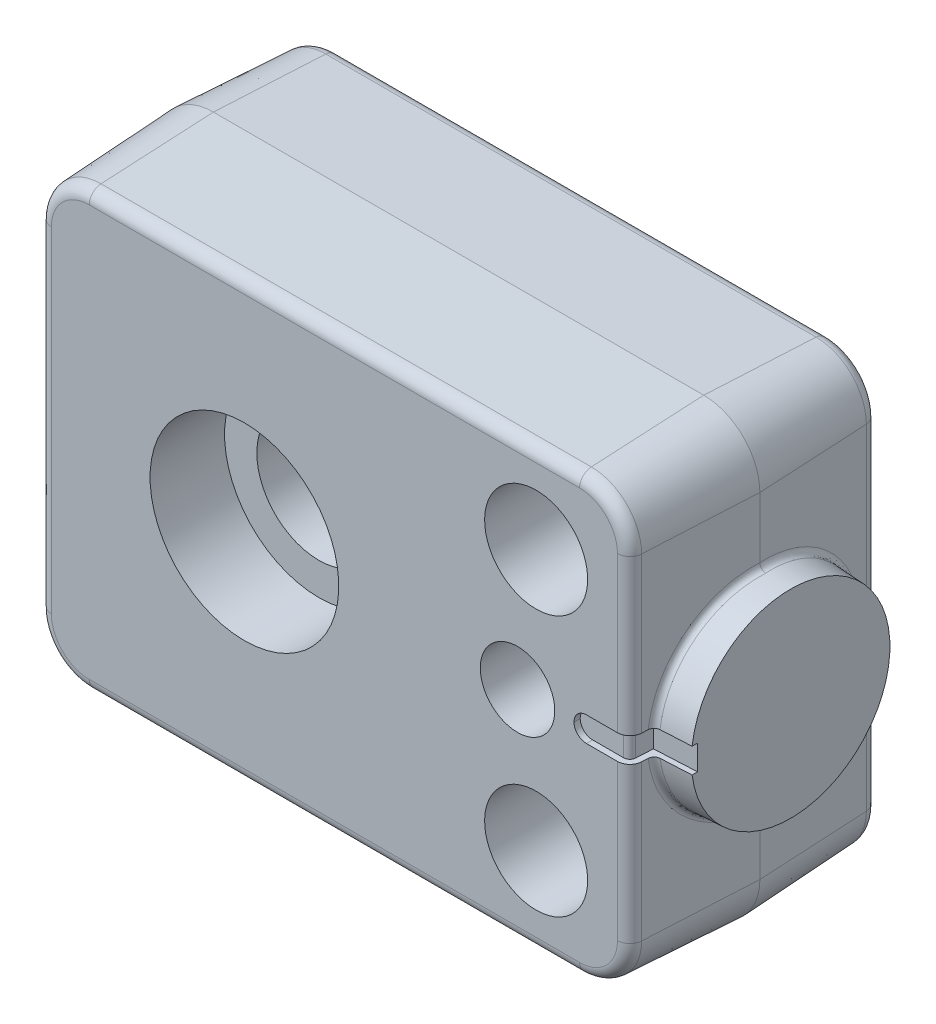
ISO-10303-21;
HEADER;
FILE_DESCRIPTION(('STEP AP214'),'2;1');
FILE_NAME('part.step','',(''),(''),'','','');
FILE_SCHEMA(('AUTOMOTIVE_DESIGN { 1 0 10303 214 1 1 1 1 }'));
ENDSEC;
DATA;
#1=APPLICATION_CONTEXT('core data for automotive mechanical design processes');
#2=APPLICATION_PROTOCOL_DEFINITION('international standard','automotive_design',2000,#1);
#3=PRODUCT_CONTEXT('',#1,'mechanical');
#4=PRODUCT('Part','Part','',(#3));
#5=PRODUCT_RELATED_PRODUCT_CATEGORY('part','',(#4));
#6=PRODUCT_DEFINITION_FORMATION('','',#4);
#7=PRODUCT_DEFINITION_CONTEXT('part definition',#1,'design');
#8=PRODUCT_DEFINITION('design','',#6,#7);
#9=PRODUCT_DEFINITION_SHAPE('','',#8);
#10=(LENGTH_UNIT() NAMED_UNIT(*) SI_UNIT(.MILLI.,.METRE.));
#11=(NAMED_UNIT(*) PLANE_ANGLE_UNIT() SI_UNIT($,.RADIAN.));
#12=(NAMED_UNIT(*) SI_UNIT($,.STERADIAN.) SOLID_ANGLE_UNIT());
#13=UNCERTAINTY_MEASURE_WITH_UNIT(LENGTH_MEASURE(1.E-05),#10,'distance_accuracy_value','');
#14=(GEOMETRIC_REPRESENTATION_CONTEXT(3) GLOBAL_UNCERTAINTY_ASSIGNED_CONTEXT((#13)) GLOBAL_UNIT_ASSIGNED_CONTEXT((#10,
#11,#12)) REPRESENTATION_CONTEXT('',''));
#15=CARTESIAN_POINT('',(0.,0.,0.));
#16=DIRECTION('',(0.,0.,1.));
#17=DIRECTION('',(1.,0.,0.));
#18=AXIS2_PLACEMENT_3D('',#15,#16,#17);
#19=CARTESIAN_POINT('',(-16.5,-17.5,0.));
#20=DIRECTION('',(0.,0.,-1.));
#21=DIRECTION('',(0.,1.,0.));
#22=AXIS2_PLACEMENT_3D('',#19,#20,#21);
#23=PLANE('',#22);
#24=CARTESIAN_POINT('',(23.5,-10.5,0.));
#25=DIRECTION('',(0.,0.,1.));
#26=DIRECTION('',(0.,-1.,0.));
#27=AXIS2_PLACEMENT_3D('',#24,#25,#26);
#28=CIRCLE('',#27,2.3);
#29=CARTESIAN_POINT('',(23.5,-12.8,0.));
#30=VERTEX_POINT('',#29);
#31=EDGE_CURVE('E306',#30,#30,#28,.T.);
#32=ORIENTED_EDGE('',*,*,#31,.T.);
#33=EDGE_LOOP('',(#32));
#34=FACE_BOUND('',#33,.T.);
#35=DIRECTION('',(1.,0.,0.));
#36=VECTOR('',#35,1.);
#37=CARTESIAN_POINT('',(-16.5,-16.5510354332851,0.));
#38=LINE('',#37,#36);
#39=CARTESIAN_POINT('',(27.,-16.5510354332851,0.));
#40=VERTEX_POINT('',#39);
#41=CARTESIAN_POINT('',(-12.5,-16.5510354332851,0.));
#42=VERTEX_POINT('',#41);
#43=EDGE_CURVE('E246',#40,#42,#38,.F.);
#44=ORIENTED_EDGE('',*,*,#43,.T.);
#45=CARTESIAN_POINT('',(-12.5,-13.5,0.));
#46=DIRECTION('',(0.,0.,-1.));
#47=DIRECTION('',(0.,1.,0.));
#48=AXIS2_PLACEMENT_3D('',#45,#46,#47);
#49=CIRCLE('',#48,3.05103543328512);
#50=CARTESIAN_POINT('',(-15.5510354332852,-13.5,0.));
#51=VERTEX_POINT('',#50);
#52=EDGE_CURVE('E285',#42,#51,#49,.T.);
#53=ORIENTED_EDGE('',*,*,#52,.T.);
#54=DIRECTION('',(0.,-1.,0.));
#55=VECTOR('',#54,1.);
#56=CARTESIAN_POINT('',(-15.5510354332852,-17.5,0.));
#57=LINE('',#56,#55);
#58=CARTESIAN_POINT('',(-15.5510354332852,13.5,0.));
#59=VERTEX_POINT('',#58);
#60=EDGE_CURVE('E283',#51,#59,#57,.F.);
#61=ORIENTED_EDGE('',*,*,#60,.T.);
#62=CARTESIAN_POINT('',(-12.5,13.5,0.));
#63=DIRECTION('',(0.,0.,-1.));
#64=DIRECTION('',(0.,1.,0.));
#65=AXIS2_PLACEMENT_3D('',#62,#63,#64);
#66=CIRCLE('',#65,3.05103543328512);
#67=CARTESIAN_POINT('',(-12.5,16.5510354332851,0.));
#68=VERTEX_POINT('',#67);
#69=EDGE_CURVE('E281',#59,#68,#66,.T.);
#70=ORIENTED_EDGE('',*,*,#69,.T.);
#71=DIRECTION('',(-1.,0.,0.));
#72=VECTOR('',#71,1.);
#73=CARTESIAN_POINT('',(-16.5,16.5510354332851,0.));
#74=LINE('',#73,#72);
#75=CARTESIAN_POINT('',(27.,16.5510354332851,0.));
#76=VERTEX_POINT('',#75);
#77=EDGE_CURVE('E279',#68,#76,#74,.F.);
#78=ORIENTED_EDGE('',*,*,#77,.T.);
#79=CARTESIAN_POINT('',(27.,13.5,0.));
#80=DIRECTION('',(0.,0.,-1.));
#81=DIRECTION('',(0.,1.,0.));
#82=AXIS2_PLACEMENT_3D('',#79,#80,#81);
#83=CIRCLE('',#82,3.05103543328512);
#84=CARTESIAN_POINT('',(30.0510354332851,13.5,0.));
#85=VERTEX_POINT('',#84);
#86=EDGE_CURVE('E277',#76,#85,#83,.T.);
#87=ORIENTED_EDGE('',*,*,#86,.T.);
#88=DIRECTION('',(0.,1.,0.));
#89=VECTOR('',#88,1.);
#90=CARTESIAN_POINT('',(30.0510354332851,-17.5,0.));
#91=LINE('',#90,#89);
#92=CARTESIAN_POINT('',(30.0510354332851,-13.5,0.));
#93=VERTEX_POINT('',#92);
#94=EDGE_CURVE('E249',#85,#93,#91,.F.);
#95=ORIENTED_EDGE('',*,*,#94,.T.);
#96=CARTESIAN_POINT('',(27.,-13.5,0.));
#97=DIRECTION('',(0.,0.,-1.));
#98=DIRECTION('',(0.,1.,0.));
#99=AXIS2_PLACEMENT_3D('',#96,#97,#98);
#100=CIRCLE('',#99,3.05103543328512);
#101=EDGE_CURVE('E241',#93,#40,#100,.T.);
#102=ORIENTED_EDGE('',*,*,#101,.T.);
#103=EDGE_LOOP('',(#44,#53,#61,#70,#78,#87,#95,#102));
#104=FACE_BOUND('',#103,.T.);
#105=CARTESIAN_POINT('',(23.5,10.5,0.));
#106=DIRECTION('',(0.,0.,1.));
#107=DIRECTION('',(0.,-1.,0.));
#108=AXIS2_PLACEMENT_3D('',#105,#106,#107);
#109=CIRCLE('',#108,2.3);
#110=CARTESIAN_POINT('',(23.5,8.2,0.));
#111=VERTEX_POINT('',#110);
#112=EDGE_CURVE('E843',#111,#111,#109,.T.);
#113=ORIENTED_EDGE('',*,*,#112,.T.);
#114=EDGE_LOOP('',(#113));
#115=FACE_BOUND('',#114,.T.);
#116=CARTESIAN_POINT('',(0.,0.,0.));
#117=DIRECTION('',(0.,0.,1.));
#118=DIRECTION('',(0.,-1.,0.));
#119=AXIS2_PLACEMENT_3D('',#116,#117,#118);
#120=CIRCLE('',#119,7.6);
#121=CARTESIAN_POINT('',(0.,-7.6,0.));
#122=VERTEX_POINT('',#121);
#123=EDGE_CURVE('E862',#122,#122,#120,.T.);
#124=ORIENTED_EDGE('',*,*,#123,.T.);
#125=EDGE_LOOP('',(#124));
#126=FACE_BOUND('',#125,.T.);
#127=ADVANCED_FACE('F16',(#34,#104,#115,#126),#23,.T.);
#128=CARTESIAN_POINT('',(27.55,0.,12.4957615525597));
#129=DIRECTION('',(0.,0.,1.));
#130=DIRECTION('',(0.,-1.,0.));
#131=AXIS2_PLACEMENT_3D('',#128,#129,#130);
#132=CYLINDRICAL_SURFACE('',#131,1.);
#133=DIRECTION('',(0.,0.,1.));
#134=VECTOR('',#133,1.);
#135=CARTESIAN_POINT('',(27.55,1.,12.4957615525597));
#136=LINE('',#135,#134);
#137=CARTESIAN_POINT('',(27.55,1.,20.));
#138=VERTEX_POINT('',#137);
#139=CARTESIAN_POINT('',(27.55,1.,19.5));
#140=VERTEX_POINT('',#139);
#141=EDGE_CURVE('E705',#138,#140,#136,.F.);
#142=ORIENTED_EDGE('',*,*,#141,.F.);
#143=CARTESIAN_POINT('',(27.55,0.,20.));
#144=DIRECTION('',(0.,0.,-1.));
#145=DIRECTION('',(0.,1.,0.));
#146=AXIS2_PLACEMENT_3D('',#143,#144,#145);
#147=CIRCLE('',#146,1.);
#148=CARTESIAN_POINT('',(26.55,0.,20.));
#149=VERTEX_POINT('',#148);
#150=EDGE_CURVE('E550',#138,#149,#147,.F.);
#151=ORIENTED_EDGE('',*,*,#150,.T.);
#152=DIRECTION('',(0.,0.,1.));
#153=VECTOR('',#152,1.);
#154=CARTESIAN_POINT('',(26.55,0.,12.4957615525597));
#155=LINE('',#154,#153);
#156=CARTESIAN_POINT('',(26.55,0.,19.5));
#157=VERTEX_POINT('',#156);
#158=EDGE_CURVE('E698',#149,#157,#155,.F.);
#159=ORIENTED_EDGE('',*,*,#158,.T.);
#160=CARTESIAN_POINT('',(27.55,0.,19.5));
#161=DIRECTION('',(0.,0.,1.));
#162=DIRECTION('',(-1.,0.,0.));
#163=AXIS2_PLACEMENT_3D('',#160,#161,#162);
#164=CIRCLE('',#163,1.);
#165=EDGE_CURVE('E707',#140,#157,#164,.T.);
#166=ORIENTED_EDGE('',*,*,#165,.F.);
#167=EDGE_LOOP('',(#142,#151,#159,#166));
#168=FACE_BOUND('',#167,.T.);
#169=ADVANCED_FACE('F493',(#168),#132,.F.);
#170=CARTESIAN_POINT('',(27.55,0.,12.4957615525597));
#171=DIRECTION('',(0.,0.,-1.));
#172=DIRECTION('',(0.,1.,0.));
#173=AXIS2_PLACEMENT_3D('',#170,#171,#172);
#174=CYLINDRICAL_SURFACE('',#173,1.);
#175=DIRECTION('',(0.,0.,1.));
#176=VECTOR('',#175,1.);
#177=CARTESIAN_POINT('',(27.55,-1.,12.4957615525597));
#178=LINE('',#177,#176);
#179=CARTESIAN_POINT('',(27.55,-1.,19.5));
#180=VERTEX_POINT('',#179);
#181=CARTESIAN_POINT('',(27.55,-1.,20.));
#182=VERTEX_POINT('',#181);
#183=EDGE_CURVE('E695',#180,#182,#178,.T.);
#184=ORIENTED_EDGE('',*,*,#183,.F.);
#185=CARTESIAN_POINT('',(27.55,0.,19.5));
#186=DIRECTION('',(0.,0.,1.));
#187=DIRECTION('',(-1.,0.,0.));
#188=AXIS2_PLACEMENT_3D('',#185,#186,#187);
#189=CIRCLE('',#188,1.);
#190=EDGE_CURVE('E701',#157,#180,#189,.T.);
#191=ORIENTED_EDGE('',*,*,#190,.F.);
#192=ORIENTED_EDGE('',*,*,#158,.F.);
#193=CARTESIAN_POINT('',(27.55,0.,20.));
#194=DIRECTION('',(0.,0.,-1.));
#195=DIRECTION('',(0.,1.,0.));
#196=AXIS2_PLACEMENT_3D('',#193,#194,#195);
#197=CIRCLE('',#196,1.);
#198=EDGE_CURVE('E703',#149,#182,#197,.F.);
#199=ORIENTED_EDGE('',*,*,#198,.T.);
#200=EDGE_LOOP('',(#184,#191,#192,#199));
#201=FACE_BOUND('',#200,.T.);
#202=ADVANCED_FACE('F500',(#201),#174,.F.);
#203=CARTESIAN_POINT('',(31.,17.5,20.));
#204=DIRECTION('',(0.998629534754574,0.,0.052335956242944));
#205=DIRECTION('',(-0.052335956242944,0.,0.998629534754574));
#206=AXIS2_PLACEMENT_3D('',#203,#204,#205);
#207=PLANE('',#206);
#208=DIRECTION('',(-0.0523359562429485,0.,0.998629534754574));
#209=VECTOR('',#208,1.);
#210=CARTESIAN_POINT('',(31.3902174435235,1.,12.5542076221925));
#211=LINE('',#210,#209);
#212=CARTESIAN_POINT('',(31.0763358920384,1.,18.5434244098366));
#213=VERTEX_POINT('',#212);
#214=CARTESIAN_POINT('',(31.0496649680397,1.,19.0523359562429));
#215=VERTEX_POINT('',#214);
#216=EDGE_CURVE('E375',#213,#215,#211,.T.);
#217=ORIENTED_EDGE('',*,*,#216,.F.);
#218=CARTESIAN_POINT('',(31.5242106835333,0.,9.99746429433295));
#219=DIRECTION('',(0.998629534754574,0.,0.052335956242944));
#220=DIRECTION('',(-0.0523359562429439,0.,0.998629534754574));
#221=AXIS2_PLACEMENT_3D('',#218,#219,#220);
#222=ELLIPSE('',#221,8.61607684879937,8.60423636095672);
#223=CARTESIAN_POINT('',(31.5240777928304,8.60423598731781,10.));
#224=VERTEX_POINT('',#223);
#225=EDGE_CURVE('E537',#213,#224,#222,.F.);
#226=ORIENTED_EDGE('',*,*,#225,.T.);
#227=DIRECTION('',(0.,1.,0.));
#228=VECTOR('',#227,1.);
#229=CARTESIAN_POINT('',(31.5240777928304,17.5,10.));
#230=LINE('',#229,#228);
#231=CARTESIAN_POINT('',(31.5240777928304,13.5,10.));
#232=VERTEX_POINT('',#231);
#233=EDGE_CURVE('E527',#224,#232,#230,.T.);
#234=ORIENTED_EDGE('',*,*,#233,.T.);
#235=DIRECTION('',(0.0523359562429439,0.,-0.998629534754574));
#236=VECTOR('',#235,1.);
#237=CARTESIAN_POINT('',(31.,13.5,20.));
#238=LINE('',#237,#236);
#239=CARTESIAN_POINT('',(31.0496649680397,13.5,19.0523359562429));
#240=VERTEX_POINT('',#239);
#241=EDGE_CURVE('E637',#232,#240,#238,.F.);
#242=ORIENTED_EDGE('',*,*,#241,.T.);
#243=DIRECTION('',(0.,1.,0.));
#244=VECTOR('',#243,1.);
#245=CARTESIAN_POINT('',(31.0496649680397,17.5,19.0523359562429));
#246=LINE('',#245,#244);
#247=EDGE_CURVE('E666',#240,#215,#246,.F.);
#248=ORIENTED_EDGE('',*,*,#247,.T.);
#249=EDGE_LOOP('',(#217,#226,#234,#242,#248));
#250=FACE_BOUND('',#249,.T.);
#251=ADVANCED_FACE('F463',(#250),#207,.T.);
#252=CARTESIAN_POINT('',(-16.5,-17.5,20.));
#253=DIRECTION('',(0.,0.,-1.));
#254=DIRECTION('',(0.,1.,0.));
#255=AXIS2_PLACEMENT_3D('',#252,#253,#254);
#256=PLANE('',#255);
#257=CARTESIAN_POINT('',(22.,0.,20.));
#258=DIRECTION('',(0.,0.,1.));
#259=DIRECTION('',(0.,-1.,0.));
#260=AXIS2_PLACEMENT_3D('',#257,#258,#259);
#261=CIRCLE('',#260,3.);
#262=CARTESIAN_POINT('',(22.,-3.,20.));
#263=VERTEX_POINT('',#262);
#264=EDGE_CURVE('E868',#263,#263,#261,.T.);
#265=ORIENTED_EDGE('',*,*,#264,.F.);
#266=EDGE_LOOP('',(#265));
#267=FACE_BOUND('',#266,.T.);
#268=CARTESIAN_POINT('',(0.,0.,20.));
#269=DIRECTION('',(0.,0.,1.));
#270=DIRECTION('',(0.,-1.,0.));
#271=AXIS2_PLACEMENT_3D('',#268,#269,#270);
#272=CIRCLE('',#271,7.6);
#273=CARTESIAN_POINT('',(0.,-7.6,20.));
#274=VERTEX_POINT('',#273);
#275=EDGE_CURVE('E856',#274,#274,#272,.T.);
#276=ORIENTED_EDGE('',*,*,#275,.F.);
#277=EDGE_LOOP('',(#276));
#278=FACE_BOUND('',#277,.T.);
#279=CARTESIAN_POINT('',(23.5,10.5,20.));
#280=DIRECTION('',(0.,0.,1.));
#281=DIRECTION('',(0.,-1.,0.));
#282=AXIS2_PLACEMENT_3D('',#279,#280,#281);
#283=CIRCLE('',#282,4.15);
#284=CARTESIAN_POINT('',(23.5,6.35,20.));
#285=VERTEX_POINT('',#284);
#286=EDGE_CURVE('E852',#285,#285,#283,.T.);
#287=ORIENTED_EDGE('',*,*,#286,.F.);
#288=EDGE_LOOP('',(#287));
#289=FACE_BOUND('',#288,.T.);
#290=CARTESIAN_POINT('',(23.5,-10.5,20.));
#291=DIRECTION('',(0.,0.,1.));
#292=DIRECTION('',(0.,-1.,0.));
#293=AXIS2_PLACEMENT_3D('',#290,#291,#292);
#294=CIRCLE('',#293,4.15);
#295=CARTESIAN_POINT('',(23.5,-14.65,20.));
#296=VERTEX_POINT('',#295);
#297=EDGE_CURVE('E840',#296,#296,#294,.T.);
#298=ORIENTED_EDGE('',*,*,#297,.F.);
#299=EDGE_LOOP('',(#298));
#300=FACE_BOUND('',#299,.T.);
#301=DIRECTION('',(-1.,0.,0.));
#302=VECTOR('',#301,1.);
#303=CARTESIAN_POINT('',(30.275,1.,20.));
#304=LINE('',#303,#302);
#305=CARTESIAN_POINT('',(30.0510354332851,1.,20.));
#306=VERTEX_POINT('',#305);
#307=EDGE_CURVE('E379',#306,#138,#304,.T.);
#308=ORIENTED_EDGE('',*,*,#307,.F.);
#309=DIRECTION('',(0.,-1.,0.));
#310=VECTOR('',#309,1.);
#311=CARTESIAN_POINT('',(30.0510354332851,-17.5,20.));
#312=LINE('',#311,#310);
#313=CARTESIAN_POINT('',(30.0510354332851,13.5,20.));
#314=VERTEX_POINT('',#313);
#315=EDGE_CURVE('E647',#306,#314,#312,.F.);
#316=ORIENTED_EDGE('',*,*,#315,.T.);
#317=CARTESIAN_POINT('',(27.,13.5,20.));
#318=DIRECTION('',(0.,0.,-1.));
#319=DIRECTION('',(0.,1.,0.));
#320=AXIS2_PLACEMENT_3D('',#317,#318,#319);
#321=CIRCLE('',#320,3.05103543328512);
#322=CARTESIAN_POINT('',(27.,16.5510354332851,20.));
#323=VERTEX_POINT('',#322);
#324=EDGE_CURVE('E651',#314,#323,#321,.F.);
#325=ORIENTED_EDGE('',*,*,#324,.T.);
#326=DIRECTION('',(1.,0.,0.));
#327=VECTOR('',#326,1.);
#328=CARTESIAN_POINT('',(-16.5,16.5510354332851,20.));
#329=LINE('',#328,#327);
#330=CARTESIAN_POINT('',(-12.5,16.5510354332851,20.));
#331=VERTEX_POINT('',#330);
#332=EDGE_CURVE('E653',#323,#331,#329,.F.);
#333=ORIENTED_EDGE('',*,*,#332,.T.);
#334=CARTESIAN_POINT('',(-12.5,13.5,20.));
#335=DIRECTION('',(0.,0.,-1.));
#336=DIRECTION('',(0.,1.,0.));
#337=AXIS2_PLACEMENT_3D('',#334,#335,#336);
#338=CIRCLE('',#337,3.05103543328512);
#339=CARTESIAN_POINT('',(-15.5510354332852,13.5,20.));
#340=VERTEX_POINT('',#339);
#341=EDGE_CURVE('E655',#331,#340,#338,.F.);
#342=ORIENTED_EDGE('',*,*,#341,.T.);
#343=DIRECTION('',(0.,1.,0.));
#344=VECTOR('',#343,1.);
#345=CARTESIAN_POINT('',(-15.5510354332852,-17.5,20.));
#346=LINE('',#345,#344);
#347=CARTESIAN_POINT('',(-15.5510354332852,-13.5,20.));
#348=VERTEX_POINT('',#347);
#349=EDGE_CURVE('E657',#340,#348,#346,.F.);
#350=ORIENTED_EDGE('',*,*,#349,.T.);
#351=CARTESIAN_POINT('',(-12.5,-13.5,20.));
#352=DIRECTION('',(0.,0.,-1.));
#353=DIRECTION('',(0.,1.,0.));
#354=AXIS2_PLACEMENT_3D('',#351,#352,#353);
#355=CIRCLE('',#354,3.05103543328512);
#356=CARTESIAN_POINT('',(-12.5,-16.5510354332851,20.));
#357=VERTEX_POINT('',#356);
#358=EDGE_CURVE('E602',#348,#357,#355,.F.);
#359=ORIENTED_EDGE('',*,*,#358,.T.);
#360=DIRECTION('',(-1.,0.,0.));
#361=VECTOR('',#360,1.);
#362=CARTESIAN_POINT('',(-16.5,-16.5510354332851,20.));
#363=LINE('',#362,#361);
#364=CARTESIAN_POINT('',(27.,-16.5510354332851,20.));
#365=VERTEX_POINT('',#364);
#366=EDGE_CURVE('E643',#357,#365,#363,.F.);
#367=ORIENTED_EDGE('',*,*,#366,.T.);
#368=CARTESIAN_POINT('',(27.,-13.5,20.));
#369=DIRECTION('',(0.,0.,-1.));
#370=DIRECTION('',(0.,1.,0.));
#371=AXIS2_PLACEMENT_3D('',#368,#369,#370);
#372=CIRCLE('',#371,3.05103543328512);
#373=CARTESIAN_POINT('',(30.0510354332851,-13.5,20.));
#374=VERTEX_POINT('',#373);
#375=EDGE_CURVE('E645',#365,#374,#372,.F.);
#376=ORIENTED_EDGE('',*,*,#375,.T.);
#377=CARTESIAN_POINT('',(30.0510354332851,-1.,20.));
#378=VERTEX_POINT('',#377);
#379=EDGE_CURVE('E648',#374,#378,#312,.F.);
#380=ORIENTED_EDGE('',*,*,#379,.T.);
#381=DIRECTION('',(-1.,0.,0.));
#382=VECTOR('',#381,1.);
#383=CARTESIAN_POINT('',(30.275,-1.,20.));
#384=LINE('',#383,#382);
#385=EDGE_CURVE('E396',#378,#182,#384,.T.);
#386=ORIENTED_EDGE('',*,*,#385,.T.);
#387=ORIENTED_EDGE('',*,*,#198,.F.);
#388=ORIENTED_EDGE('',*,*,#150,.F.);
#389=EDGE_LOOP('',(#308,#316,#325,#333,#342,#350,#359,#367,#376,#380,#386,#387,#388));
#390=FACE_BOUND('',#389,.T.);
#391=ADVANCED_FACE('F715',(#267,#278,#289,#300,#390),#256,.F.);
#392=CARTESIAN_POINT('',(30.0510354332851,-17.5,19.));
#393=DIRECTION('',(0.,-1.,0.));
#394=DIRECTION('',(0.,0.,-1.));
#395=AXIS2_PLACEMENT_3D('',#392,#393,#394);
#396=CYLINDRICAL_SURFACE('',#395,1.);
#397=ORIENTED_EDGE('',*,*,#315,.F.);
#398=CARTESIAN_POINT('',(30.0510354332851,1.,19.));
#399=DIRECTION('',(0.,-1.,0.));
#400=DIRECTION('',(0.,0.,-1.));
#401=AXIS2_PLACEMENT_3D('',#398,#399,#400);
#402=CIRCLE('',#401,1.);
#403=EDGE_CURVE('E377',#215,#306,#402,.T.);
#404=ORIENTED_EDGE('',*,*,#403,.F.);
#405=ORIENTED_EDGE('',*,*,#247,.F.);
#406=CARTESIAN_POINT('',(30.0510354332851,13.5,19.));
#407=DIRECTION('',(0.,-1.,0.));
#408=DIRECTION('',(0.,0.,-1.));
#409=AXIS2_PLACEMENT_3D('',#406,#407,#408);
#410=CIRCLE('',#409,1.);
#411=EDGE_CURVE('E685',#240,#314,#410,.T.);
#412=ORIENTED_EDGE('',*,*,#411,.T.);
#413=EDGE_LOOP('',(#397,#404,#405,#412));
#414=FACE_BOUND('',#413,.T.);
#415=ADVANCED_FACE('F570',(#414),#396,.T.);
#416=CARTESIAN_POINT('',(34.,3.13139604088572,10.));
#417=DIRECTION('',(-1.,0.,0.));
#418=DIRECTION('',(0.,0.,-1.));
#419=AXIS2_PLACEMENT_3D('',#416,#417,#418);
#420=PLANE('',#419);
#421=DIRECTION('',(0.,0.,1.));
#422=VECTOR('',#421,1.);
#423=CARTESIAN_POINT('',(34.,1.,10.));
#424=LINE('',#423,#422);
#425=CARTESIAN_POINT('',(34.,1.,17.499313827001));
#426=VERTEX_POINT('',#425);
#427=CARTESIAN_POINT('',(34.,1.,17.9372539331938));
#428=VERTEX_POINT('',#427);
#429=EDGE_CURVE('E692',#426,#428,#424,.T.);
#430=ORIENTED_EDGE('',*,*,#429,.F.);
#431=DIRECTION('',(0.,-1.,0.));
#432=VECTOR('',#431,1.);
#433=CARTESIAN_POINT('',(34.,1.,17.499313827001));
#434=LINE('',#433,#432);
#435=CARTESIAN_POINT('',(34.,-1.,17.499313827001));
#436=VERTEX_POINT('',#435);
#437=EDGE_CURVE('E405',#426,#436,#434,.T.);
#438=ORIENTED_EDGE('',*,*,#437,.T.);
#439=DIRECTION('',(0.,0.,1.));
#440=VECTOR('',#439,1.);
#441=CARTESIAN_POINT('',(34.,-1.,10.));
#442=LINE('',#441,#440);
#443=CARTESIAN_POINT('',(34.,-1.,17.9372539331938));
#444=VERTEX_POINT('',#443);
#445=EDGE_CURVE('E673',#436,#444,#442,.T.);
#446=ORIENTED_EDGE('',*,*,#445,.T.);
#447=CARTESIAN_POINT('',(34.,0.,10.));
#448=DIRECTION('',(-1.,0.,0.));
#449=DIRECTION('',(0.,0.,-1.));
#450=AXIS2_PLACEMENT_3D('',#447,#448,#449);
#451=CIRCLE('',#450,8.);
#452=EDGE_CURVE('E624',#428,#444,#451,.T.);
#453=ORIENTED_EDGE('',*,*,#452,.F.);
#454=EDGE_LOOP('',(#430,#438,#446,#453));
#455=FACE_BOUND('',#454,.T.);
#456=ADVANCED_FACE('F462',(#455),#420,.F.);
#457=CARTESIAN_POINT('',(31.5240777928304,-13.5,10.));
#458=VERTEX_POINT('',#457);
#459=CARTESIAN_POINT('',(31.5240777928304,-8.60423598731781,10.));
#460=VERTEX_POINT('',#459);
#461=EDGE_CURVE('E524',#458,#460,#230,.T.);
#462=ORIENTED_EDGE('',*,*,#461,.T.);
#463=CARTESIAN_POINT('',(31.5242106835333,0.,9.99746429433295));
#464=DIRECTION('',(0.998629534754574,0.,0.052335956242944));
#465=DIRECTION('',(-0.0523359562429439,0.,0.998629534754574));
#466=AXIS2_PLACEMENT_3D('',#463,#464,#465);
#467=ELLIPSE('',#466,8.61607684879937,8.60423636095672);
#468=CARTESIAN_POINT('',(31.0763358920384,-1.,18.5434244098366));
#469=VERTEX_POINT('',#468);
#470=EDGE_CURVE('E36',#460,#469,#467,.F.);
#471=ORIENTED_EDGE('',*,*,#470,.T.);
#472=DIRECTION('',(0.052335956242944,0.,-0.998629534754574));
#473=VECTOR('',#472,1.);
#474=CARTESIAN_POINT('',(31.,-1.,20.));
#475=LINE('',#474,#473);
#476=CARTESIAN_POINT('',(31.0496649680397,-1.,19.0523359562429));
#477=VERTEX_POINT('',#476);
#478=EDGE_CURVE('E419',#469,#477,#475,.F.);
#479=ORIENTED_EDGE('',*,*,#478,.T.);
#480=CARTESIAN_POINT('',(31.0496649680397,-13.5,19.0523359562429));
#481=VERTEX_POINT('',#480);
#482=EDGE_CURVE('E665',#477,#481,#246,.F.);
#483=ORIENTED_EDGE('',*,*,#482,.T.);
#484=DIRECTION('',(0.0523359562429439,0.,-0.998629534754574));
#485=VECTOR('',#484,1.);
#486=CARTESIAN_POINT('',(31.,-13.5,20.));
#487=LINE('',#486,#485);
#488=EDGE_CURVE('E640',#481,#458,#487,.T.);
#489=ORIENTED_EDGE('',*,*,#488,.T.);
#490=EDGE_LOOP('',(#462,#471,#479,#483,#489));
#491=FACE_BOUND('',#490,.T.);
#492=ADVANCED_FACE('F456',(#491),#207,.T.);
#493=CARTESIAN_POINT('',(31.,-17.5,20.));
#494=DIRECTION('',(0.,-0.998629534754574,0.052335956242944));
#495=DIRECTION('',(0.,-0.052335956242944,-0.998629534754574));
#496=AXIS2_PLACEMENT_3D('',#493,#494,#495);
#497=PLANE('',#496);
#498=DIRECTION('',(0.,-0.0523359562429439,-0.998629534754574));
#499=VECTOR('',#498,1.);
#500=CARTESIAN_POINT('',(27.,-17.5,20.));
#501=LINE('',#500,#499);
#502=CARTESIAN_POINT('',(27.,-18.0240777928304,10.));
#503=VERTEX_POINT('',#502);
#504=CARTESIAN_POINT('',(27.,-17.5496649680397,19.0523359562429));
#505=VERTEX_POINT('',#504);
#506=EDGE_CURVE('E636',#503,#505,#501,.F.);
#507=ORIENTED_EDGE('',*,*,#506,.T.);
#508=DIRECTION('',(1.,0.,0.));
#509=VECTOR('',#508,1.);
#510=CARTESIAN_POINT('',(31.,-17.5496649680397,19.0523359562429));
#511=LINE('',#510,#509);
#512=CARTESIAN_POINT('',(-12.5,-17.5496649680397,19.0523359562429));
#513=VERTEX_POINT('',#512);
#514=EDGE_CURVE('E671',#505,#513,#511,.F.);
#515=ORIENTED_EDGE('',*,*,#514,.T.);
#516=DIRECTION('',(0.,-0.0523359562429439,-0.998629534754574));
#517=VECTOR('',#516,1.);
#518=CARTESIAN_POINT('',(-12.5,-17.5,20.));
#519=LINE('',#518,#517);
#520=CARTESIAN_POINT('',(-12.5,-18.0240777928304,10.));
#521=VERTEX_POINT('',#520);
#522=EDGE_CURVE('E619',#513,#521,#519,.T.);
#523=ORIENTED_EDGE('',*,*,#522,.T.);
#524=DIRECTION('',(1.,0.,0.));
#525=VECTOR('',#524,1.);
#526=CARTESIAN_POINT('',(31.,-18.0240777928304,10.));
#527=LINE('',#526,#525);
#528=EDGE_CURVE('E320',#521,#503,#527,.T.);
#529=ORIENTED_EDGE('',*,*,#528,.T.);
#530=EDGE_LOOP('',(#507,#515,#523,#529));
#531=FACE_BOUND('',#530,.T.);
#532=ADVANCED_FACE('F461',(#531),#497,.T.);
#533=CARTESIAN_POINT('',(31.,17.5,20.));
#534=DIRECTION('',(0.,0.998629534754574,0.052335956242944));
#535=DIRECTION('',(0.,-0.052335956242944,0.998629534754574));
#536=AXIS2_PLACEMENT_3D('',#533,#534,#535);
#537=PLANE('',#536);
#538=DIRECTION('',(0.,0.0523359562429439,-0.998629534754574));
#539=VECTOR('',#538,1.);
#540=CARTESIAN_POINT('',(-12.5,17.5,20.));
#541=LINE('',#540,#539);
#542=CARTESIAN_POINT('',(-12.5,18.0240777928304,10.));
#543=VERTEX_POINT('',#542);
#544=CARTESIAN_POINT('',(-12.5,17.5496649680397,19.0523359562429));
#545=VERTEX_POINT('',#544);
#546=EDGE_CURVE('E633',#543,#545,#541,.F.);
#547=ORIENTED_EDGE('',*,*,#546,.T.);
#548=DIRECTION('',(-1.,0.,0.));
#549=VECTOR('',#548,1.);
#550=CARTESIAN_POINT('',(31.,17.5496649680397,19.0523359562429));
#551=LINE('',#550,#549);
#552=CARTESIAN_POINT('',(27.,17.5496649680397,19.0523359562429));
#553=VERTEX_POINT('',#552);
#554=EDGE_CURVE('E661',#545,#553,#551,.F.);
#555=ORIENTED_EDGE('',*,*,#554,.T.);
#556=DIRECTION('',(0.,0.0523359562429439,-0.998629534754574));
#557=VECTOR('',#556,1.);
#558=CARTESIAN_POINT('',(27.,17.5,20.));
#559=LINE('',#558,#557);
#560=CARTESIAN_POINT('',(27.,18.0240777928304,10.));
#561=VERTEX_POINT('',#560);
#562=EDGE_CURVE('E626',#553,#561,#559,.T.);
#563=ORIENTED_EDGE('',*,*,#562,.T.);
#564=DIRECTION('',(-1.,0.,0.));
#565=VECTOR('',#564,1.);
#566=CARTESIAN_POINT('',(31.,18.0240777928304,10.));
#567=LINE('',#566,#565);
#568=EDGE_CURVE('E775',#561,#543,#567,.T.);
#569=ORIENTED_EDGE('',*,*,#568,.T.);
#570=EDGE_LOOP('',(#547,#555,#563,#569));
#571=FACE_BOUND('',#570,.T.);
#572=ADVANCED_FACE('F465',(#571),#537,.T.);
#573=CARTESIAN_POINT('',(-16.5,-17.5,20.));
#574=DIRECTION('',(-0.998629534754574,0.,0.052335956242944));
#575=DIRECTION('',(-0.052335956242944,0.,-0.998629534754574));
#576=AXIS2_PLACEMENT_3D('',#573,#574,#575);
#577=PLANE('',#576);
#578=DIRECTION('',(-0.0523359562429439,0.,-0.998629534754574));
#579=VECTOR('',#578,1.);
#580=CARTESIAN_POINT('',(-16.5,-13.5,20.));
#581=LINE('',#580,#579);
#582=CARTESIAN_POINT('',(-17.0240777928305,-13.5,10.));
#583=VERTEX_POINT('',#582);
#584=CARTESIAN_POINT('',(-16.5496649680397,-13.5,19.0523359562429));
#585=VERTEX_POINT('',#584);
#586=EDGE_CURVE('E617',#583,#585,#581,.F.);
#587=ORIENTED_EDGE('',*,*,#586,.T.);
#588=DIRECTION('',(0.,-1.,0.));
#589=VECTOR('',#588,1.);
#590=CARTESIAN_POINT('',(-16.5496649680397,-17.5,19.0523359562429));
#591=LINE('',#590,#589);
#592=CARTESIAN_POINT('',(-16.5496649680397,13.5,19.0523359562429));
#593=VERTEX_POINT('',#592);
#594=EDGE_CURVE('E608',#585,#593,#591,.F.);
#595=ORIENTED_EDGE('',*,*,#594,.T.);
#596=DIRECTION('',(-0.0523359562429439,0.,-0.998629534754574));
#597=VECTOR('',#596,1.);
#598=CARTESIAN_POINT('',(-16.5,13.5,20.));
#599=LINE('',#598,#597);
#600=CARTESIAN_POINT('',(-17.0240777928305,13.5,10.));
#601=VERTEX_POINT('',#600);
#602=EDGE_CURVE('E623',#593,#601,#599,.T.);
#603=ORIENTED_EDGE('',*,*,#602,.T.);
#604=DIRECTION('',(0.,-1.,0.));
#605=VECTOR('',#604,1.);
#606=CARTESIAN_POINT('',(-17.0240777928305,-17.5,10.));
#607=LINE('',#606,#605);
#608=EDGE_CURVE('E622',#601,#583,#607,.T.);
#609=ORIENTED_EDGE('',*,*,#608,.T.);
#610=EDGE_LOOP('',(#587,#595,#603,#609));
#611=FACE_BOUND('',#610,.T.);
#612=ADVANCED_FACE('F469',(#611),#577,.T.);
#613=CARTESIAN_POINT('',(-12.5,13.5,20.));
#614=DIRECTION('',(0.,0.,-1.));
#615=DIRECTION('',(0.,1.,0.));
#616=AXIS2_PLACEMENT_3D('',#613,#614,#615);
#617=CONICAL_SURFACE('',#616,4.,0.05235987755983);
#618=ORIENTED_EDGE('',*,*,#602,.F.);
#619=CARTESIAN_POINT('',(-12.5,13.5,19.0523359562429));
#620=DIRECTION('',(0.,0.,-1.));
#621=DIRECTION('',(0.,1.,0.));
#622=AXIS2_PLACEMENT_3D('',#619,#620,#621);
#623=CIRCLE('',#622,4.04966496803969);
#624=EDGE_CURVE('E612',#593,#545,#623,.T.);
#625=ORIENTED_EDGE('',*,*,#624,.T.);
#626=ORIENTED_EDGE('',*,*,#546,.F.);
#627=CARTESIAN_POINT('',(-12.5,13.5,10.));
#628=DIRECTION('',(0.,0.,-1.));
#629=DIRECTION('',(0.,1.,0.));
#630=AXIS2_PLACEMENT_3D('',#627,#628,#629);
#631=CIRCLE('',#630,4.52407779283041);
#632=EDGE_CURVE('E778',#543,#601,#631,.F.);
#633=ORIENTED_EDGE('',*,*,#632,.T.);
#634=EDGE_LOOP('',(#618,#625,#626,#633));
#635=FACE_BOUND('',#634,.T.);
#636=ADVANCED_FACE('F475',(#635),#617,.T.);
#637=CARTESIAN_POINT('',(-12.5,-13.5,20.));
#638=DIRECTION('',(0.,0.,-1.));
#639=DIRECTION('',(0.,1.,0.));
#640=AXIS2_PLACEMENT_3D('',#637,#638,#639);
#641=CONICAL_SURFACE('',#640,4.,0.05235987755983);
#642=ORIENTED_EDGE('',*,*,#522,.F.);
#643=CARTESIAN_POINT('',(-12.5,-13.5,19.0523359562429));
#644=DIRECTION('',(0.,0.,-1.));
#645=DIRECTION('',(0.,1.,0.));
#646=AXIS2_PLACEMENT_3D('',#643,#644,#645);
#647=CIRCLE('',#646,4.04966496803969);
#648=EDGE_CURVE('E599',#513,#585,#647,.T.);
#649=ORIENTED_EDGE('',*,*,#648,.T.);
#650=ORIENTED_EDGE('',*,*,#586,.F.);
#651=CARTESIAN_POINT('',(-12.5,-13.5,10.));
#652=DIRECTION('',(0.,0.,-1.));
#653=DIRECTION('',(0.,1.,0.));
#654=AXIS2_PLACEMENT_3D('',#651,#652,#653);
#655=CIRCLE('',#654,4.52407779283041);
#656=EDGE_CURVE('E764',#583,#521,#655,.F.);
#657=ORIENTED_EDGE('',*,*,#656,.T.);
#658=EDGE_LOOP('',(#642,#649,#650,#657));
#659=FACE_BOUND('',#658,.T.);
#660=ADVANCED_FACE('F471',(#659),#641,.T.);
#661=CARTESIAN_POINT('',(27.,-13.5,20.));
#662=DIRECTION('',(0.,0.,-1.));
#663=DIRECTION('',(0.,1.,0.));
#664=AXIS2_PLACEMENT_3D('',#661,#662,#663);
#665=CONICAL_SURFACE('',#664,4.,0.05235987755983);
#666=ORIENTED_EDGE('',*,*,#488,.F.);
#667=CARTESIAN_POINT('',(27.,-13.5,19.0523359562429));
#668=DIRECTION('',(0.,0.,-1.));
#669=DIRECTION('',(0.,1.,0.));
#670=AXIS2_PLACEMENT_3D('',#667,#668,#669);
#671=CIRCLE('',#670,4.04966496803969);
#672=EDGE_CURVE('E669',#481,#505,#671,.T.);
#673=ORIENTED_EDGE('',*,*,#672,.T.);
#674=ORIENTED_EDGE('',*,*,#506,.F.);
#675=CARTESIAN_POINT('',(27.,-13.5,10.));
#676=DIRECTION('',(0.,0.,-1.));
#677=DIRECTION('',(0.,1.,0.));
#678=AXIS2_PLACEMENT_3D('',#675,#676,#677);
#679=CIRCLE('',#678,4.52407779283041);
#680=EDGE_CURVE('E755',#503,#458,#679,.F.);
#681=ORIENTED_EDGE('',*,*,#680,.T.);
#682=EDGE_LOOP('',(#666,#673,#674,#681));
#683=FACE_BOUND('',#682,.T.);
#684=ADVANCED_FACE('F474',(#683),#665,.T.);
#685=CARTESIAN_POINT('',(27.,13.5,20.));
#686=DIRECTION('',(0.,0.,-1.));
#687=DIRECTION('',(0.,1.,0.));
#688=AXIS2_PLACEMENT_3D('',#685,#686,#687);
#689=CONICAL_SURFACE('',#688,4.,0.05235987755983);
#690=ORIENTED_EDGE('',*,*,#562,.F.);
#691=CARTESIAN_POINT('',(27.,13.5,19.0523359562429));
#692=DIRECTION('',(0.,0.,-1.));
#693=DIRECTION('',(0.,1.,0.));
#694=AXIS2_PLACEMENT_3D('',#691,#692,#693);
#695=CIRCLE('',#694,4.04966496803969);
#696=EDGE_CURVE('E663',#553,#240,#695,.T.);
#697=ORIENTED_EDGE('',*,*,#696,.T.);
#698=ORIENTED_EDGE('',*,*,#241,.F.);
#699=CARTESIAN_POINT('',(27.,13.5,10.));
#700=DIRECTION('',(0.,0.,-1.));
#701=DIRECTION('',(0.,1.,0.));
#702=AXIS2_PLACEMENT_3D('',#699,#700,#701);
#703=CIRCLE('',#702,4.52407779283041);
#704=EDGE_CURVE('E767',#232,#561,#703,.F.);
#705=ORIENTED_EDGE('',*,*,#704,.T.);
#706=EDGE_LOOP('',(#690,#697,#698,#705));
#707=FACE_BOUND('',#706,.T.);
#708=ADVANCED_FACE('F477',(#707),#689,.T.);
#709=CARTESIAN_POINT('',(34.,0.,10.));
#710=DIRECTION('',(-1.,0.,0.));
#711=DIRECTION('',(0.,0.,-1.));
#712=AXIS2_PLACEMENT_3D('',#709,#710,#711);
#713=CONICAL_SURFACE('',#712,8.,0.052359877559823);
#714=CARTESIAN_POINT('',(37.0455675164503,-1.,17.7763547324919));
#715=CARTESIAN_POINT('',(35.1879401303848,-1.,17.8745084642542));
#716=CARTESIAN_POINT('',(33.3303113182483,-1.,17.9726351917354));
#717=CARTESIAN_POINT('',(29.6150508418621,-1.,18.1688346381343));
#718=CARTESIAN_POINT('',(27.7574191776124,-1.,18.2669073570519));
#719=CARTESIAN_POINT('',(25.8997860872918,-1.,18.3649530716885));
#720=B_SPLINE_CURVE_WITH_KNOTS('',3,(#714,#715,#716,#717,#718,#719),.UNSPECIFIED.,.F.,.F.,(4,2,
4),(0.,5.58065613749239,11.1613122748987),.UNSPECIFIED.);
#721=CARTESIAN_POINT('',(31.5498711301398,-1.,18.0666586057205));
#722=VERTEX_POINT('',#721);
#723=EDGE_CURVE('E404',#444,#722,#720,.T.);
#724=ORIENTED_EDGE('',*,*,#723,.T.);
#725=CARTESIAN_POINT('',(31.5464268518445,0.,18.1285863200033));
#726=CARTESIAN_POINT('',(31.0968418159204,0.,18.152148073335));
#727=CARTESIAN_POINT('',(31.0732800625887,0.,18.6017331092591));
#728=CARTESIAN_POINT('',(31.5464268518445,-0.353705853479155,18.1285863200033));
#729=CARTESIAN_POINT('',(31.0968418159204,-0.355761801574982,18.152148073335));
#730=CARTESIAN_POINT('',(31.0732800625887,-0.37543294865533,18.6017331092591));
#731=CARTESIAN_POINT('',(31.547716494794,-0.707411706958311,18.1053986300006));
#732=CARTESIAN_POINT('',(31.0980677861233,-0.711571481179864,18.128755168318));
#733=CARTESIAN_POINT('',(31.0745697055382,-0.750865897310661,18.577125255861));
#734=CARTESIAN_POINT('',(31.552852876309,-1.40876818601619,18.0130472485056));
#735=CARTESIAN_POINT('',(31.1029489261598,-1.41695771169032,18.0356174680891));
#736=CARTESIAN_POINT('',(31.0797060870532,-1.49530783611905,18.4791172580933));
#737=CARTESIAN_POINT('',(31.5566997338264,-1.75641852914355,17.9438814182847));
#738=CARTESIAN_POINT('',(31.1066055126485,-1.76662652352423,17.965845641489));
#739=CARTESIAN_POINT('',(31.0835529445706,-1.86431652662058,18.4057148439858));
#740=CARTESIAN_POINT('',(31.5668846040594,-2.43971316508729,17.7607605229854));
#741=CARTESIAN_POINT('',(31.1162829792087,-2.45370866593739,17.7811885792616));
#742=CARTESIAN_POINT('',(31.0937378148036,-2.58959653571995,18.2113759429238));
#743=CARTESIAN_POINT('',(31.5732228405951,-2.77535637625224,17.6468014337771));
#744=CARTESIAN_POINT('',(31.1223065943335,-2.79120402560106,17.6662511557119));
#745=CARTESIAN_POINT('',(31.1000760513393,-2.94586670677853,18.0904351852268));
#746=CARTESIAN_POINT('',(31.588281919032,-3.428892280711,17.3760475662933));
#747=CARTESIAN_POINT('',(31.1366122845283,-3.44813745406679,17.3932823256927));
#748=CARTESIAN_POINT('',(31.1151351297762,-3.63957476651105,17.8030908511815));
#749=CARTESIAN_POINT('',(31.5970030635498,-3.74678271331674,17.2192473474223));
#750=CARTESIAN_POINT('',(31.1448982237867,-3.76764132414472,17.2351771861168));
#751=CARTESIAN_POINT('',(31.123856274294,-3.97701025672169,17.6366815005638));
#752=CARTESIAN_POINT('',(31.6166786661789,-4.35937325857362,16.8654978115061));
#753=CARTESIAN_POINT('',(31.1635837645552,-4.38311160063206,16.8786358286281));
#754=CARTESIAN_POINT('',(31.1435318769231,-4.62727668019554,17.2612486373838));
#755=CARTESIAN_POINT('',(31.6276334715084,-4.6540697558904,16.6685422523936));
#756=CARTESIAN_POINT('',(31.1739880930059,-4.67912275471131,16.6801094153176));
#757=CARTESIAN_POINT('',(31.1544866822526,-4.94010377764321,17.052218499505));
#758=CARTESIAN_POINT('',(31.6515889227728,-5.21523029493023,16.2378554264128));
#759=CARTESIAN_POINT('',(31.1967292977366,-5.24254391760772,16.2461813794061));
#760=CARTESIAN_POINT('',(31.178442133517,-5.53580232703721,16.5951212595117));
#761=CARTESIAN_POINT('',(31.6645899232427,-5.48168943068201,16.0041177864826));
#762=CARTESIAN_POINT('',(31.2090714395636,-5.50997430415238,16.0106792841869));
#763=CARTESIAN_POINT('',(31.1914431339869,-5.81866857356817,16.3470473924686));
#764=CARTESIAN_POINT('',(31.6924153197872,-5.98181690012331,15.5038690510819));
#765=CARTESIAN_POINT('',(31.2354741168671,-6.01167368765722,15.5068861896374));
#766=CARTESIAN_POINT('',(31.2192685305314,-6.34960683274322,15.8161071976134));
#767=CARTESIAN_POINT('',(31.7072400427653,-6.21547933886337,15.2373520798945));
#768=CARTESIAN_POINT('',(31.2495400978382,-6.24593711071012,15.2384912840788));
#769=CARTESIAN_POINT('',(31.2340932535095,-6.59767259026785,15.5332346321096));
#770=CARTESIAN_POINT('',(31.7384592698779,-6.64601665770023,14.6761071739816));
#771=CARTESIAN_POINT('',(31.2791471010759,-6.67732329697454,14.6735560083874));
#772=CARTESIAN_POINT('',(31.2653124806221,-7.05476633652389,14.9375362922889));
#773=CARTESIAN_POINT('',(31.7548540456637,-6.8428851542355,14.3813743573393));
#774=CARTESIAN_POINT('',(31.2946933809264,-6.87441478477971,14.3769153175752));
#775=CARTESIAN_POINT('',(31.2817072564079,-7.26378755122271,14.6247053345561));
#776=CARTESIAN_POINT('',(31.7889329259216,-7.19646760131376,13.7687423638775));
#777=CARTESIAN_POINT('',(31.3269927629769,-7.22812562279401,13.76060639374));
#778=CARTESIAN_POINT('',(31.3157861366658,-7.63921614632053,13.9744415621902));
#779=CARTESIAN_POINT('',(31.8066172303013,-7.35317530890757,13.4508395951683));
#780=CARTESIAN_POINT('',(31.3437505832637,-7.38469004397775,13.4408481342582));
#781=CARTESIAN_POINT('',(31.3334704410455,-7.80561690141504,13.637004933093));
#782=CARTESIAN_POINT('',(31.8429726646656,-7.62375638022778,12.7973081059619));
#783=CARTESIAN_POINT('',(31.3781846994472,-7.65471806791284,12.7838060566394));
#784=CARTESIAN_POINT('',(31.3698258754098,-8.09295704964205,12.9433019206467));
#785=CARTESIAN_POINT('',(31.8616439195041,-7.73762430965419,12.4616771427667));
#786=CARTESIAN_POINT('',(31.3958648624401,-7.76810677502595,12.4464484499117));
#787=CARTESIAN_POINT('',(31.3884971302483,-8.21389067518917,12.5870331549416));
#788=CARTESIAN_POINT('',(31.8996538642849,-7.92057891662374,11.7784324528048));
#789=CARTESIAN_POINT('',(31.4318402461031,-7.94989981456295,11.7599972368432));
#790=CARTESIAN_POINT('',(31.4265070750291,-8.40822626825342,11.8617602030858));
#791=CARTESIAN_POINT('',(31.9189926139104,-7.98966157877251,11.4308176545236));
#792=CARTESIAN_POINT('',(31.4501382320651,-8.01821434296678,11.4108508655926));
#793=CARTESIAN_POINT('',(31.4458458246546,-8.4816239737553,11.4927548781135));
#794=CARTESIAN_POINT('',(31.9580067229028,-8.08186484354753,10.729553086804));
#795=CARTESIAN_POINT('',(31.4870360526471,-8.10874963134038,10.7067985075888));
#796=CARTESIAN_POINT('',(31.484859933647,-8.57963015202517,10.7483213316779));
#797=CARTESIAN_POINT('',(31.977682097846,-8.10498331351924,10.3759030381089));
#798=CARTESIAN_POINT('',(31.505637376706,-8.13087175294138,10.3518641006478));
#799=CARTESIAN_POINT('',(31.5045353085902,-8.60423636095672,10.3728928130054));
#800=CARTESIAN_POINT('',(32.0170328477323,-8.10486364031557,9.66861869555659));
#801=CARTESIAN_POINT('',(31.5428242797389,-8.12870239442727,9.64229572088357));
#802=CARTESIAN_POINT('',(31.5438860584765,-8.60423636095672,9.62203577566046));
#803=CARTESIAN_POINT('',(32.0367082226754,-8.0816254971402,9.31498440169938));
#804=CARTESIAN_POINT('',(31.5614099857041,-8.10431011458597,9.2876593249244));
#805=CARTESIAN_POINT('',(31.5635614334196,-8.57963015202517,9.24660725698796));
#806=CARTESIAN_POINT('',(32.0757223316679,-7.98919104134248,8.61378178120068));
#807=CARTESIAN_POINT('',(31.5982491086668,-8.00958335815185,8.58472698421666));
#808=CARTESIAN_POINT('',(31.6025755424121,-8.4816239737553,8.50217371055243));
#809=CARTESIAN_POINT('',(32.0950610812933,-7.91999686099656,8.26621317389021));
#810=CARTESIAN_POINT('',(31.6165012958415,-7.93915274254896,8.23645450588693));
#811=CARTESIAN_POINT('',(31.6219142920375,-8.40822626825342,8.13316838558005));
#812=CARTESIAN_POINT('',(32.1330710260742,-7.73683497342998,7.58308815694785));
#813=CARTESIAN_POINT('',(31.652363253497,-7.7536001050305,7.55216758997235));
#814=CARTESIAN_POINT('',(31.6599242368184,-8.21389067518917,7.40789543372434));
#815=CARTESIAN_POINT('',(32.1517422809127,-7.62287128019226,7.24753067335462));
#816=CARTESIAN_POINT('',(31.6699705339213,-7.63839312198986,7.21620066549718));
#817=CARTESIAN_POINT('',(31.6785954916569,-8.09295704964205,7.0516266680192));
#818=CARTESIAN_POINT('',(32.1880977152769,-7.35212096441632,6.59416842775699));
#819=CARTESIAN_POINT('',(31.7042441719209,-7.36529299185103,6.56222069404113));
#820=CARTESIAN_POINT('',(31.7149509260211,-7.80561690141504,6.3579236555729));
#821=CARTESIAN_POINT('',(32.2057820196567,-7.19533977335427,6.27636142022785));
#822=CARTESIAN_POINT('',(31.7209069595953,-7.2073318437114,6.24427576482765));
#823=CARTESIAN_POINT('',(31.7326352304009,-7.63921614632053,6.02048702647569));
#824=CARTESIAN_POINT('',(32.2398608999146,-6.84163765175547,5.66393670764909));
#825=CARTESIAN_POINT('',(31.7530096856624,-6.85144575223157,5.63171926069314));
#826=CARTESIAN_POINT('',(31.7667141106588,-7.26378755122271,5.37022325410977));
#827=CARTESIAN_POINT('',(32.2562556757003,-6.64472295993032,5.36931540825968));
#828=CARTESIAN_POINT('',(31.7684452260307,-6.65347443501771,5.3371916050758));
#829=CARTESIAN_POINT('',(31.7831088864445,-7.05476633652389,5.05739229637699));
#830=CARTESIAN_POINT('',(32.2874749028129,-6.21412369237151,4.80830169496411));
#831=CARTESIAN_POINT('',(31.7978327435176,-6.22095868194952,4.77644436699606));
#832=CARTESIAN_POINT('',(31.8143281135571,-6.59767259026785,4.46169395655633));
#833=CARTESIAN_POINT('',(32.3022996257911,-5.98044549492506,4.54190439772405));
#834=CARTESIAN_POINT('',(31.811779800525,-5.98639274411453,4.51031866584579));
#835=CARTESIAN_POINT('',(31.8291528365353,-6.34960683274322,4.1788213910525));
#836=CARTESIAN_POINT('',(32.3301250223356,-5.48031802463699,4.04189501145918));
#837=CARTESIAN_POINT('',(31.8379550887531,-5.48468748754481,4.01086441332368));
#838=CARTESIAN_POINT('',(31.8569782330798,-5.81866857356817,3.64788119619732));
#839=CARTESIAN_POINT('',(32.3431260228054,-5.21387464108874,3.80827704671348));
#840=CARTESIAN_POINT('',(31.8501782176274,-5.21755314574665,3.77763322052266));
#841=CARTESIAN_POINT('',(31.8699792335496,-5.53580232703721,3.39980732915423));
#842=CARTESIAN_POINT('',(32.3670814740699,-4.65277604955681,3.37782141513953));
#843=CARTESIAN_POINT('',(31.8726996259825,-4.65525139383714,3.34789914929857));
#844=CARTESIAN_POINT('',(31.8939346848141,-4.94010377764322,2.94271008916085));
#845=CARTESIAN_POINT('',(32.3780362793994,-4.35812574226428,3.18097737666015));
#846=CARTESIAN_POINT('',(31.8829929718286,-4.36011529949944,3.15149041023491));
#847=CARTESIAN_POINT('',(31.9048894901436,-4.62727668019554,2.73367995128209));
#848=CARTESIAN_POINT('',(32.3977118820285,-3.74565487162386,2.82743512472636));
#849=CARTESIAN_POINT('',(31.9014813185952,-3.74681446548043,2.79871173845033));
#850=CARTESIAN_POINT('',(31.9245650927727,-3.97701025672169,2.35824708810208));
#851=CARTESIAN_POINT('',(32.4064330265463,-3.42783791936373,2.67073067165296));
#852=CARTESIAN_POINT('',(31.9096718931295,-3.42870549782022,2.64242626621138));
#853=CARTESIAN_POINT('',(31.9332862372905,-3.63957476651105,2.19183773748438));
#854=CARTESIAN_POINT('',(32.4214921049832,-2.77447126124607,2.40014605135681));
#855=CARTESIAN_POINT('',(31.9238164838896,-2.77484429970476,2.37253139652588));
#856=CARTESIAN_POINT('',(31.9483453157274,-2.94586670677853,1.90449340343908));
#857=CARTESIAN_POINT('',(32.4278303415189,-2.43892381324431,2.28626044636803));
#858=CARTESIAN_POINT('',(31.9297668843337,-2.43916879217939,2.25899099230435));
#859=CARTESIAN_POINT('',(31.9546835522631,-2.58959653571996,1.78355264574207));
#860=CARTESIAN_POINT('',(32.4380152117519,-1.75583646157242,2.10325922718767));
#861=CARTESIAN_POINT('',(31.939330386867,-1.75585230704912,2.07650849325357));
#862=CARTESIAN_POINT('',(31.9648684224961,-1.86431652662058,1.58921374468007));
#863=CARTESIAN_POINT('',(32.4418620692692,-1.40829763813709,2.03413959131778));
#864=CARTESIAN_POINT('',(31.9429409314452,-1.40830410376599,2.00761519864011));
#865=CARTESIAN_POINT('',(31.9687152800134,-1.49530783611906,1.51581133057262));
#866=CARTESIAN_POINT('',(32.4469984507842,-0.707172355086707,1.94185015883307));
#867=CARTESIAN_POINT('',(31.9477630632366,-0.707119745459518,1.91560344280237));
#868=CARTESIAN_POINT('',(31.9738516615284,-0.750865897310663,1.41780333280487));
#869=CARTESIAN_POINT('',(32.4482880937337,-0.353586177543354,1.91867822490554));
#870=CARTESIAN_POINT('',(31.9489733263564,-0.353586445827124,1.89251024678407));
#871=CARTESIAN_POINT('',(31.9751413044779,-0.375432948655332,1.39319547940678));
#872=CARTESIAN_POINT('',(32.4482880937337,0.353586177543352,1.91867822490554));
#873=CARTESIAN_POINT('',(31.9489733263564,0.353586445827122,1.89251024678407));
#874=CARTESIAN_POINT('',(31.9751413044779,0.37543294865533,1.39319547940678));
#875=CARTESIAN_POINT('',(32.4469984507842,0.707172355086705,1.94185015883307));
#876=CARTESIAN_POINT('',(31.9477630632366,0.707119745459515,1.91560344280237));
#877=CARTESIAN_POINT('',(31.9738516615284,0.750865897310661,1.41780333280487));
#878=CARTESIAN_POINT('',(32.4418620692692,1.40829763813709,2.03413959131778));
#879=CARTESIAN_POINT('',(31.9429409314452,1.40830410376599,2.0076151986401));
#880=CARTESIAN_POINT('',(31.9687152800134,1.49530783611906,1.51581133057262));
#881=CARTESIAN_POINT('',(32.4380152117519,1.75583646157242,2.10325922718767));
#882=CARTESIAN_POINT('',(31.939330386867,1.75585230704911,2.07650849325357));
#883=CARTESIAN_POINT('',(31.9648684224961,1.86431652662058,1.58921374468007));
#884=CARTESIAN_POINT('',(32.4278303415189,2.43892381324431,2.28626044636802));
#885=CARTESIAN_POINT('',(31.9297668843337,2.43916879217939,2.25899099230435));
#886=CARTESIAN_POINT('',(31.9546835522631,2.58959653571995,1.78355264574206));
#887=CARTESIAN_POINT('',(32.4214921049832,2.77447126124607,2.40014605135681));
#888=CARTESIAN_POINT('',(31.9238164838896,2.77484429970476,2.37253139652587));
#889=CARTESIAN_POINT('',(31.9483453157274,2.94586670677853,1.90449340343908));
#890=CARTESIAN_POINT('',(32.4064330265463,3.42783791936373,2.67073067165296));
#891=CARTESIAN_POINT('',(31.9096718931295,3.42870549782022,2.64242626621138));
#892=CARTESIAN_POINT('',(31.9332862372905,3.63957476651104,2.19183773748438));
#893=CARTESIAN_POINT('',(32.3977118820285,3.74565487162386,2.82743512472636));
#894=CARTESIAN_POINT('',(31.9014813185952,3.74681446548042,2.79871173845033));
#895=CARTESIAN_POINT('',(31.9245650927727,3.97701025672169,2.35824708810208));
#896=CARTESIAN_POINT('',(32.3780362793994,4.35812574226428,3.18097737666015));
#897=CARTESIAN_POINT('',(31.8829929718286,4.36011529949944,3.15149041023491));
#898=CARTESIAN_POINT('',(31.9048894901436,4.62727668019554,2.73367995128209));
#899=CARTESIAN_POINT('',(32.3670814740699,4.6527760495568,3.37782141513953));
#900=CARTESIAN_POINT('',(31.8726996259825,4.65525139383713,3.34789914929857));
#901=CARTESIAN_POINT('',(31.8939346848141,4.94010377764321,2.94271008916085));
#902=CARTESIAN_POINT('',(32.3431260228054,5.21387464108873,3.80827704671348));
#903=CARTESIAN_POINT('',(31.8501782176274,5.21755314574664,3.77763322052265));
#904=CARTESIAN_POINT('',(31.8699792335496,5.53580232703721,3.39980732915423));
#905=CARTESIAN_POINT('',(32.3301250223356,5.48031802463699,4.04189501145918));
#906=CARTESIAN_POINT('',(31.8379550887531,5.48468748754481,4.01086441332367));
#907=CARTESIAN_POINT('',(31.8569782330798,5.81866857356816,3.64788119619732));
#908=CARTESIAN_POINT('',(32.3022996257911,5.98044549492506,4.54190439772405));
#909=CARTESIAN_POINT('',(31.811779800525,5.98639274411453,4.51031866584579));
#910=CARTESIAN_POINT('',(31.8291528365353,6.34960683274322,4.1788213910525));
#911=CARTESIAN_POINT('',(32.2874749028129,6.21412369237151,4.8083016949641));
#912=CARTESIAN_POINT('',(31.7978327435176,6.22095868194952,4.77644436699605));
#913=CARTESIAN_POINT('',(31.8143281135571,6.59767259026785,4.46169395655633));
#914=CARTESIAN_POINT('',(32.2562556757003,6.64472295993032,5.36931540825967));
#915=CARTESIAN_POINT('',(31.7684452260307,6.65347443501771,5.3371916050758));
#916=CARTESIAN_POINT('',(31.7831088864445,7.05476633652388,5.05739229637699));
#917=CARTESIAN_POINT('',(32.2398608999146,6.84163765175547,5.66393670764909));
#918=CARTESIAN_POINT('',(31.7530096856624,6.85144575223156,5.63171926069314));
#919=CARTESIAN_POINT('',(31.7667141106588,7.26378755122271,5.37022325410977));
#920=CARTESIAN_POINT('',(32.2057820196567,7.19533977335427,6.27636142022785));
#921=CARTESIAN_POINT('',(31.7209069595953,7.2073318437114,6.24427576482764));
#922=CARTESIAN_POINT('',(31.7326352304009,7.63921614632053,6.02048702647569));
#923=CARTESIAN_POINT('',(32.1880977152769,7.35212096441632,6.59416842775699));
#924=CARTESIAN_POINT('',(31.7042441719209,7.36529299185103,6.56222069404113));
#925=CARTESIAN_POINT('',(31.7149509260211,7.80561690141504,6.35792365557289));
#926=CARTESIAN_POINT('',(32.1517422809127,7.62287128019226,7.24753067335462));
#927=CARTESIAN_POINT('',(31.6699705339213,7.63839312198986,7.21620066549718));
#928=CARTESIAN_POINT('',(31.6785954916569,8.09295704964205,7.0516266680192));
#929=CARTESIAN_POINT('',(32.1330710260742,7.73683497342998,7.58308815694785));
#930=CARTESIAN_POINT('',(31.652363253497,7.7536001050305,7.55216758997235));
#931=CARTESIAN_POINT('',(31.6599242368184,8.21389067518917,7.40789543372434));
#932=CARTESIAN_POINT('',(32.0950610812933,7.91999686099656,8.26621317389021));
#933=CARTESIAN_POINT('',(31.6165012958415,7.93915274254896,8.23645450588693));
#934=CARTESIAN_POINT('',(31.6219142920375,8.40822626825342,8.13316838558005));
#935=CARTESIAN_POINT('',(32.0757223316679,7.98919104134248,8.61378178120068));
#936=CARTESIAN_POINT('',(31.5982491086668,8.00958335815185,8.58472698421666));
#937=CARTESIAN_POINT('',(31.6025755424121,8.4816239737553,8.50217371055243));
#938=CARTESIAN_POINT('',(32.0367082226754,8.0816254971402,9.31498440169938));
#939=CARTESIAN_POINT('',(31.5614099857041,8.10431011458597,9.28765932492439));
#940=CARTESIAN_POINT('',(31.5635614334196,8.57963015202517,9.24660725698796));
#941=CARTESIAN_POINT('',(32.0170328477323,8.10486364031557,9.66861869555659));
#942=CARTESIAN_POINT('',(31.5428242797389,8.12870239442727,9.64229572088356));
#943=CARTESIAN_POINT('',(31.5438860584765,8.60423636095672,9.62203577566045));
#944=CARTESIAN_POINT('',(31.977682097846,8.10498331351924,10.3759030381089));
#945=CARTESIAN_POINT('',(31.505637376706,8.13087175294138,10.3518641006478));
#946=CARTESIAN_POINT('',(31.5045353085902,8.60423636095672,10.3728928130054));
#947=CARTESIAN_POINT('',(31.9580067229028,8.08186484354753,10.729553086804));
#948=CARTESIAN_POINT('',(31.4870360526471,8.10874963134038,10.7067985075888));
#949=CARTESIAN_POINT('',(31.484859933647,8.57963015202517,10.7483213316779));
#950=CARTESIAN_POINT('',(31.9189926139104,7.98966157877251,11.4308176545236));
#951=CARTESIAN_POINT('',(31.4501382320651,8.01821434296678,11.4108508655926));
#952=CARTESIAN_POINT('',(31.4458458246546,8.4816239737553,11.4927548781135));
#953=CARTESIAN_POINT('',(31.8996538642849,7.92057891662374,11.7784324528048));
#954=CARTESIAN_POINT('',(31.4318402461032,7.94989981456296,11.7599972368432));
#955=CARTESIAN_POINT('',(31.4265070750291,8.40822626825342,11.8617602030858));
#956=CARTESIAN_POINT('',(31.8616439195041,7.73762430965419,12.4616771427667));
#957=CARTESIAN_POINT('',(31.3958648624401,7.76810677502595,12.4464484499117));
#958=CARTESIAN_POINT('',(31.3884971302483,8.21389067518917,12.5870331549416));
#959=CARTESIAN_POINT('',(31.8429726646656,7.62375638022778,12.7973081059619));
#960=CARTESIAN_POINT('',(31.3781846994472,7.65471806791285,12.7838060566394));
#961=CARTESIAN_POINT('',(31.3698258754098,8.09295704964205,12.9433019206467));
#962=CARTESIAN_POINT('',(31.8066172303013,7.35317530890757,13.4508395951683));
#963=CARTESIAN_POINT('',(31.3437505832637,7.38469004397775,13.4408481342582));
#964=CARTESIAN_POINT('',(31.3334704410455,7.80561690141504,13.637004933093));
#965=CARTESIAN_POINT('',(31.7889329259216,7.19646760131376,13.7687423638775));
#966=CARTESIAN_POINT('',(31.3269927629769,7.22812562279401,13.76060639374));
#967=CARTESIAN_POINT('',(31.3157861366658,7.63921614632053,13.9744415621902));
#968=CARTESIAN_POINT('',(31.7548540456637,6.8428851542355,14.3813743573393));
#969=CARTESIAN_POINT('',(31.2946933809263,6.87441478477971,14.3769153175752));
#970=CARTESIAN_POINT('',(31.2817072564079,7.26378755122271,14.6247053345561));
#971=CARTESIAN_POINT('',(31.7384592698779,6.64601665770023,14.6761071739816));
#972=CARTESIAN_POINT('',(31.2791471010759,6.67732329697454,14.6735560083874));
#973=CARTESIAN_POINT('',(31.2653124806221,7.05476633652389,14.9375362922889));
#974=CARTESIAN_POINT('',(31.7072400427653,6.21547933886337,15.2373520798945));
#975=CARTESIAN_POINT('',(31.2495400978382,6.24593711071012,15.2384912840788));
#976=CARTESIAN_POINT('',(31.2340932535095,6.59767259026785,15.5332346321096));
#977=CARTESIAN_POINT('',(31.6924153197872,5.98181690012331,15.5038690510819));
#978=CARTESIAN_POINT('',(31.235474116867,6.01167368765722,15.5068861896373));
#979=CARTESIAN_POINT('',(31.2192685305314,6.34960683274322,15.8161071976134));
#980=CARTESIAN_POINT('',(31.6645899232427,5.48168943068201,16.0041177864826));
#981=CARTESIAN_POINT('',(31.2090714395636,5.50997430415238,16.0106792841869));
#982=CARTESIAN_POINT('',(31.1914431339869,5.81866857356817,16.3470473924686));
#983=CARTESIAN_POINT('',(31.6515889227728,5.21523029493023,16.2378554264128));
#984=CARTESIAN_POINT('',(31.1967292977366,5.24254391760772,16.2461813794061));
#985=CARTESIAN_POINT('',(31.178442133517,5.53580232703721,16.5951212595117));
#986=CARTESIAN_POINT('',(31.6276334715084,4.6540697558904,16.6685422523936));
#987=CARTESIAN_POINT('',(31.1739880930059,4.67912275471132,16.6801094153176));
#988=CARTESIAN_POINT('',(31.1544866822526,4.94010377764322,17.052218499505));
#989=CARTESIAN_POINT('',(31.6166786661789,4.35937325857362,16.8654978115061));
#990=CARTESIAN_POINT('',(31.1635837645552,4.38311160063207,16.8786358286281));
#991=CARTESIAN_POINT('',(31.1435318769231,4.62727668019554,17.2612486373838));
#992=CARTESIAN_POINT('',(31.5970030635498,3.74678271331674,17.2192473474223));
#993=CARTESIAN_POINT('',(31.1448982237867,3.76764132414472,17.2351771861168));
#994=CARTESIAN_POINT('',(31.123856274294,3.97701025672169,17.6366815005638));
#995=CARTESIAN_POINT('',(31.588281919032,3.428892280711,17.3760475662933));
#996=CARTESIAN_POINT('',(31.1366122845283,3.44813745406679,17.3932823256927));
#997=CARTESIAN_POINT('',(31.1151351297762,3.63957476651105,17.8030908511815));
#998=CARTESIAN_POINT('',(31.5732228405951,2.77535637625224,17.6468014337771));
#999=CARTESIAN_POINT('',(31.1223065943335,2.79120402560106,17.6662511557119));
#1000=CARTESIAN_POINT('',(31.1000760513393,2.94586670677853,18.0904351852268));
#1001=CARTESIAN_POINT('',(31.5668846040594,2.43971316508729,17.7607605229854));
#1002=CARTESIAN_POINT('',(31.1162829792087,2.4537086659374,17.7811885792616));
#1003=CARTESIAN_POINT('',(31.0937378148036,2.58959653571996,18.2113759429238));
#1004=CARTESIAN_POINT('',(31.5566997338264,1.75641852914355,17.9438814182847));
#1005=CARTESIAN_POINT('',(31.1066055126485,1.76662652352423,17.965845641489));
#1006=CARTESIAN_POINT('',(31.0835529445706,1.86431652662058,18.4057148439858));
#1007=CARTESIAN_POINT('',(31.552852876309,1.4087681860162,18.0130472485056));
#1008=CARTESIAN_POINT('',(31.1029489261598,1.41695771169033,18.0356174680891));
#1009=CARTESIAN_POINT('',(31.0797060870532,1.49530783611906,18.4791172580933));
#1010=CARTESIAN_POINT('',(31.547716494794,0.707411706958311,18.1053986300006));
#1011=CARTESIAN_POINT('',(31.0980677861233,0.711571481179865,18.128755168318));
#1012=CARTESIAN_POINT('',(31.0745697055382,0.750865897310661,18.577125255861));
#1013=CARTESIAN_POINT('',(31.5464268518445,0.353705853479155,18.1285863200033));
#1014=CARTESIAN_POINT('',(31.0968418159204,0.355761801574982,18.152148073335));
#1015=CARTESIAN_POINT('',(31.0732800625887,0.37543294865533,18.6017331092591));
#1016=CARTESIAN_POINT('',(31.5464268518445,0.,18.1285863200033));
#1017=CARTESIAN_POINT('',(31.0968418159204,0.,18.152148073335));
#1018=CARTESIAN_POINT('',(31.0732800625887,0.,18.6017331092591));
#1019=(BOUNDED_SURFACE() B_SPLINE_SURFACE(3,2,((#725,#726,#727),(#728,#729,#730),(#731,#732,
#733),(#734,#735,#736),(#737,#738,#739),(#740,#741,#742),(#743,#744,#745),(#746,#747,#748),
(#749,#750,#751),(#752,#753,#754),(#755,#756,#757),(#758,#759,#760),(#761,#762,#763),(#764,#765,
#766),(#767,#768,#769),(#770,#771,#772),(#773,#774,#775),(#776,#777,#778),(#779,#780,#781),
(#782,#783,#784),(#785,#786,#787),(#788,#789,#790),(#791,#792,#793),(#794,#795,#796),(#797,#798,
#799),(#800,#801,#802),(#803,#804,#805),(#806,#807,#808),(#809,#810,#811),(#812,#813,#814),
(#815,#816,#817),(#818,#819,#820),(#821,#822,#823),(#824,#825,#826),(#827,#828,#829),(#830,#831,
#832),(#833,#834,#835),(#836,#837,#838),(#839,#840,#841),(#842,#843,#844),(#845,#846,#847),
(#848,#849,#850),(#851,#852,#853),(#854,#855,#856),(#857,#858,#859),(#860,#861,#862),(#863,#864,
#865),(#866,#867,#868),(#869,#870,#871),(#872,#873,#874),(#875,#876,#877),(#878,#879,#880),
(#881,#882,#883),(#884,#885,#886),(#887,#888,#889),(#890,#891,#892),(#893,#894,#895),(#896,#897,
#898),(#899,#900,#901),(#902,#903,#904),(#905,#906,#907),(#908,#909,#910),(#911,#912,#913),
(#914,#915,#916),(#917,#918,#919),(#920,#921,#922),(#923,#924,#925),(#926,#927,#928),(#929,#930,
#931),(#932,#933,#934),(#935,#936,#937),(#938,#939,#940),(#941,#942,#943),(#944,#945,#946),
(#947,#948,#949),(#950,#951,#952),(#953,#954,#955),(#956,#957,#958),(#959,#960,#961),(#962,#963,
#964),(#965,#966,#967),(#968,#969,#970),(#971,#972,#973),(#974,#975,#976),(#977,#978,#979),
(#980,#981,#982),(#983,#984,#985),(#986,#987,#988),(#989,#990,#991),(#992,#993,#994),(#995,#996,
#997),(#998,#999,#1000),(#1001,#1002,#1003),(#1004,#1005,#1006),(#1007,#1008,#1009),(#1010,
#1011,#1012),(#1013,#1014,#1015),(#1016,#1017,#1018)),.UNSPECIFIED.,.T.,.F.,
.F.) B_SPLINE_SURFACE_WITH_KNOTS((4,2,2,2,2,2,2,2,2,2,2,2,2,2,2,2,2,2,2,2,2,2,2,2,2,2,2,2,2,2,2,
2,2,2,2,2,2,2,2,2,2,2,2,2,2,2,2,2,4),(3,3),(0.,1.12549459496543,2.25104154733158,
3.37668963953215,4.502480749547,5.62844699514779,6.75460854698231,7.88097225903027,
9.00753120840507,10.1342651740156,11.2611420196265,12.3881198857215,13.5151500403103,
14.6421801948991,15.7691580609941,16.896034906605,18.0227688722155,19.1493278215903,
20.2756915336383,21.4018530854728,22.5278193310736,23.6536104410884,24.779258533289,
25.9048054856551,27.0303000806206,28.155794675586,29.2813416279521,30.4069897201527,
31.5327808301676,32.6587470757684,33.7849086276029,34.9112723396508,36.0378312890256,
37.1645652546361,38.2914421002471,39.4184199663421,40.5454501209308,41.6724802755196,
42.7994581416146,43.9263349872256,45.053068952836,46.1796279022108,47.3059916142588,
48.4321531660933,49.5581194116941,50.683910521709,51.8095586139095,52.9351055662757,
54.0606001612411),(0.,1.),
.UNSPECIFIED.) GEOMETRIC_REPRESENTATION_ITEM() RATIONAL_B_SPLINE_SURFACE(((1.,0.74314482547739,
1.),(1.,0.74314482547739,1.),(1.,0.743094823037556,1.),(1.,0.742895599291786,1.),(1.,
0.74274637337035,1.),(1.,0.742351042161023,1.),(1.,0.742104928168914,1.),(1.,0.741519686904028,
1.),(1.,0.741180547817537,1.),(1.,0.74041460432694,1.),(1.,0.739987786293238,1.),(1.,
0.739053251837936,1.),(1.,0.73854552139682,1.),(1.,0.737457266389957,1.),(1.,0.736876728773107,
1.),(1.,0.73565220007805,1.),(1.,0.735008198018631,1.),(1.,0.733667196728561,1.),(1.,
0.732970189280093,1.),(1.,0.731534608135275,1.),(1.,0.73079602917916,1.),(1.,0.729289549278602,
1.),(1.,0.728521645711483,1.),(1.,0.726969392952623,1.),(1.,0.726185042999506,1.),(1.,
0.724613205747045,1.),(1.,0.723825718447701,1.),(1.,0.722261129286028,1.),(1.,0.721484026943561,
1.),(1.,0.719953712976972,1.),(1.,0.719200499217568,1.),(1.,0.717731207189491,1.),(1.,
0.717015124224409,1.),(1.,0.715632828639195,1.),(1.,0.71496660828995,1.),(1.,0.713696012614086,
1.),(1.,0.713091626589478,1.),(1.,0.711955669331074,1.),(1.,0.711424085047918,1.),(1.,
0.710443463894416,1.),(1.,0.70999441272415,1.),(1.,0.709187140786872,1.),(1.,0.708828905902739,
1.),(1.,0.708209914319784,1.),(1.,0.707949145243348,1.),(1.,0.707529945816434,1.),(1.,
0.707371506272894,1.),(1.,0.707159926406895,1.),(1.,0.707106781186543,1.),(1.,0.707106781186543,
1.),(1.,0.707159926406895,1.),(1.,0.707371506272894,1.),(1.,0.707529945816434,1.),(1.,
0.707949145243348,1.),(1.,0.708209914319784,1.),(1.,0.708828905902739,1.),(1.,0.709187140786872,
1.),(1.,0.70999441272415,1.),(1.,0.710443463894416,1.),(1.,0.711424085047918,1.),(1.,
0.711955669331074,1.),(1.,0.713091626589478,1.),(1.,0.713696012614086,1.),(1.,0.71496660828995,
1.),(1.,0.715632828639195,1.),(1.,0.717015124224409,1.),(1.,0.717731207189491,1.),(1.,
0.719200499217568,1.),(1.,0.719953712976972,1.),(1.,0.721484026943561,1.),(1.,0.722261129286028,
1.),(1.,0.723825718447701,1.),(1.,0.724613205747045,1.),(1.,0.726185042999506,1.),(1.,
0.726969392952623,1.),(1.,0.728521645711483,1.),(1.,0.729289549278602,1.),(1.,0.73079602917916,
1.),(1.,0.731534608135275,1.),(1.,0.732970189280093,1.),(1.,0.733667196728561,1.),(1.,
0.735008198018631,1.),(1.,0.73565220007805,1.),(1.,0.736876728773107,1.),(1.,0.737457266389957,
1.),(1.,0.73854552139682,1.),(1.,0.739053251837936,1.),(1.,0.739987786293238,1.),(1.,
0.74041460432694,1.),(1.,0.741180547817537,1.),(1.,0.741519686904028,1.),(1.,0.742104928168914,
1.),(1.,0.742351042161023,1.),(1.,0.74274637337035,1.),(1.,0.742895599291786,1.),(1.,
0.743094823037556,1.),(1.,0.74314482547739,1.),(1.,0.74314482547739,1.))) REPRESENTATION_ITEM('') SURFACE());
#1020=CARTESIAN_POINT('',(31.5464268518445,0.,18.1285863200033));
#1021=CARTESIAN_POINT('',(31.5464268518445,-0.353705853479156,18.1285863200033));
#1022=CARTESIAN_POINT('',(31.547716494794,-0.707411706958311,18.1053986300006));
#1023=CARTESIAN_POINT('',(31.552852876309,-1.40876818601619,18.0130472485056));
#1024=CARTESIAN_POINT('',(31.5566997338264,-1.75641852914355,17.9438814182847));
#1025=CARTESIAN_POINT('',(31.5668846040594,-2.43971316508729,17.7607605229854));
#1026=CARTESIAN_POINT('',(31.5732228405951,-2.77535637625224,17.6468014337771));
#1027=CARTESIAN_POINT('',(31.588281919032,-3.428892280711,17.3760475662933));
#1028=CARTESIAN_POINT('',(31.5970030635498,-3.74678271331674,17.2192473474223));
#1029=CARTESIAN_POINT('',(31.6166786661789,-4.35937325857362,16.8654978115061));
#1030=CARTESIAN_POINT('',(31.6276334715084,-4.6540697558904,16.6685422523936));
#1031=CARTESIAN_POINT('',(31.6515889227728,-5.21523029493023,16.2378554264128));
#1032=CARTESIAN_POINT('',(31.6645899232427,-5.48168943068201,16.0041177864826));
#1033=CARTESIAN_POINT('',(31.6924153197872,-5.98181690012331,15.5038690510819));
#1034=CARTESIAN_POINT('',(31.7072400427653,-6.21547933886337,15.2373520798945));
#1035=CARTESIAN_POINT('',(31.7384592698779,-6.64601665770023,14.6761071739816));
#1036=CARTESIAN_POINT('',(31.7548540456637,-6.8428851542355,14.3813743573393));
#1037=CARTESIAN_POINT('',(31.7889329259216,-7.19646760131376,13.7687423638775));
#1038=CARTESIAN_POINT('',(31.8066172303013,-7.35317530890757,13.4508395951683));
#1039=CARTESIAN_POINT('',(31.8429726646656,-7.62375638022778,12.7973081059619));
#1040=CARTESIAN_POINT('',(31.8616439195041,-7.73762430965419,12.4616771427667));
#1041=CARTESIAN_POINT('',(31.8996538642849,-7.92057891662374,11.7784324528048));
#1042=CARTESIAN_POINT('',(31.9189926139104,-7.98966157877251,11.4308176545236));
#1043=CARTESIAN_POINT('',(31.9580067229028,-8.08186484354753,10.729553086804));
#1044=CARTESIAN_POINT('',(31.977682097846,-8.10498331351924,10.3759030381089));
#1045=CARTESIAN_POINT('',(32.0170328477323,-8.10486364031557,9.66861869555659));
#1046=CARTESIAN_POINT('',(32.0367082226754,-8.0816254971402,9.31498440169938));
#1047=CARTESIAN_POINT('',(32.0757223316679,-7.98919104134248,8.61378178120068));
#1048=CARTESIAN_POINT('',(32.0950610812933,-7.91999686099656,8.26621317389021));
#1049=CARTESIAN_POINT('',(32.1330710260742,-7.73683497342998,7.58308815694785));
#1050=CARTESIAN_POINT('',(32.1517422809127,-7.62287128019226,7.24753067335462));
#1051=CARTESIAN_POINT('',(32.1880977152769,-7.35212096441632,6.59416842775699));
#1052=CARTESIAN_POINT('',(32.2057820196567,-7.19533977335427,6.27636142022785));
#1053=CARTESIAN_POINT('',(32.2398608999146,-6.84163765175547,5.66393670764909));
#1054=CARTESIAN_POINT('',(32.2562556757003,-6.64472295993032,5.36931540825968));
#1055=CARTESIAN_POINT('',(32.2874749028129,-6.21412369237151,4.80830169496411));
#1056=CARTESIAN_POINT('',(32.3022996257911,-5.98044549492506,4.54190439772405));
#1057=CARTESIAN_POINT('',(32.3301250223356,-5.48031802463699,4.04189501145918));
#1058=CARTESIAN_POINT('',(32.3431260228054,-5.21387464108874,3.80827704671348));
#1059=CARTESIAN_POINT('',(32.3670814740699,-4.65277604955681,3.37782141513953));
#1060=CARTESIAN_POINT('',(32.3780362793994,-4.35812574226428,3.18097737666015));
#1061=CARTESIAN_POINT('',(32.3977118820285,-3.74565487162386,2.82743512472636));
#1062=CARTESIAN_POINT('',(32.4064330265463,-3.42783791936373,2.67073067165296));
#1063=CARTESIAN_POINT('',(32.4214921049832,-2.77447126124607,2.40014605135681));
#1064=CARTESIAN_POINT('',(32.4278303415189,-2.43892381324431,2.28626044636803));
#1065=CARTESIAN_POINT('',(32.4380152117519,-1.75583646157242,2.10325922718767));
#1066=CARTESIAN_POINT('',(32.4418620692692,-1.40829763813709,2.03413959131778));
#1067=CARTESIAN_POINT('',(32.4469984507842,-0.707172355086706,1.94185015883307));
#1068=CARTESIAN_POINT('',(32.4482880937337,-0.353586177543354,1.91867822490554));
#1069=CARTESIAN_POINT('',(32.4482880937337,0.353586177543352,1.91867822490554));
#1070=CARTESIAN_POINT('',(32.4469984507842,0.707172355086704,1.94185015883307));
#1071=CARTESIAN_POINT('',(32.4418620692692,1.40829763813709,2.03413959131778));
#1072=CARTESIAN_POINT('',(32.4380152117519,1.75583646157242,2.10325922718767));
#1073=CARTESIAN_POINT('',(32.4278303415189,2.43892381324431,2.28626044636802));
#1074=CARTESIAN_POINT('',(32.4214921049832,2.77447126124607,2.40014605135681));
#1075=CARTESIAN_POINT('',(32.4064330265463,3.42783791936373,2.67073067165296));
#1076=CARTESIAN_POINT('',(32.3977118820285,3.74565487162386,2.82743512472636));
#1077=CARTESIAN_POINT('',(32.3780362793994,4.35812574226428,3.18097737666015));
#1078=CARTESIAN_POINT('',(32.3670814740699,4.6527760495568,3.37782141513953));
#1079=CARTESIAN_POINT('',(32.3431260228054,5.21387464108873,3.80827704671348));
#1080=CARTESIAN_POINT('',(32.3301250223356,5.48031802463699,4.04189501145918));
#1081=CARTESIAN_POINT('',(32.3022996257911,5.98044549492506,4.54190439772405));
#1082=CARTESIAN_POINT('',(32.2874749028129,6.21412369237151,4.8083016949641));
#1083=CARTESIAN_POINT('',(32.2562556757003,6.64472295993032,5.36931540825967));
#1084=CARTESIAN_POINT('',(32.2398608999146,6.84163765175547,5.66393670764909));
#1085=CARTESIAN_POINT('',(32.2057820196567,7.19533977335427,6.27636142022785));
#1086=CARTESIAN_POINT('',(32.1880977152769,7.35212096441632,6.59416842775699));
#1087=CARTESIAN_POINT('',(32.1517422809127,7.62287128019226,7.24753067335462));
#1088=CARTESIAN_POINT('',(32.1330710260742,7.73683497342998,7.58308815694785));
#1089=CARTESIAN_POINT('',(32.0950610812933,7.91999686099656,8.26621317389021));
#1090=CARTESIAN_POINT('',(32.0757223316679,7.98919104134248,8.61378178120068));
#1091=CARTESIAN_POINT('',(32.0367082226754,8.0816254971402,9.31498440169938));
#1092=CARTESIAN_POINT('',(32.0170328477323,8.10486364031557,9.66861869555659));
#1093=CARTESIAN_POINT('',(31.977682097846,8.10498331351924,10.3759030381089));
#1094=CARTESIAN_POINT('',(31.9580067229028,8.08186484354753,10.729553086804));
#1095=CARTESIAN_POINT('',(31.9189926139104,7.98966157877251,11.4308176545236));
#1096=CARTESIAN_POINT('',(31.8996538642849,7.92057891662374,11.7784324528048));
#1097=CARTESIAN_POINT('',(31.8616439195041,7.73762430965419,12.4616771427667));
#1098=CARTESIAN_POINT('',(31.8429726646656,7.62375638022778,12.7973081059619));
#1099=CARTESIAN_POINT('',(31.8066172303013,7.35317530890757,13.4508395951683));
#1100=CARTESIAN_POINT('',(31.7889329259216,7.19646760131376,13.7687423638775));
#1101=CARTESIAN_POINT('',(31.7548540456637,6.8428851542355,14.3813743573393));
#1102=CARTESIAN_POINT('',(31.7384592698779,6.64601665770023,14.6761071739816));
#1103=CARTESIAN_POINT('',(31.7072400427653,6.21547933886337,15.2373520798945));
#1104=CARTESIAN_POINT('',(31.6924153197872,5.98181690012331,15.5038690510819));
#1105=CARTESIAN_POINT('',(31.6645899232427,5.48168943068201,16.0041177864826));
#1106=CARTESIAN_POINT('',(31.6515889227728,5.21523029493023,16.2378554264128));
#1107=CARTESIAN_POINT('',(31.6276334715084,4.6540697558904,16.6685422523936));
#1108=CARTESIAN_POINT('',(31.6166786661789,4.35937325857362,16.8654978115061));
#1109=CARTESIAN_POINT('',(31.5970030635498,3.74678271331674,17.2192473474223));
#1110=CARTESIAN_POINT('',(31.588281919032,3.428892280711,17.3760475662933));
#1111=CARTESIAN_POINT('',(31.5732228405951,2.77535637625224,17.6468014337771));
#1112=CARTESIAN_POINT('',(31.5668846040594,2.43971316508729,17.7607605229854));
#1113=CARTESIAN_POINT('',(31.5566997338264,1.75641852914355,17.9438814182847));
#1114=CARTESIAN_POINT('',(31.552852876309,1.4087681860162,18.0130472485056));
#1115=CARTESIAN_POINT('',(31.547716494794,0.707411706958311,18.1053986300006));
#1116=CARTESIAN_POINT('',(31.5464268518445,0.353705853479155,18.1285863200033));
#1117=CARTESIAN_POINT('',(31.5464268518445,0.,18.1285863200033));
#1118=B_SPLINE_CURVE_WITH_KNOTS('',3,(#1020,#1021,#1022,#1023,#1024,#1025,#1026,#1027,#1028,
#1029,#1030,#1031,#1032,#1033,#1034,#1035,#1036,#1037,#1038,#1039,#1040,#1041,#1042,#1043,#1044,
#1045,#1046,#1047,#1048,#1049,#1050,#1051,#1052,#1053,#1054,#1055,#1056,#1057,#1058,#1059,#1060,
#1061,#1062,#1063,#1064,#1065,#1066,#1067,#1068,#1069,#1070,#1071,#1072,#1073,#1074,#1075,#1076,
#1077,#1078,#1079,#1080,#1081,#1082,#1083,#1084,#1085,#1086,#1087,#1088,#1089,#1090,#1091,#1092,
#1093,#1094,#1095,#1096,#1097,#1098,#1099,#1100,#1101,#1102,#1103,#1104,#1105,#1106,#1107,#1108,
#1109,#1110,#1111,#1112,#1113,#1114,#1115,#1116,#1117),.UNSPECIFIED.,.T.,.F.,(4,2,2,2,2,2,2,2,2,
2,2,2,2,2,2,2,2,2,2,2,2,2,2,2,2,2,2,2,2,2,2,2,2,2,2,2,2,2,2,2,2,2,2,2,2,2,2,2,4),(0.,
1.12549459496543,2.25104154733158,3.37668963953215,4.502480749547,5.62844699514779,
6.75460854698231,7.88097225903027,9.00753120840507,10.1342651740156,11.2611420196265,
12.3881198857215,13.5151500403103,14.6421801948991,15.7691580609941,16.896034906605,
18.0227688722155,19.1493278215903,20.2756915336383,21.4018530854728,22.5278193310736,
23.6536104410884,24.779258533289,25.9048054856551,27.0303000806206,28.155794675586,
29.2813416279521,30.4069897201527,31.5327808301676,32.6587470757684,33.7849086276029,
34.9112723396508,36.0378312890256,37.1645652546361,38.2914421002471,39.4184199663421,
40.5454501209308,41.6724802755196,42.7994581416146,43.9263349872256,45.053068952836,
46.1796279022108,47.3059916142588,48.4321531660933,49.5581194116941,50.683910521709,
51.8095586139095,52.9351055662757,54.0606001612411),.UNSPECIFIED.);
#1119=CARTESIAN_POINT('',(31.9985959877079,-8.10488913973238,10.));
#1120=VERTEX_POINT('',#1119);
#1121=EDGE_CURVE('E534',#722,#1120,#1118,.T.);
#1122=ORIENTED_EDGE('',*,*,#1121,.T.);
#1123=CARTESIAN_POINT('',(31.5464268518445,0.,1.87141367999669));
#1124=CARTESIAN_POINT('',(31.0968418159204,0.,1.84785192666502));
#1125=CARTESIAN_POINT('',(31.0732800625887,0.,1.39826689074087));
#1126=CARTESIAN_POINT('',(31.5464268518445,0.353705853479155,1.87141367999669));
#1127=CARTESIAN_POINT('',(31.0968418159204,0.355761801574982,1.84785192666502));
#1128=CARTESIAN_POINT('',(31.0732800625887,0.37543294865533,1.39826689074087));
#1129=CARTESIAN_POINT('',(31.547716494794,0.70741170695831,1.89460136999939));
#1130=CARTESIAN_POINT('',(31.0980677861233,0.711571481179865,1.87124483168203));
#1131=CARTESIAN_POINT('',(31.0745697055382,0.750865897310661,1.42287474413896));
#1132=CARTESIAN_POINT('',(31.552852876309,1.40876818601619,1.98695275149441));
#1133=CARTESIAN_POINT('',(31.1029489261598,1.41695771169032,1.96438253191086));
#1134=CARTESIAN_POINT('',(31.0797060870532,1.49530783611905,1.52088274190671));
#1135=CARTESIAN_POINT('',(31.5566997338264,1.75641852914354,2.05611858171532));
#1136=CARTESIAN_POINT('',(31.1066055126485,1.76662652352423,2.03415435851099));
#1137=CARTESIAN_POINT('',(31.0835529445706,1.86431652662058,1.59428515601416));
#1138=CARTESIAN_POINT('',(31.5668846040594,2.43971316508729,2.23923947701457));
#1139=CARTESIAN_POINT('',(31.1162829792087,2.45370866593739,2.21881142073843));
#1140=CARTESIAN_POINT('',(31.0937378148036,2.58959653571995,1.78862405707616));
#1141=CARTESIAN_POINT('',(31.5732228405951,2.77535637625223,2.35319856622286));
#1142=CARTESIAN_POINT('',(31.1223065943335,2.79120402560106,2.33374884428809));
#1143=CARTESIAN_POINT('',(31.1000760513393,2.94586670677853,1.90956481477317));
#1144=CARTESIAN_POINT('',(31.588281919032,3.428892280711,2.62395243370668));
#1145=CARTESIAN_POINT('',(31.1366122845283,3.44813745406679,2.60671767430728));
#1146=CARTESIAN_POINT('',(31.1151351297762,3.63957476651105,2.19690914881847));
#1147=CARTESIAN_POINT('',(31.5970030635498,3.74678271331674,2.78075265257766));
#1148=CARTESIAN_POINT('',(31.1448982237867,3.76764132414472,2.76482281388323));
#1149=CARTESIAN_POINT('',(31.123856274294,3.97701025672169,2.36331849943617));
#1150=CARTESIAN_POINT('',(31.6166786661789,4.35937325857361,3.13450218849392));
#1151=CARTESIAN_POINT('',(31.1635837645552,4.38311160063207,3.12136417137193));
#1152=CARTESIAN_POINT('',(31.1435318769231,4.62727668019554,2.73875136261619));
#1153=CARTESIAN_POINT('',(31.6276334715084,4.65406975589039,3.33145774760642));
#1154=CARTESIAN_POINT('',(31.1739880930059,4.67912275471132,3.31989058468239));
#1155=CARTESIAN_POINT('',(31.1544866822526,4.94010377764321,2.94778150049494));
#1156=CARTESIAN_POINT('',(31.6515889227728,5.21523029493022,3.76214457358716));
#1157=CARTESIAN_POINT('',(31.1967292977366,5.24254391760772,3.75381862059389));
#1158=CARTESIAN_POINT('',(31.178442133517,5.53580232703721,3.40487874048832));
#1159=CARTESIAN_POINT('',(31.6645899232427,5.481689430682,3.99588221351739));
#1160=CARTESIAN_POINT('',(31.2090714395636,5.50997430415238,3.98932071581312));
#1161=CARTESIAN_POINT('',(31.1914431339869,5.81866857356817,3.65295260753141));
#1162=CARTESIAN_POINT('',(31.6924153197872,5.9818169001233,4.49613094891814));
#1163=CARTESIAN_POINT('',(31.235474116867,6.01167368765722,4.49311381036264));
#1164=CARTESIAN_POINT('',(31.2192685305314,6.34960683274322,4.18389280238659));
#1165=CARTESIAN_POINT('',(31.7072400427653,6.21547933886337,4.76264792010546));
#1166=CARTESIAN_POINT('',(31.2495400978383,6.24593711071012,4.7615087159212));
#1167=CARTESIAN_POINT('',(31.2340932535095,6.59767259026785,4.46676536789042));
#1168=CARTESIAN_POINT('',(31.7384592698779,6.64601665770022,5.32389282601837));
#1169=CARTESIAN_POINT('',(31.2791471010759,6.67732329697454,5.32644399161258));
#1170=CARTESIAN_POINT('',(31.2653124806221,7.05476633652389,5.06246370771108));
#1171=CARTESIAN_POINT('',(31.7548540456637,6.8428851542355,5.61862564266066));
#1172=CARTESIAN_POINT('',(31.2946933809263,6.87441478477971,5.62308468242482));
#1173=CARTESIAN_POINT('',(31.2817072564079,7.26378755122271,5.37529466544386));
#1174=CARTESIAN_POINT('',(31.7889329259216,7.19646760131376,6.23125763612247));
#1175=CARTESIAN_POINT('',(31.3269927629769,7.22812562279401,6.23939360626));
#1176=CARTESIAN_POINT('',(31.3157861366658,7.63921614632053,6.02555843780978));
#1177=CARTESIAN_POINT('',(31.8066172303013,7.35317530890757,6.5491604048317));
#1178=CARTESIAN_POINT('',(31.3437505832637,7.38469004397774,6.55915186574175));
#1179=CARTESIAN_POINT('',(31.3334704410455,7.80561690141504,6.36299506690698));
#1180=CARTESIAN_POINT('',(31.8429726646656,7.62375638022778,7.20269189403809));
#1181=CARTESIAN_POINT('',(31.3781846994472,7.65471806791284,7.21619394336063));
#1182=CARTESIAN_POINT('',(31.3698258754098,8.09295704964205,7.05669807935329));
#1183=CARTESIAN_POINT('',(31.8616439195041,7.73762430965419,7.53832285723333));
#1184=CARTESIAN_POINT('',(31.3958648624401,7.76810677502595,7.55355155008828));
#1185=CARTESIAN_POINT('',(31.3884971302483,8.21389067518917,7.41296684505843));
#1186=CARTESIAN_POINT('',(31.8996538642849,7.92057891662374,8.22156754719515));
#1187=CARTESIAN_POINT('',(31.4318402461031,7.94989981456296,8.24000276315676));
#1188=CARTESIAN_POINT('',(31.4265070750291,8.40822626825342,8.13823979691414));
#1189=CARTESIAN_POINT('',(31.9189926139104,7.98966157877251,8.5691823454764));
#1190=CARTESIAN_POINT('',(31.4501382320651,8.01821434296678,8.58914913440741));
#1191=CARTESIAN_POINT('',(31.4458458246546,8.4816239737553,8.50724512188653));
#1192=CARTESIAN_POINT('',(31.9580067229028,8.08186484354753,9.27044691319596));
#1193=CARTESIAN_POINT('',(31.4870360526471,8.10874963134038,9.29320149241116));
#1194=CARTESIAN_POINT('',(31.484859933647,8.57963015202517,9.25167866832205));
#1195=CARTESIAN_POINT('',(31.977682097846,8.10498331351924,9.62409696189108));
#1196=CARTESIAN_POINT('',(31.505637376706,8.13087175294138,9.6481358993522));
#1197=CARTESIAN_POINT('',(31.5045353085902,8.60423636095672,9.62710718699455));
#1198=CARTESIAN_POINT('',(32.0170328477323,8.10486364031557,10.3313813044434));
#1199=CARTESIAN_POINT('',(31.5428242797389,8.12870239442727,10.3577042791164));
#1200=CARTESIAN_POINT('',(31.5438860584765,8.60423636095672,10.3779642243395));
#1201=CARTESIAN_POINT('',(32.0367082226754,8.0816254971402,10.6850155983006));
#1202=CARTESIAN_POINT('',(31.5614099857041,8.10431011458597,10.7123406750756));
#1203=CARTESIAN_POINT('',(31.5635614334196,8.57963015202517,10.753392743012));
#1204=CARTESIAN_POINT('',(32.0757223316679,7.98919104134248,11.3862182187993));
#1205=CARTESIAN_POINT('',(31.5982491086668,8.00958335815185,11.4152730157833));
#1206=CARTESIAN_POINT('',(31.6025755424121,8.4816239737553,11.4978262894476));
#1207=CARTESIAN_POINT('',(32.0950610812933,7.91999686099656,11.7337868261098));
#1208=CARTESIAN_POINT('',(31.6165012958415,7.93915274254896,11.7635454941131));
#1209=CARTESIAN_POINT('',(31.6219142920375,8.40822626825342,11.8668316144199));
#1210=CARTESIAN_POINT('',(32.1330710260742,7.73683497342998,12.4169118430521));
#1211=CARTESIAN_POINT('',(31.652363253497,7.7536001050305,12.4478324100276));
#1212=CARTESIAN_POINT('',(31.6599242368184,8.21389067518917,12.5921045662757));
#1213=CARTESIAN_POINT('',(32.1517422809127,7.62287128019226,12.7524693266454));
#1214=CARTESIAN_POINT('',(31.6699705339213,7.63839312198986,12.7837993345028));
#1215=CARTESIAN_POINT('',(31.6785954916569,8.09295704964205,12.9483733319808));
#1216=CARTESIAN_POINT('',(32.1880977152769,7.35212096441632,13.405831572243));
#1217=CARTESIAN_POINT('',(31.7042441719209,7.36529299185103,13.4377793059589));
#1218=CARTESIAN_POINT('',(31.7149509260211,7.80561690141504,13.6420763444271));
#1219=CARTESIAN_POINT('',(32.2057820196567,7.19533977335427,13.7236385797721));
#1220=CARTESIAN_POINT('',(31.7209069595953,7.2073318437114,13.7557242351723));
#1221=CARTESIAN_POINT('',(31.7326352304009,7.63921614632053,13.9795129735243));
#1222=CARTESIAN_POINT('',(32.2398608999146,6.84163765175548,14.3360632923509));
#1223=CARTESIAN_POINT('',(31.7530096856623,6.85144575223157,14.3682807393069));
#1224=CARTESIAN_POINT('',(31.7667141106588,7.26378755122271,14.6297767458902));
#1225=CARTESIAN_POINT('',(32.2562556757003,6.64472295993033,14.6306845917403));
#1226=CARTESIAN_POINT('',(31.7684452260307,6.65347443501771,14.6628083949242));
#1227=CARTESIAN_POINT('',(31.7831088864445,7.05476633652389,14.942607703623));
#1228=CARTESIAN_POINT('',(32.2874749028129,6.21412369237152,15.1916983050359));
#1229=CARTESIAN_POINT('',(31.7978327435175,6.22095868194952,15.2235556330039));
#1230=CARTESIAN_POINT('',(31.8143281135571,6.59767259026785,15.5383060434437));
#1231=CARTESIAN_POINT('',(32.3022996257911,5.98044549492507,15.4580956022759));
#1232=CARTESIAN_POINT('',(31.811779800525,5.98639274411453,15.4896813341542));
#1233=CARTESIAN_POINT('',(31.8291528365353,6.34960683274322,15.8211786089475));
#1234=CARTESIAN_POINT('',(32.3301250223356,5.480318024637,15.9581049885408));
#1235=CARTESIAN_POINT('',(31.8379550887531,5.48468748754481,15.9891355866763));
#1236=CARTESIAN_POINT('',(31.8569782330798,5.81866857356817,16.3521188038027));
#1237=CARTESIAN_POINT('',(32.3431260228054,5.21387464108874,16.1917229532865));
#1238=CARTESIAN_POINT('',(31.8501782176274,5.21755314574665,16.2223667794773));
#1239=CARTESIAN_POINT('',(31.8699792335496,5.53580232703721,16.6001926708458));
#1240=CARTESIAN_POINT('',(32.3670814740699,4.65277604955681,16.6221785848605));
#1241=CARTESIAN_POINT('',(31.8726996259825,4.65525139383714,16.6521008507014));
#1242=CARTESIAN_POINT('',(31.8939346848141,4.94010377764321,17.0572899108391));
#1243=CARTESIAN_POINT('',(32.3780362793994,4.35812574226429,16.8190226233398));
#1244=CARTESIAN_POINT('',(31.8829929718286,4.36011529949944,16.8485095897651));
#1245=CARTESIAN_POINT('',(31.9048894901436,4.62727668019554,17.2663200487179));
#1246=CARTESIAN_POINT('',(32.3977118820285,3.74565487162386,17.1725648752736));
#1247=CARTESIAN_POINT('',(31.9014813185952,3.74681446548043,17.2012882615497));
#1248=CARTESIAN_POINT('',(31.9245650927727,3.97701025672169,17.6417529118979));
#1249=CARTESIAN_POINT('',(32.4064330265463,3.42783791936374,17.329269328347));
#1250=CARTESIAN_POINT('',(31.9096718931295,3.42870549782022,17.3575737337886));
#1251=CARTESIAN_POINT('',(31.9332862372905,3.63957476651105,17.8081622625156));
#1252=CARTESIAN_POINT('',(32.4214921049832,2.77447126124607,17.5998539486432));
#1253=CARTESIAN_POINT('',(31.9238164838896,2.77484429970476,17.6274686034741));
#1254=CARTESIAN_POINT('',(31.9483453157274,2.94586670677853,18.0955065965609));
#1255=CARTESIAN_POINT('',(32.4278303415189,2.43892381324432,17.713739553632));
#1256=CARTESIAN_POINT('',(31.9297668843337,2.43916879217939,17.7410090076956));
#1257=CARTESIAN_POINT('',(31.9546835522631,2.58959653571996,18.2164473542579));
#1258=CARTESIAN_POINT('',(32.4380152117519,1.75583646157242,17.8967407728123));
#1259=CARTESIAN_POINT('',(31.939330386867,1.75585230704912,17.9234915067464));
#1260=CARTESIAN_POINT('',(31.9648684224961,1.86431652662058,18.4107862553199));
#1261=CARTESIAN_POINT('',(32.4418620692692,1.4082976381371,17.9658604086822));
#1262=CARTESIAN_POINT('',(31.9429409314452,1.40830410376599,17.9923848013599));
#1263=CARTESIAN_POINT('',(31.9687152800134,1.49530783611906,18.4841886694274));
#1264=CARTESIAN_POINT('',(32.4469984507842,0.707172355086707,18.0581498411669));
#1265=CARTESIAN_POINT('',(31.9477630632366,0.707119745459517,18.0843965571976));
#1266=CARTESIAN_POINT('',(31.9738516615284,0.750865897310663,18.5821966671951));
#1267=CARTESIAN_POINT('',(32.4482880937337,0.353586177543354,18.0813217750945));
#1268=CARTESIAN_POINT('',(31.9489733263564,0.353586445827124,18.1074897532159));
#1269=CARTESIAN_POINT('',(31.9751413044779,0.375432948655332,18.6068045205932));
#1270=CARTESIAN_POINT('',(32.4482880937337,-0.353586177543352,18.0813217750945));
#1271=CARTESIAN_POINT('',(31.9489733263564,-0.353586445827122,18.1074897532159));
#1272=CARTESIAN_POINT('',(31.9751413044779,-0.37543294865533,18.6068045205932));
#1273=CARTESIAN_POINT('',(32.4469984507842,-0.707172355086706,18.0581498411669));
#1274=CARTESIAN_POINT('',(31.9477630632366,-0.707119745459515,18.0843965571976));
#1275=CARTESIAN_POINT('',(31.9738516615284,-0.750865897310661,18.5821966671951));
#1276=CARTESIAN_POINT('',(32.4418620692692,-1.40829763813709,17.9658604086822));
#1277=CARTESIAN_POINT('',(31.9429409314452,-1.40830410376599,17.9923848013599));
#1278=CARTESIAN_POINT('',(31.9687152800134,-1.49530783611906,18.4841886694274));
#1279=CARTESIAN_POINT('',(32.4380152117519,-1.75583646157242,17.8967407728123));
#1280=CARTESIAN_POINT('',(31.939330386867,-1.75585230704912,17.9234915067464));
#1281=CARTESIAN_POINT('',(31.9648684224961,-1.86431652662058,18.4107862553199));
#1282=CARTESIAN_POINT('',(32.4278303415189,-2.43892381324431,17.713739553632));
#1283=CARTESIAN_POINT('',(31.9297668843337,-2.43916879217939,17.7410090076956));
#1284=CARTESIAN_POINT('',(31.9546835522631,-2.58959653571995,18.2164473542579));
#1285=CARTESIAN_POINT('',(32.4214921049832,-2.77447126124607,17.5998539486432));
#1286=CARTESIAN_POINT('',(31.9238164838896,-2.77484429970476,17.6274686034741));
#1287=CARTESIAN_POINT('',(31.9483453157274,-2.94586670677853,18.0955065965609));
#1288=CARTESIAN_POINT('',(32.4064330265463,-3.42783791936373,17.329269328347));
#1289=CARTESIAN_POINT('',(31.9096718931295,-3.42870549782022,17.3575737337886));
#1290=CARTESIAN_POINT('',(31.9332862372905,-3.63957476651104,17.8081622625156));
#1291=CARTESIAN_POINT('',(32.3977118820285,-3.74565487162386,17.1725648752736));
#1292=CARTESIAN_POINT('',(31.9014813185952,-3.74681446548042,17.2012882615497));
#1293=CARTESIAN_POINT('',(31.9245650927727,-3.97701025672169,17.6417529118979));
#1294=CARTESIAN_POINT('',(32.3780362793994,-4.35812574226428,16.8190226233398));
#1295=CARTESIAN_POINT('',(31.8829929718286,-4.36011529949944,16.8485095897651));
#1296=CARTESIAN_POINT('',(31.9048894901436,-4.62727668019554,17.2663200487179));
#1297=CARTESIAN_POINT('',(32.3670814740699,-4.65277604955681,16.6221785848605));
#1298=CARTESIAN_POINT('',(31.8726996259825,-4.65525139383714,16.6521008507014));
#1299=CARTESIAN_POINT('',(31.8939346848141,-4.94010377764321,17.0572899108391));
#1300=CARTESIAN_POINT('',(32.3431260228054,-5.21387464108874,16.1917229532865));
#1301=CARTESIAN_POINT('',(31.8501782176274,-5.21755314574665,16.2223667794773));
#1302=CARTESIAN_POINT('',(31.8699792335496,-5.53580232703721,16.6001926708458));
#1303=CARTESIAN_POINT('',(32.3301250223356,-5.480318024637,15.9581049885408));
#1304=CARTESIAN_POINT('',(31.8379550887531,-5.48468748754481,15.9891355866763));
#1305=CARTESIAN_POINT('',(31.8569782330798,-5.81866857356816,16.3521188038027));
#1306=CARTESIAN_POINT('',(32.3022996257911,-5.98044549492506,15.4580956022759));
#1307=CARTESIAN_POINT('',(31.811779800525,-5.98639274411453,15.4896813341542));
#1308=CARTESIAN_POINT('',(31.8291528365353,-6.34960683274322,15.8211786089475));
#1309=CARTESIAN_POINT('',(32.2874749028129,-6.21412369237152,15.1916983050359));
#1310=CARTESIAN_POINT('',(31.7978327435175,-6.22095868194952,15.2235556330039));
#1311=CARTESIAN_POINT('',(31.8143281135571,-6.59767259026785,15.5383060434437));
#1312=CARTESIAN_POINT('',(32.2562556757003,-6.64472295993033,14.6306845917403));
#1313=CARTESIAN_POINT('',(31.7684452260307,-6.65347443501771,14.6628083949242));
#1314=CARTESIAN_POINT('',(31.7831088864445,-7.05476633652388,14.942607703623));
#1315=CARTESIAN_POINT('',(32.2398608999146,-6.84163765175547,14.3360632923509));
#1316=CARTESIAN_POINT('',(31.7530096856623,-6.85144575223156,14.3682807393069));
#1317=CARTESIAN_POINT('',(31.7667141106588,-7.26378755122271,14.6297767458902));
#1318=CARTESIAN_POINT('',(32.2057820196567,-7.19533977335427,13.7236385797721));
#1319=CARTESIAN_POINT('',(31.7209069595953,-7.2073318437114,13.7557242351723));
#1320=CARTESIAN_POINT('',(31.7326352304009,-7.63921614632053,13.9795129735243));
#1321=CARTESIAN_POINT('',(32.1880977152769,-7.35212096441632,13.405831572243));
#1322=CARTESIAN_POINT('',(31.7042441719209,-7.36529299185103,13.4377793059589));
#1323=CARTESIAN_POINT('',(31.7149509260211,-7.80561690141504,13.6420763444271));
#1324=CARTESIAN_POINT('',(32.1517422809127,-7.62287128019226,12.7524693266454));
#1325=CARTESIAN_POINT('',(31.6699705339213,-7.63839312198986,12.7837993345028));
#1326=CARTESIAN_POINT('',(31.6785954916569,-8.09295704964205,12.9483733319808));
#1327=CARTESIAN_POINT('',(32.1330710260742,-7.73683497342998,12.4169118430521));
#1328=CARTESIAN_POINT('',(31.652363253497,-7.7536001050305,12.4478324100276));
#1329=CARTESIAN_POINT('',(31.6599242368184,-8.21389067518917,12.5921045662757));
#1330=CARTESIAN_POINT('',(32.0950610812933,-7.91999686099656,11.7337868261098));
#1331=CARTESIAN_POINT('',(31.6165012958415,-7.93915274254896,11.7635454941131));
#1332=CARTESIAN_POINT('',(31.6219142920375,-8.40822626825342,11.8668316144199));
#1333=CARTESIAN_POINT('',(32.0757223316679,-7.98919104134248,11.3862182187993));
#1334=CARTESIAN_POINT('',(31.5982491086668,-8.00958335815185,11.4152730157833));
#1335=CARTESIAN_POINT('',(31.6025755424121,-8.4816239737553,11.4978262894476));
#1336=CARTESIAN_POINT('',(32.0367082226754,-8.0816254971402,10.6850155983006));
#1337=CARTESIAN_POINT('',(31.5614099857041,-8.10431011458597,10.7123406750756));
#1338=CARTESIAN_POINT('',(31.5635614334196,-8.57963015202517,10.753392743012));
#1339=CARTESIAN_POINT('',(32.0170328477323,-8.10486364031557,10.3313813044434));
#1340=CARTESIAN_POINT('',(31.5428242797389,-8.12870239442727,10.3577042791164));
#1341=CARTESIAN_POINT('',(31.5438860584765,-8.60423636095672,10.3779642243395));
#1342=CARTESIAN_POINT('',(31.977682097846,-8.10498331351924,9.62409696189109));
#1343=CARTESIAN_POINT('',(31.505637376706,-8.13087175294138,9.6481358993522));
#1344=CARTESIAN_POINT('',(31.5045353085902,-8.60423636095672,9.62710718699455));
#1345=CARTESIAN_POINT('',(31.9580067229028,-8.08186484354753,9.27044691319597));
#1346=CARTESIAN_POINT('',(31.4870360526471,-8.10874963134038,9.29320149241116));
#1347=CARTESIAN_POINT('',(31.484859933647,-8.57963015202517,9.25167866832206));
#1348=CARTESIAN_POINT('',(31.9189926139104,-7.98966157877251,8.5691823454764));
#1349=CARTESIAN_POINT('',(31.4501382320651,-8.01821434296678,8.58914913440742));
#1350=CARTESIAN_POINT('',(31.4458458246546,-8.4816239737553,8.50724512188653));
#1351=CARTESIAN_POINT('',(31.8996538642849,-7.92057891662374,8.22156754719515));
#1352=CARTESIAN_POINT('',(31.4318402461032,-7.94989981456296,8.24000276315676));
#1353=CARTESIAN_POINT('',(31.4265070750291,-8.40822626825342,8.13823979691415));
#1354=CARTESIAN_POINT('',(31.8616439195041,-7.73762430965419,7.53832285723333));
#1355=CARTESIAN_POINT('',(31.3958648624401,-7.76810677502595,7.55355155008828));
#1356=CARTESIAN_POINT('',(31.3884971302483,-8.21389067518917,7.41296684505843));
#1357=CARTESIAN_POINT('',(31.8429726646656,-7.62375638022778,7.20269189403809));
#1358=CARTESIAN_POINT('',(31.3781846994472,-7.65471806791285,7.21619394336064));
#1359=CARTESIAN_POINT('',(31.3698258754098,-8.09295704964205,7.0566980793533));
#1360=CARTESIAN_POINT('',(31.8066172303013,-7.35317530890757,6.5491604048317));
#1361=CARTESIAN_POINT('',(31.3437505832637,-7.38469004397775,6.55915186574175));
#1362=CARTESIAN_POINT('',(31.3334704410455,-7.80561690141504,6.36299506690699));
#1363=CARTESIAN_POINT('',(31.7889329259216,-7.19646760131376,6.23125763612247));
#1364=CARTESIAN_POINT('',(31.3269927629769,-7.22812562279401,6.23939360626));
#1365=CARTESIAN_POINT('',(31.3157861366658,-7.63921614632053,6.02555843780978));
#1366=CARTESIAN_POINT('',(31.7548540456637,-6.8428851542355,5.61862564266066));
#1367=CARTESIAN_POINT('',(31.2946933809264,-6.87441478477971,5.62308468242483));
#1368=CARTESIAN_POINT('',(31.2817072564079,-7.26378755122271,5.37529466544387));
#1369=CARTESIAN_POINT('',(31.7384592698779,-6.64601665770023,5.32389282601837));
#1370=CARTESIAN_POINT('',(31.2791471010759,-6.67732329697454,5.32644399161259));
#1371=CARTESIAN_POINT('',(31.2653124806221,-7.05476633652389,5.06246370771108));
#1372=CARTESIAN_POINT('',(31.7072400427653,-6.21547933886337,4.76264792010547));
#1373=CARTESIAN_POINT('',(31.2495400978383,-6.24593711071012,4.7615087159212));
#1374=CARTESIAN_POINT('',(31.2340932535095,-6.59767259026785,4.46676536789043));
#1375=CARTESIAN_POINT('',(31.6924153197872,-5.98181690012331,4.49613094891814));
#1376=CARTESIAN_POINT('',(31.235474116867,-6.01167368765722,4.49311381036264));
#1377=CARTESIAN_POINT('',(31.2192685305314,-6.34960683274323,4.1838928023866));
#1378=CARTESIAN_POINT('',(31.6645899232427,-5.48168943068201,3.99588221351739));
#1379=CARTESIAN_POINT('',(31.2090714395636,-5.50997430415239,3.98932071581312));
#1380=CARTESIAN_POINT('',(31.1914431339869,-5.81866857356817,3.65295260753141));
#1381=CARTESIAN_POINT('',(31.6515889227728,-5.21523029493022,3.76214457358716));
#1382=CARTESIAN_POINT('',(31.1967292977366,-5.24254391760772,3.75381862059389));
#1383=CARTESIAN_POINT('',(31.178442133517,-5.53580232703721,3.40487874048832));
#1384=CARTESIAN_POINT('',(31.6276334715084,-4.6540697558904,3.33145774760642));
#1385=CARTESIAN_POINT('',(31.1739880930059,-4.67912275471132,3.31989058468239));
#1386=CARTESIAN_POINT('',(31.1544866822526,-4.94010377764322,2.94778150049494));
#1387=CARTESIAN_POINT('',(31.6166786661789,-4.35937325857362,3.13450218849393));
#1388=CARTESIAN_POINT('',(31.1635837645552,-4.38311160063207,3.12136417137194));
#1389=CARTESIAN_POINT('',(31.1435318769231,-4.62727668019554,2.73875136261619));
#1390=CARTESIAN_POINT('',(31.5970030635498,-3.74678271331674,2.78075265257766));
#1391=CARTESIAN_POINT('',(31.1448982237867,-3.76764132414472,2.76482281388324));
#1392=CARTESIAN_POINT('',(31.123856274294,-3.97701025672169,2.36331849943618));
#1393=CARTESIAN_POINT('',(31.588281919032,-3.428892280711,2.62395243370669));
#1394=CARTESIAN_POINT('',(31.1366122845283,-3.44813745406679,2.60671767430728));
#1395=CARTESIAN_POINT('',(31.1151351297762,-3.63957476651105,2.19690914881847));
#1396=CARTESIAN_POINT('',(31.5732228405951,-2.77535637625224,2.35319856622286));
#1397=CARTESIAN_POINT('',(31.1223065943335,-2.79120402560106,2.33374884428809));
#1398=CARTESIAN_POINT('',(31.1000760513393,-2.94586670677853,1.90956481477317));
#1399=CARTESIAN_POINT('',(31.5668846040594,-2.43971316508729,2.23923947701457));
#1400=CARTESIAN_POINT('',(31.1162829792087,-2.4537086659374,2.21881142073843));
#1401=CARTESIAN_POINT('',(31.0937378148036,-2.58959653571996,1.78862405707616));
#1402=CARTESIAN_POINT('',(31.5566997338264,-1.75641852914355,2.05611858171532));
#1403=CARTESIAN_POINT('',(31.1066055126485,-1.76662652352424,2.03415435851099));
#1404=CARTESIAN_POINT('',(31.0835529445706,-1.86431652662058,1.59428515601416));
#1405=CARTESIAN_POINT('',(31.552852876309,-1.40876818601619,1.98695275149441));
#1406=CARTESIAN_POINT('',(31.1029489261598,-1.41695771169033,1.96438253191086));
#1407=CARTESIAN_POINT('',(31.0797060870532,-1.49530783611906,1.52088274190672));
#1408=CARTESIAN_POINT('',(31.547716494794,-0.70741170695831,1.89460136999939));
#1409=CARTESIAN_POINT('',(31.0980677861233,-0.711571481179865,1.87124483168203));
#1410=CARTESIAN_POINT('',(31.0745697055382,-0.750865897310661,1.42287474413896));
#1411=CARTESIAN_POINT('',(31.5464268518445,-0.353705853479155,1.87141367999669));
#1412=CARTESIAN_POINT('',(31.0968418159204,-0.355761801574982,1.84785192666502));
#1413=CARTESIAN_POINT('',(31.0732800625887,-0.37543294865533,1.39826689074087));
#1414=CARTESIAN_POINT('',(31.5464268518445,0.,1.87141367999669));
#1415=CARTESIAN_POINT('',(31.0968418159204,0.,1.84785192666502));
#1416=CARTESIAN_POINT('',(31.0732800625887,0.,1.39826689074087));
#1417=(BOUNDED_SURFACE() B_SPLINE_SURFACE(3,2,((#1123,#1124,#1125),(#1126,#1127,#1128),(#1129,
#1130,#1131),(#1132,#1133,#1134),(#1135,#1136,#1137),(#1138,#1139,#1140),(#1141,#1142,#1143),
(#1144,#1145,#1146),(#1147,#1148,#1149),(#1150,#1151,#1152),(#1153,#1154,#1155),(#1156,#1157,
#1158),(#1159,#1160,#1161),(#1162,#1163,#1164),(#1165,#1166,#1167),(#1168,#1169,#1170),(#1171,
#1172,#1173),(#1174,#1175,#1176),(#1177,#1178,#1179),(#1180,#1181,#1182),(#1183,#1184,#1185),
(#1186,#1187,#1188),(#1189,#1190,#1191),(#1192,#1193,#1194),(#1195,#1196,#1197),(#1198,#1199,
#1200),(#1201,#1202,#1203),(#1204,#1205,#1206),(#1207,#1208,#1209),(#1210,#1211,#1212),(#1213,
#1214,#1215),(#1216,#1217,#1218),(#1219,#1220,#1221),(#1222,#1223,#1224),(#1225,#1226,#1227),
(#1228,#1229,#1230),(#1231,#1232,#1233),(#1234,#1235,#1236),(#1237,#1238,#1239),(#1240,#1241,
#1242),(#1243,#1244,#1245),(#1246,#1247,#1248),(#1249,#1250,#1251),(#1252,#1253,#1254),(#1255,
#1256,#1257),(#1258,#1259,#1260),(#1261,#1262,#1263),(#1264,#1265,#1266),(#1267,#1268,#1269),
(#1270,#1271,#1272),(#1273,#1274,#1275),(#1276,#1277,#1278),(#1279,#1280,#1281),(#1282,#1283,
#1284),(#1285,#1286,#1287),(#1288,#1289,#1290),(#1291,#1292,#1293),(#1294,#1295,#1296),(#1297,
#1298,#1299),(#1300,#1301,#1302),(#1303,#1304,#1305),(#1306,#1307,#1308),(#1309,#1310,#1311),
(#1312,#1313,#1314),(#1315,#1316,#1317),(#1318,#1319,#1320),(#1321,#1322,#1323),(#1324,#1325,
#1326),(#1327,#1328,#1329),(#1330,#1331,#1332),(#1333,#1334,#1335),(#1336,#1337,#1338),(#1339,
#1340,#1341),(#1342,#1343,#1344),(#1345,#1346,#1347),(#1348,#1349,#1350),(#1351,#1352,#1353),
(#1354,#1355,#1356),(#1357,#1358,#1359),(#1360,#1361,#1362),(#1363,#1364,#1365),(#1366,#1367,
#1368),(#1369,#1370,#1371),(#1372,#1373,#1374),(#1375,#1376,#1377),(#1378,#1379,#1380),(#1381,
#1382,#1383),(#1384,#1385,#1386),(#1387,#1388,#1389),(#1390,#1391,#1392),(#1393,#1394,#1395),
(#1396,#1397,#1398),(#1399,#1400,#1401),(#1402,#1403,#1404),(#1405,#1406,#1407),(#1408,#1409,
#1410),(#1411,#1412,#1413),(#1414,#1415,#1416)),.UNSPECIFIED.,.T.,.F.,
.F.) B_SPLINE_SURFACE_WITH_KNOTS((4,2,2,2,2,2,2,2,2,2,2,2,2,2,2,2,2,2,2,2,2,2,2,2,2,2,2,2,2,2,2,
2,2,2,2,2,2,2,2,2,2,2,2,2,2,2,2,2,4),(3,3),(0.,1.12549459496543,2.25104154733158,
3.37668963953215,4.502480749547,5.62844699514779,6.75460854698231,7.88097225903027,
9.00753120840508,10.1342651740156,11.2611420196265,12.3881198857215,13.5151500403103,
14.6421801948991,15.7691580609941,16.896034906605,18.0227688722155,19.1493278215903,
20.2756915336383,21.4018530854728,22.5278193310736,23.6536104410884,24.779258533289,
25.9048054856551,27.0303000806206,28.155794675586,29.2813416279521,30.4069897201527,
31.5327808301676,32.6587470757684,33.7849086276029,34.9112723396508,36.0378312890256,
37.1645652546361,38.2914421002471,39.4184199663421,40.5454501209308,41.6724802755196,
42.7994581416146,43.9263349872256,45.053068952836,46.1796279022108,47.3059916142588,
48.4321531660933,49.5581194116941,50.683910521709,51.8095586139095,52.9351055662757,
54.0606001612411),(0.,1.),
.UNSPECIFIED.) GEOMETRIC_REPRESENTATION_ITEM() RATIONAL_B_SPLINE_SURFACE(((1.,0.74314482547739,
1.),(1.,0.74314482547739,1.),(1.,0.743094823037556,1.),(1.,0.742895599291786,1.),(1.,
0.74274637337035,1.),(1.,0.742351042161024,1.),(1.,0.742104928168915,1.),(1.,0.741519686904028,
1.),(1.,0.741180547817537,1.),(1.,0.74041460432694,1.),(1.,0.739987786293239,1.),(1.,
0.739053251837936,1.),(1.,0.73854552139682,1.),(1.,0.737457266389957,1.),(1.,0.736876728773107,
1.),(1.,0.735652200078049,1.),(1.,0.735008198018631,1.),(1.,0.733667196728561,1.),(1.,
0.732970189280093,1.),(1.,0.731534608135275,1.),(1.,0.73079602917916,1.),(1.,0.729289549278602,
1.),(1.,0.728521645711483,1.),(1.,0.726969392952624,1.),(1.,0.726185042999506,1.),(1.,
0.724613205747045,1.),(1.,0.723825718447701,1.),(1.,0.722261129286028,1.),(1.,0.721484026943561,
1.),(1.,0.719953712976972,1.),(1.,0.719200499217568,1.),(1.,0.717731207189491,1.),(1.,
0.717015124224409,1.),(1.,0.715632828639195,1.),(1.,0.71496660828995,1.),(1.,0.713696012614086,
1.),(1.,0.713091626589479,1.),(1.,0.711955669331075,1.),(1.,0.711424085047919,1.),(1.,
0.710443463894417,1.),(1.,0.709994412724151,1.),(1.,0.709187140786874,1.),(1.,0.70882890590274,
1.),(1.,0.708209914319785,1.),(1.,0.707949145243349,1.),(1.,0.707529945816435,1.),(1.,
0.707371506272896,1.),(1.,0.707159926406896,1.),(1.,0.707106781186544,1.),(1.,0.707106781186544,
1.),(1.,0.707159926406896,1.),(1.,0.707371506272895,1.),(1.,0.707529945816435,1.),(1.,
0.707949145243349,1.),(1.,0.708209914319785,1.),(1.,0.70882890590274,1.),(1.,0.709187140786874,
1.),(1.,0.709994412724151,1.),(1.,0.710443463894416,1.),(1.,0.711424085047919,1.),(1.,
0.711955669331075,1.),(1.,0.713091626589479,1.),(1.,0.713696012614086,1.),(1.,0.71496660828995,
1.),(1.,0.715632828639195,1.),(1.,0.717015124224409,1.),(1.,0.717731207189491,1.),(1.,
0.719200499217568,1.),(1.,0.719953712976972,1.),(1.,0.721484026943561,1.),(1.,0.722261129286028,
1.),(1.,0.723825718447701,1.),(1.,0.724613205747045,1.),(1.,0.726185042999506,1.),(1.,
0.726969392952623,1.),(1.,0.728521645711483,1.),(1.,0.729289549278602,1.),(1.,0.73079602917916,
1.),(1.,0.731534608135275,1.),(1.,0.732970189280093,1.),(1.,0.733667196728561,1.),(1.,
0.735008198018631,1.),(1.,0.735652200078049,1.),(1.,0.736876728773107,1.),(1.,0.737457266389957,
1.),(1.,0.73854552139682,1.),(1.,0.739053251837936,1.),(1.,0.739987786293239,1.),(1.,
0.74041460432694,1.),(1.,0.741180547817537,1.),(1.,0.741519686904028,1.),(1.,0.742104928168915,
1.),(1.,0.742351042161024,1.),(1.,0.74274637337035,1.),(1.,0.742895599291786,1.),(1.,
0.743094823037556,1.),(1.,0.74314482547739,1.),(1.,0.74314482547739,1.))) REPRESENTATION_ITEM('') SURFACE());
#1418=CARTESIAN_POINT('',(31.9985959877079,-8.10488913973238,10.));
#1419=CARTESIAN_POINT('',(31.9800652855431,-8.10641071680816,9.66693286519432));
#1420=CARTESIAN_POINT('',(31.9614952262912,-8.08658039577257,9.33315054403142));
#1421=CARTESIAN_POINT('',(31.8927588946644,-7.93570886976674,8.09764278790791));
#1422=CARTESIAN_POINT('',(31.8433096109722,-7.67188541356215,7.20876011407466));
#1423=CARTESIAN_POINT('',(31.7521776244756,-6.86431501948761,5.57052370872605));
#1424=CARTESIAN_POINT('',(31.7104942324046,-6.32059294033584,4.82115759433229));
#1425=CARTESIAN_POINT('',(31.6395133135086,-5.01574378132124,3.54504985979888));
#1426=CARTESIAN_POINT('',(31.6102011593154,-4.25487524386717,3.01804532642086));
#1427=CARTESIAN_POINT('',(31.5672955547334,-2.60236138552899,2.24663127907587));
#1428=CARTESIAN_POINT('',(31.5536783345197,-1.71091613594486,2.0017944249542));
#1429=CARTESIAN_POINT('',(31.5436283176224,0.101811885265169,1.82109645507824));
#1430=CARTESIAN_POINT('',(31.5471752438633,1.02305817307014,1.8848707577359));
#1431=CARTESIAN_POINT('',(31.5710040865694,2.79203248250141,2.313306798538));
#1432=CARTESIAN_POINT('',(31.5912805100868,3.63978453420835,2.67786977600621));
#1433=CARTESIAN_POINT('',(31.6462690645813,5.1677730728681,3.66650542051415));
#1434=CARTESIAN_POINT('',(31.6809908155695,5.847897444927,4.29075102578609));
#1435=CARTESIAN_POINT('',(31.7610429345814,6.96277809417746,5.72989187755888));
#1436=CARTESIAN_POINT('',(31.8063877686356,7.39719700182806,6.54504709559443));
#1437=CARTESIAN_POINT('',(31.9007647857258,7.9673571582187,8.24155019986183));
#1438=CARTESIAN_POINT('',(31.949616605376,8.11285328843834,9.11965896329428));
#1439=CARTESIAN_POINT('',(31.9985959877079,8.10488913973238,10.));
#1440=B_SPLINE_CURVE_WITH_KNOTS('',3,(#1418,#1419,#1420,#1421,#1422,#1423,#1424,#1425,#1426,
#1427,#1428,#1429,#1430,#1431,#1432,#1433,#1434,#1435,#1436,#1437,#1438,#1439),.UNSPECIFIED.,
.F.,.F.,(4,2,2,2,2,2,2,2,2,2,4),(0.,1.00190380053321,3.73094689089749,6.45974764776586,
9.18531285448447,11.9067447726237,14.6249624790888,17.3422880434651,20.061426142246,
22.7842887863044,25.4135412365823),.UNSPECIFIED.);
#1441=CARTESIAN_POINT('',(31.9985959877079,8.10488913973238,10.));
#1442=VERTEX_POINT('',#1441);
#1443=EDGE_CURVE('E303',#1120,#1442,#1440,.T.);
#1444=ORIENTED_EDGE('',*,*,#1443,.T.);
#1445=CARTESIAN_POINT('',(31.5464268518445,0.,18.1285863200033));
#1446=CARTESIAN_POINT('',(31.0968418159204,0.,18.152148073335));
#1447=CARTESIAN_POINT('',(31.0732800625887,0.,18.6017331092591));
#1448=CARTESIAN_POINT('',(31.5464268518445,-0.353705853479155,18.1285863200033));
#1449=CARTESIAN_POINT('',(31.0968418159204,-0.355761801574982,18.152148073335));
#1450=CARTESIAN_POINT('',(31.0732800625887,-0.37543294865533,18.6017331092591));
#1451=CARTESIAN_POINT('',(31.547716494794,-0.707411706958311,18.1053986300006));
#1452=CARTESIAN_POINT('',(31.0980677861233,-0.711571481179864,18.128755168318));
#1453=CARTESIAN_POINT('',(31.0745697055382,-0.750865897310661,18.577125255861));
#1454=CARTESIAN_POINT('',(31.552852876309,-1.40876818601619,18.0130472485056));
#1455=CARTESIAN_POINT('',(31.1029489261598,-1.41695771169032,18.0356174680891));
#1456=CARTESIAN_POINT('',(31.0797060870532,-1.49530783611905,18.4791172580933));
#1457=CARTESIAN_POINT('',(31.5566997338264,-1.75641852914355,17.9438814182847));
#1458=CARTESIAN_POINT('',(31.1066055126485,-1.76662652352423,17.965845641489));
#1459=CARTESIAN_POINT('',(31.0835529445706,-1.86431652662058,18.4057148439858));
#1460=CARTESIAN_POINT('',(31.5668846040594,-2.43971316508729,17.7607605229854));
#1461=CARTESIAN_POINT('',(31.1162829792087,-2.45370866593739,17.7811885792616));
#1462=CARTESIAN_POINT('',(31.0937378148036,-2.58959653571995,18.2113759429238));
#1463=CARTESIAN_POINT('',(31.5732228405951,-2.77535637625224,17.6468014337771));
#1464=CARTESIAN_POINT('',(31.1223065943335,-2.79120402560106,17.6662511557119));
#1465=CARTESIAN_POINT('',(31.1000760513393,-2.94586670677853,18.0904351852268));
#1466=CARTESIAN_POINT('',(31.588281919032,-3.428892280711,17.3760475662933));
#1467=CARTESIAN_POINT('',(31.1366122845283,-3.44813745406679,17.3932823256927));
#1468=CARTESIAN_POINT('',(31.1151351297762,-3.63957476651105,17.8030908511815));
#1469=CARTESIAN_POINT('',(31.5970030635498,-3.74678271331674,17.2192473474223));
#1470=CARTESIAN_POINT('',(31.1448982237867,-3.76764132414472,17.2351771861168));
#1471=CARTESIAN_POINT('',(31.123856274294,-3.97701025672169,17.6366815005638));
#1472=CARTESIAN_POINT('',(31.6166786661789,-4.35937325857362,16.8654978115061));
#1473=CARTESIAN_POINT('',(31.1635837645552,-4.38311160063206,16.8786358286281));
#1474=CARTESIAN_POINT('',(31.1435318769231,-4.62727668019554,17.2612486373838));
#1475=CARTESIAN_POINT('',(31.6276334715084,-4.6540697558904,16.6685422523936));
#1476=CARTESIAN_POINT('',(31.1739880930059,-4.67912275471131,16.6801094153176));
#1477=CARTESIAN_POINT('',(31.1544866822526,-4.94010377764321,17.052218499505));
#1478=CARTESIAN_POINT('',(31.6515889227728,-5.21523029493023,16.2378554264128));
#1479=CARTESIAN_POINT('',(31.1967292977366,-5.24254391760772,16.2461813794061));
#1480=CARTESIAN_POINT('',(31.178442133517,-5.53580232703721,16.5951212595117));
#1481=CARTESIAN_POINT('',(31.6645899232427,-5.48168943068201,16.0041177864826));
#1482=CARTESIAN_POINT('',(31.2090714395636,-5.50997430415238,16.0106792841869));
#1483=CARTESIAN_POINT('',(31.1914431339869,-5.81866857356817,16.3470473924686));
#1484=CARTESIAN_POINT('',(31.6924153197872,-5.98181690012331,15.5038690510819));
#1485=CARTESIAN_POINT('',(31.2354741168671,-6.01167368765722,15.5068861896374));
#1486=CARTESIAN_POINT('',(31.2192685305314,-6.34960683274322,15.8161071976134));
#1487=CARTESIAN_POINT('',(31.7072400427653,-6.21547933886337,15.2373520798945));
#1488=CARTESIAN_POINT('',(31.2495400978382,-6.24593711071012,15.2384912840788));
#1489=CARTESIAN_POINT('',(31.2340932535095,-6.59767259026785,15.5332346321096));
#1490=CARTESIAN_POINT('',(31.7384592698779,-6.64601665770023,14.6761071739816));
#1491=CARTESIAN_POINT('',(31.2791471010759,-6.67732329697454,14.6735560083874));
#1492=CARTESIAN_POINT('',(31.2653124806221,-7.05476633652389,14.9375362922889));
#1493=CARTESIAN_POINT('',(31.7548540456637,-6.8428851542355,14.3813743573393));
#1494=CARTESIAN_POINT('',(31.2946933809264,-6.87441478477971,14.3769153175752));
#1495=CARTESIAN_POINT('',(31.2817072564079,-7.26378755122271,14.6247053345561));
#1496=CARTESIAN_POINT('',(31.7889329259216,-7.19646760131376,13.7687423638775));
#1497=CARTESIAN_POINT('',(31.3269927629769,-7.22812562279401,13.76060639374));
#1498=CARTESIAN_POINT('',(31.3157861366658,-7.63921614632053,13.9744415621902));
#1499=CARTESIAN_POINT('',(31.8066172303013,-7.35317530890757,13.4508395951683));
#1500=CARTESIAN_POINT('',(31.3437505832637,-7.38469004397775,13.4408481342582));
#1501=CARTESIAN_POINT('',(31.3334704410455,-7.80561690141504,13.637004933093));
#1502=CARTESIAN_POINT('',(31.8429726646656,-7.62375638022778,12.7973081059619));
#1503=CARTESIAN_POINT('',(31.3781846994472,-7.65471806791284,12.7838060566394));
#1504=CARTESIAN_POINT('',(31.3698258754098,-8.09295704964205,12.9433019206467));
#1505=CARTESIAN_POINT('',(31.8616439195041,-7.73762430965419,12.4616771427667));
#1506=CARTESIAN_POINT('',(31.3958648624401,-7.76810677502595,12.4464484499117));
#1507=CARTESIAN_POINT('',(31.3884971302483,-8.21389067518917,12.5870331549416));
#1508=CARTESIAN_POINT('',(31.8996538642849,-7.92057891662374,11.7784324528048));
#1509=CARTESIAN_POINT('',(31.4318402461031,-7.94989981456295,11.7599972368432));
#1510=CARTESIAN_POINT('',(31.4265070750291,-8.40822626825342,11.8617602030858));
#1511=CARTESIAN_POINT('',(31.9189926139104,-7.98966157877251,11.4308176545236));
#1512=CARTESIAN_POINT('',(31.4501382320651,-8.01821434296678,11.4108508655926));
#1513=CARTESIAN_POINT('',(31.4458458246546,-8.4816239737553,11.4927548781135));
#1514=CARTESIAN_POINT('',(31.9580067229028,-8.08186484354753,10.729553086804));
#1515=CARTESIAN_POINT('',(31.4870360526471,-8.10874963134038,10.7067985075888));
#1516=CARTESIAN_POINT('',(31.484859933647,-8.57963015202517,10.7483213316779));
#1517=CARTESIAN_POINT('',(31.977682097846,-8.10498331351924,10.3759030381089));
#1518=CARTESIAN_POINT('',(31.505637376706,-8.13087175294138,10.3518641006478));
#1519=CARTESIAN_POINT('',(31.5045353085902,-8.60423636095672,10.3728928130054));
#1520=CARTESIAN_POINT('',(32.0170328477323,-8.10486364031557,9.66861869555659));
#1521=CARTESIAN_POINT('',(31.5428242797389,-8.12870239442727,9.64229572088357));
#1522=CARTESIAN_POINT('',(31.5438860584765,-8.60423636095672,9.62203577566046));
#1523=CARTESIAN_POINT('',(32.0367082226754,-8.0816254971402,9.31498440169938));
#1524=CARTESIAN_POINT('',(31.5614099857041,-8.10431011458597,9.2876593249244));
#1525=CARTESIAN_POINT('',(31.5635614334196,-8.57963015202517,9.24660725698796));
#1526=CARTESIAN_POINT('',(32.0757223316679,-7.98919104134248,8.61378178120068));
#1527=CARTESIAN_POINT('',(31.5982491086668,-8.00958335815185,8.58472698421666));
#1528=CARTESIAN_POINT('',(31.6025755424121,-8.4816239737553,8.50217371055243));
#1529=CARTESIAN_POINT('',(32.0950610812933,-7.91999686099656,8.26621317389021));
#1530=CARTESIAN_POINT('',(31.6165012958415,-7.93915274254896,8.23645450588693));
#1531=CARTESIAN_POINT('',(31.6219142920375,-8.40822626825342,8.13316838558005));
#1532=CARTESIAN_POINT('',(32.1330710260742,-7.73683497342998,7.58308815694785));
#1533=CARTESIAN_POINT('',(31.652363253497,-7.7536001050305,7.55216758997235));
#1534=CARTESIAN_POINT('',(31.6599242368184,-8.21389067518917,7.40789543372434));
#1535=CARTESIAN_POINT('',(32.1517422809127,-7.62287128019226,7.24753067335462));
#1536=CARTESIAN_POINT('',(31.6699705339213,-7.63839312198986,7.21620066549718));
#1537=CARTESIAN_POINT('',(31.6785954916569,-8.09295704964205,7.0516266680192));
#1538=CARTESIAN_POINT('',(32.1880977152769,-7.35212096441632,6.59416842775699));
#1539=CARTESIAN_POINT('',(31.7042441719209,-7.36529299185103,6.56222069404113));
#1540=CARTESIAN_POINT('',(31.7149509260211,-7.80561690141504,6.3579236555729));
#1541=CARTESIAN_POINT('',(32.2057820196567,-7.19533977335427,6.27636142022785));
#1542=CARTESIAN_POINT('',(31.7209069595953,-7.2073318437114,6.24427576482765));
#1543=CARTESIAN_POINT('',(31.7326352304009,-7.63921614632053,6.02048702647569));
#1544=CARTESIAN_POINT('',(32.2398608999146,-6.84163765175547,5.66393670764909));
#1545=CARTESIAN_POINT('',(31.7530096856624,-6.85144575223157,5.63171926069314));
#1546=CARTESIAN_POINT('',(31.7667141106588,-7.26378755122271,5.37022325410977));
#1547=CARTESIAN_POINT('',(32.2562556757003,-6.64472295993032,5.36931540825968));
#1548=CARTESIAN_POINT('',(31.7684452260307,-6.65347443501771,5.3371916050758));
#1549=CARTESIAN_POINT('',(31.7831088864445,-7.05476633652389,5.05739229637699));
#1550=CARTESIAN_POINT('',(32.2874749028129,-6.21412369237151,4.80830169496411));
#1551=CARTESIAN_POINT('',(31.7978327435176,-6.22095868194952,4.77644436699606));
#1552=CARTESIAN_POINT('',(31.8143281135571,-6.59767259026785,4.46169395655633));
#1553=CARTESIAN_POINT('',(32.3022996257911,-5.98044549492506,4.54190439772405));
#1554=CARTESIAN_POINT('',(31.811779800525,-5.98639274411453,4.51031866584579));
#1555=CARTESIAN_POINT('',(31.8291528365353,-6.34960683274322,4.1788213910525));
#1556=CARTESIAN_POINT('',(32.3301250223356,-5.48031802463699,4.04189501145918));
#1557=CARTESIAN_POINT('',(31.8379550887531,-5.48468748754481,4.01086441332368));
#1558=CARTESIAN_POINT('',(31.8569782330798,-5.81866857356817,3.64788119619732));
#1559=CARTESIAN_POINT('',(32.3431260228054,-5.21387464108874,3.80827704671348));
#1560=CARTESIAN_POINT('',(31.8501782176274,-5.21755314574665,3.77763322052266));
#1561=CARTESIAN_POINT('',(31.8699792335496,-5.53580232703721,3.39980732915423));
#1562=CARTESIAN_POINT('',(32.3670814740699,-4.65277604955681,3.37782141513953));
#1563=CARTESIAN_POINT('',(31.8726996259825,-4.65525139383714,3.34789914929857));
#1564=CARTESIAN_POINT('',(31.8939346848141,-4.94010377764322,2.94271008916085));
#1565=CARTESIAN_POINT('',(32.3780362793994,-4.35812574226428,3.18097737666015));
#1566=CARTESIAN_POINT('',(31.8829929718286,-4.36011529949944,3.15149041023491));
#1567=CARTESIAN_POINT('',(31.9048894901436,-4.62727668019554,2.73367995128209));
#1568=CARTESIAN_POINT('',(32.3977118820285,-3.74565487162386,2.82743512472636));
#1569=CARTESIAN_POINT('',(31.9014813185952,-3.74681446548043,2.79871173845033));
#1570=CARTESIAN_POINT('',(31.9245650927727,-3.97701025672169,2.35824708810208));
#1571=CARTESIAN_POINT('',(32.4064330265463,-3.42783791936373,2.67073067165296));
#1572=CARTESIAN_POINT('',(31.9096718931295,-3.42870549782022,2.64242626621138));
#1573=CARTESIAN_POINT('',(31.9332862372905,-3.63957476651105,2.19183773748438));
#1574=CARTESIAN_POINT('',(32.4214921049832,-2.77447126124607,2.40014605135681));
#1575=CARTESIAN_POINT('',(31.9238164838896,-2.77484429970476,2.37253139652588));
#1576=CARTESIAN_POINT('',(31.9483453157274,-2.94586670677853,1.90449340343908));
#1577=CARTESIAN_POINT('',(32.4278303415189,-2.43892381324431,2.28626044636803));
#1578=CARTESIAN_POINT('',(31.9297668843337,-2.43916879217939,2.25899099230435));
#1579=CARTESIAN_POINT('',(31.9546835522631,-2.58959653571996,1.78355264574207));
#1580=CARTESIAN_POINT('',(32.4380152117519,-1.75583646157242,2.10325922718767));
#1581=CARTESIAN_POINT('',(31.939330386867,-1.75585230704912,2.07650849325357));
#1582=CARTESIAN_POINT('',(31.9648684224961,-1.86431652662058,1.58921374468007));
#1583=CARTESIAN_POINT('',(32.4418620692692,-1.40829763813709,2.03413959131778));
#1584=CARTESIAN_POINT('',(31.9429409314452,-1.40830410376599,2.00761519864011));
#1585=CARTESIAN_POINT('',(31.9687152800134,-1.49530783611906,1.51581133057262));
#1586=CARTESIAN_POINT('',(32.4469984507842,-0.707172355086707,1.94185015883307));
#1587=CARTESIAN_POINT('',(31.9477630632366,-0.707119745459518,1.91560344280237));
#1588=CARTESIAN_POINT('',(31.9738516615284,-0.750865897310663,1.41780333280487));
#1589=CARTESIAN_POINT('',(32.4482880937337,-0.353586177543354,1.91867822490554));
#1590=CARTESIAN_POINT('',(31.9489733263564,-0.353586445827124,1.89251024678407));
#1591=CARTESIAN_POINT('',(31.9751413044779,-0.375432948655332,1.39319547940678));
#1592=CARTESIAN_POINT('',(32.4482880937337,0.353586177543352,1.91867822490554));
#1593=CARTESIAN_POINT('',(31.9489733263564,0.353586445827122,1.89251024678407));
#1594=CARTESIAN_POINT('',(31.9751413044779,0.37543294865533,1.39319547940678));
#1595=CARTESIAN_POINT('',(32.4469984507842,0.707172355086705,1.94185015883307));
#1596=CARTESIAN_POINT('',(31.9477630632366,0.707119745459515,1.91560344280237));
#1597=CARTESIAN_POINT('',(31.9738516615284,0.750865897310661,1.41780333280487));
#1598=CARTESIAN_POINT('',(32.4418620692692,1.40829763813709,2.03413959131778));
#1599=CARTESIAN_POINT('',(31.9429409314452,1.40830410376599,2.0076151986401));
#1600=CARTESIAN_POINT('',(31.9687152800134,1.49530783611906,1.51581133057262));
#1601=CARTESIAN_POINT('',(32.4380152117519,1.75583646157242,2.10325922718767));
#1602=CARTESIAN_POINT('',(31.939330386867,1.75585230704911,2.07650849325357));
#1603=CARTESIAN_POINT('',(31.9648684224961,1.86431652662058,1.58921374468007));
#1604=CARTESIAN_POINT('',(32.4278303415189,2.43892381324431,2.28626044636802));
#1605=CARTESIAN_POINT('',(31.9297668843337,2.43916879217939,2.25899099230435));
#1606=CARTESIAN_POINT('',(31.9546835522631,2.58959653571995,1.78355264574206));
#1607=CARTESIAN_POINT('',(32.4214921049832,2.77447126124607,2.40014605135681));
#1608=CARTESIAN_POINT('',(31.9238164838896,2.77484429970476,2.37253139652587));
#1609=CARTESIAN_POINT('',(31.9483453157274,2.94586670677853,1.90449340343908));
#1610=CARTESIAN_POINT('',(32.4064330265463,3.42783791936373,2.67073067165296));
#1611=CARTESIAN_POINT('',(31.9096718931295,3.42870549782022,2.64242626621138));
#1612=CARTESIAN_POINT('',(31.9332862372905,3.63957476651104,2.19183773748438));
#1613=CARTESIAN_POINT('',(32.3977118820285,3.74565487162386,2.82743512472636));
#1614=CARTESIAN_POINT('',(31.9014813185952,3.74681446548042,2.79871173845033));
#1615=CARTESIAN_POINT('',(31.9245650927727,3.97701025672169,2.35824708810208));
#1616=CARTESIAN_POINT('',(32.3780362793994,4.35812574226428,3.18097737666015));
#1617=CARTESIAN_POINT('',(31.8829929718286,4.36011529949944,3.15149041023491));
#1618=CARTESIAN_POINT('',(31.9048894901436,4.62727668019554,2.73367995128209));
#1619=CARTESIAN_POINT('',(32.3670814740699,4.6527760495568,3.37782141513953));
#1620=CARTESIAN_POINT('',(31.8726996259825,4.65525139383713,3.34789914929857));
#1621=CARTESIAN_POINT('',(31.8939346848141,4.94010377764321,2.94271008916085));
#1622=CARTESIAN_POINT('',(32.3431260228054,5.21387464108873,3.80827704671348));
#1623=CARTESIAN_POINT('',(31.8501782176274,5.21755314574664,3.77763322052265));
#1624=CARTESIAN_POINT('',(31.8699792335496,5.53580232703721,3.39980732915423));
#1625=CARTESIAN_POINT('',(32.3301250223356,5.48031802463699,4.04189501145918));
#1626=CARTESIAN_POINT('',(31.8379550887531,5.48468748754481,4.01086441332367));
#1627=CARTESIAN_POINT('',(31.8569782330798,5.81866857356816,3.64788119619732));
#1628=CARTESIAN_POINT('',(32.3022996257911,5.98044549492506,4.54190439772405));
#1629=CARTESIAN_POINT('',(31.811779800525,5.98639274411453,4.51031866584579));
#1630=CARTESIAN_POINT('',(31.8291528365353,6.34960683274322,4.1788213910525));
#1631=CARTESIAN_POINT('',(32.2874749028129,6.21412369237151,4.8083016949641));
#1632=CARTESIAN_POINT('',(31.7978327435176,6.22095868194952,4.77644436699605));
#1633=CARTESIAN_POINT('',(31.8143281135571,6.59767259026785,4.46169395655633));
#1634=CARTESIAN_POINT('',(32.2562556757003,6.64472295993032,5.36931540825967));
#1635=CARTESIAN_POINT('',(31.7684452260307,6.65347443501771,5.3371916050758));
#1636=CARTESIAN_POINT('',(31.7831088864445,7.05476633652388,5.05739229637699));
#1637=CARTESIAN_POINT('',(32.2398608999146,6.84163765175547,5.66393670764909));
#1638=CARTESIAN_POINT('',(31.7530096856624,6.85144575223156,5.63171926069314));
#1639=CARTESIAN_POINT('',(31.7667141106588,7.26378755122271,5.37022325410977));
#1640=CARTESIAN_POINT('',(32.2057820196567,7.19533977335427,6.27636142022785));
#1641=CARTESIAN_POINT('',(31.7209069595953,7.2073318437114,6.24427576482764));
#1642=CARTESIAN_POINT('',(31.7326352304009,7.63921614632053,6.02048702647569));
#1643=CARTESIAN_POINT('',(32.1880977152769,7.35212096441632,6.59416842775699));
#1644=CARTESIAN_POINT('',(31.7042441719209,7.36529299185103,6.56222069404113));
#1645=CARTESIAN_POINT('',(31.7149509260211,7.80561690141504,6.35792365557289));
#1646=CARTESIAN_POINT('',(32.1517422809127,7.62287128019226,7.24753067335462));
#1647=CARTESIAN_POINT('',(31.6699705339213,7.63839312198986,7.21620066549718));
#1648=CARTESIAN_POINT('',(31.6785954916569,8.09295704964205,7.0516266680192));
#1649=CARTESIAN_POINT('',(32.1330710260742,7.73683497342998,7.58308815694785));
#1650=CARTESIAN_POINT('',(31.652363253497,7.7536001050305,7.55216758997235));
#1651=CARTESIAN_POINT('',(31.6599242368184,8.21389067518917,7.40789543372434));
#1652=CARTESIAN_POINT('',(32.0950610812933,7.91999686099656,8.26621317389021));
#1653=CARTESIAN_POINT('',(31.6165012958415,7.93915274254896,8.23645450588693));
#1654=CARTESIAN_POINT('',(31.6219142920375,8.40822626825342,8.13316838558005));
#1655=CARTESIAN_POINT('',(32.0757223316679,7.98919104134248,8.61378178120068));
#1656=CARTESIAN_POINT('',(31.5982491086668,8.00958335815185,8.58472698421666));
#1657=CARTESIAN_POINT('',(31.6025755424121,8.4816239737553,8.50217371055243));
#1658=CARTESIAN_POINT('',(32.0367082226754,8.0816254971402,9.31498440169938));
#1659=CARTESIAN_POINT('',(31.5614099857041,8.10431011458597,9.28765932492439));
#1660=CARTESIAN_POINT('',(31.5635614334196,8.57963015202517,9.24660725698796));
#1661=CARTESIAN_POINT('',(32.0170328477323,8.10486364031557,9.66861869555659));
#1662=CARTESIAN_POINT('',(31.5428242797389,8.12870239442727,9.64229572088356));
#1663=CARTESIAN_POINT('',(31.5438860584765,8.60423636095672,9.62203577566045));
#1664=CARTESIAN_POINT('',(31.977682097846,8.10498331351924,10.3759030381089));
#1665=CARTESIAN_POINT('',(31.505637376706,8.13087175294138,10.3518641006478));
#1666=CARTESIAN_POINT('',(31.5045353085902,8.60423636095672,10.3728928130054));
#1667=CARTESIAN_POINT('',(31.9580067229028,8.08186484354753,10.729553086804));
#1668=CARTESIAN_POINT('',(31.4870360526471,8.10874963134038,10.7067985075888));
#1669=CARTESIAN_POINT('',(31.484859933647,8.57963015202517,10.7483213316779));
#1670=CARTESIAN_POINT('',(31.9189926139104,7.98966157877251,11.4308176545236));
#1671=CARTESIAN_POINT('',(31.4501382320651,8.01821434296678,11.4108508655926));
#1672=CARTESIAN_POINT('',(31.4458458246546,8.4816239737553,11.4927548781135));
#1673=CARTESIAN_POINT('',(31.8996538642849,7.92057891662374,11.7784324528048));
#1674=CARTESIAN_POINT('',(31.4318402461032,7.94989981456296,11.7599972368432));
#1675=CARTESIAN_POINT('',(31.4265070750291,8.40822626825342,11.8617602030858));
#1676=CARTESIAN_POINT('',(31.8616439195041,7.73762430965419,12.4616771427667));
#1677=CARTESIAN_POINT('',(31.3958648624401,7.76810677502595,12.4464484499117));
#1678=CARTESIAN_POINT('',(31.3884971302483,8.21389067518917,12.5870331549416));
#1679=CARTESIAN_POINT('',(31.8429726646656,7.62375638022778,12.7973081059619));
#1680=CARTESIAN_POINT('',(31.3781846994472,7.65471806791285,12.7838060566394));
#1681=CARTESIAN_POINT('',(31.3698258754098,8.09295704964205,12.9433019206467));
#1682=CARTESIAN_POINT('',(31.8066172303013,7.35317530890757,13.4508395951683));
#1683=CARTESIAN_POINT('',(31.3437505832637,7.38469004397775,13.4408481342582));
#1684=CARTESIAN_POINT('',(31.3334704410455,7.80561690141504,13.637004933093));
#1685=CARTESIAN_POINT('',(31.7889329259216,7.19646760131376,13.7687423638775));
#1686=CARTESIAN_POINT('',(31.3269927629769,7.22812562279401,13.76060639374));
#1687=CARTESIAN_POINT('',(31.3157861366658,7.63921614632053,13.9744415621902));
#1688=CARTESIAN_POINT('',(31.7548540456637,6.8428851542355,14.3813743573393));
#1689=CARTESIAN_POINT('',(31.2946933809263,6.87441478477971,14.3769153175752));
#1690=CARTESIAN_POINT('',(31.2817072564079,7.26378755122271,14.6247053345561));
#1691=CARTESIAN_POINT('',(31.7384592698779,6.64601665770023,14.6761071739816));
#1692=CARTESIAN_POINT('',(31.2791471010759,6.67732329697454,14.6735560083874));
#1693=CARTESIAN_POINT('',(31.2653124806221,7.05476633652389,14.9375362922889));
#1694=CARTESIAN_POINT('',(31.7072400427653,6.21547933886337,15.2373520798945));
#1695=CARTESIAN_POINT('',(31.2495400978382,6.24593711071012,15.2384912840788));
#1696=CARTESIAN_POINT('',(31.2340932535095,6.59767259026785,15.5332346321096));
#1697=CARTESIAN_POINT('',(31.6924153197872,5.98181690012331,15.5038690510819));
#1698=CARTESIAN_POINT('',(31.235474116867,6.01167368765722,15.5068861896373));
#1699=CARTESIAN_POINT('',(31.2192685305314,6.34960683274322,15.8161071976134));
#1700=CARTESIAN_POINT('',(31.6645899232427,5.48168943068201,16.0041177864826));
#1701=CARTESIAN_POINT('',(31.2090714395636,5.50997430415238,16.0106792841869));
#1702=CARTESIAN_POINT('',(31.1914431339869,5.81866857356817,16.3470473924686));
#1703=CARTESIAN_POINT('',(31.6515889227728,5.21523029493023,16.2378554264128));
#1704=CARTESIAN_POINT('',(31.1967292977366,5.24254391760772,16.2461813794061));
#1705=CARTESIAN_POINT('',(31.178442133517,5.53580232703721,16.5951212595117));
#1706=CARTESIAN_POINT('',(31.6276334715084,4.6540697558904,16.6685422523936));
#1707=CARTESIAN_POINT('',(31.1739880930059,4.67912275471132,16.6801094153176));
#1708=CARTESIAN_POINT('',(31.1544866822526,4.94010377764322,17.052218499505));
#1709=CARTESIAN_POINT('',(31.6166786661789,4.35937325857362,16.8654978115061));
#1710=CARTESIAN_POINT('',(31.1635837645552,4.38311160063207,16.8786358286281));
#1711=CARTESIAN_POINT('',(31.1435318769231,4.62727668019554,17.2612486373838));
#1712=CARTESIAN_POINT('',(31.5970030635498,3.74678271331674,17.2192473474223));
#1713=CARTESIAN_POINT('',(31.1448982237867,3.76764132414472,17.2351771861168));
#1714=CARTESIAN_POINT('',(31.123856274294,3.97701025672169,17.6366815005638));
#1715=CARTESIAN_POINT('',(31.588281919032,3.428892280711,17.3760475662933));
#1716=CARTESIAN_POINT('',(31.1366122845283,3.44813745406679,17.3932823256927));
#1717=CARTESIAN_POINT('',(31.1151351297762,3.63957476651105,17.8030908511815));
#1718=CARTESIAN_POINT('',(31.5732228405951,2.77535637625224,17.6468014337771));
#1719=CARTESIAN_POINT('',(31.1223065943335,2.79120402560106,17.6662511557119));
#1720=CARTESIAN_POINT('',(31.1000760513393,2.94586670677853,18.0904351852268));
#1721=CARTESIAN_POINT('',(31.5668846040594,2.43971316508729,17.7607605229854));
#1722=CARTESIAN_POINT('',(31.1162829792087,2.4537086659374,17.7811885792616));
#1723=CARTESIAN_POINT('',(31.0937378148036,2.58959653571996,18.2113759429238));
#1724=CARTESIAN_POINT('',(31.5566997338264,1.75641852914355,17.9438814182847));
#1725=CARTESIAN_POINT('',(31.1066055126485,1.76662652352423,17.965845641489));
#1726=CARTESIAN_POINT('',(31.0835529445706,1.86431652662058,18.4057148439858));
#1727=CARTESIAN_POINT('',(31.552852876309,1.4087681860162,18.0130472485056));
#1728=CARTESIAN_POINT('',(31.1029489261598,1.41695771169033,18.0356174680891));
#1729=CARTESIAN_POINT('',(31.0797060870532,1.49530783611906,18.4791172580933));
#1730=CARTESIAN_POINT('',(31.547716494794,0.707411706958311,18.1053986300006));
#1731=CARTESIAN_POINT('',(31.0980677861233,0.711571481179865,18.128755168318));
#1732=CARTESIAN_POINT('',(31.0745697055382,0.750865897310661,18.577125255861));
#1733=CARTESIAN_POINT('',(31.5464268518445,0.353705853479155,18.1285863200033));
#1734=CARTESIAN_POINT('',(31.0968418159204,0.355761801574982,18.152148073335));
#1735=CARTESIAN_POINT('',(31.0732800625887,0.37543294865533,18.6017331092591));
#1736=CARTESIAN_POINT('',(31.5464268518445,0.,18.1285863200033));
#1737=CARTESIAN_POINT('',(31.0968418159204,0.,18.152148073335));
#1738=CARTESIAN_POINT('',(31.0732800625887,0.,18.6017331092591));
#1739=(BOUNDED_SURFACE() B_SPLINE_SURFACE(3,2,((#1445,#1446,#1447),(#1448,#1449,#1450),(#1451,
#1452,#1453),(#1454,#1455,#1456),(#1457,#1458,#1459),(#1460,#1461,#1462),(#1463,#1464,#1465),
(#1466,#1467,#1468),(#1469,#1470,#1471),(#1472,#1473,#1474),(#1475,#1476,#1477),(#1478,#1479,
#1480),(#1481,#1482,#1483),(#1484,#1485,#1486),(#1487,#1488,#1489),(#1490,#1491,#1492),(#1493,
#1494,#1495),(#1496,#1497,#1498),(#1499,#1500,#1501),(#1502,#1503,#1504),(#1505,#1506,#1507),
(#1508,#1509,#1510),(#1511,#1512,#1513),(#1514,#1515,#1516),(#1517,#1518,#1519),(#1520,#1521,
#1522),(#1523,#1524,#1525),(#1526,#1527,#1528),(#1529,#1530,#1531),(#1532,#1533,#1534),(#1535,
#1536,#1537),(#1538,#1539,#1540),(#1541,#1542,#1543),(#1544,#1545,#1546),(#1547,#1548,#1549),
(#1550,#1551,#1552),(#1553,#1554,#1555),(#1556,#1557,#1558),(#1559,#1560,#1561),(#1562,#1563,
#1564),(#1565,#1566,#1567),(#1568,#1569,#1570),(#1571,#1572,#1573),(#1574,#1575,#1576),(#1577,
#1578,#1579),(#1580,#1581,#1582),(#1583,#1584,#1585),(#1586,#1587,#1588),(#1589,#1590,#1591),
(#1592,#1593,#1594),(#1595,#1596,#1597),(#1598,#1599,#1600),(#1601,#1602,#1603),(#1604,#1605,
#1606),(#1607,#1608,#1609),(#1610,#1611,#1612),(#1613,#1614,#1615),(#1616,#1617,#1618),(#1619,
#1620,#1621),(#1622,#1623,#1624),(#1625,#1626,#1627),(#1628,#1629,#1630),(#1631,#1632,#1633),
(#1634,#1635,#1636),(#1637,#1638,#1639),(#1640,#1641,#1642),(#1643,#1644,#1645),(#1646,#1647,
#1648),(#1649,#1650,#1651),(#1652,#1653,#1654),(#1655,#1656,#1657),(#1658,#1659,#1660),(#1661,
#1662,#1663),(#1664,#1665,#1666),(#1667,#1668,#1669),(#1670,#1671,#1672),(#1673,#1674,#1675),
(#1676,#1677,#1678),(#1679,#1680,#1681),(#1682,#1683,#1684),(#1685,#1686,#1687),(#1688,#1689,
#1690),(#1691,#1692,#1693),(#1694,#1695,#1696),(#1697,#1698,#1699),(#1700,#1701,#1702),(#1703,
#1704,#1705),(#1706,#1707,#1708),(#1709,#1710,#1711),(#1712,#1713,#1714),(#1715,#1716,#1717),
(#1718,#1719,#1720),(#1721,#1722,#1723),(#1724,#1725,#1726),(#1727,#1728,#1729),(#1730,#1731,
#1732),(#1733,#1734,#1735),(#1736,#1737,#1738)),.UNSPECIFIED.,.T.,.F.,
.F.) B_SPLINE_SURFACE_WITH_KNOTS((4,2,2,2,2,2,2,2,2,2,2,2,2,2,2,2,2,2,2,2,2,2,2,2,2,2,2,2,2,2,2,
2,2,2,2,2,2,2,2,2,2,2,2,2,2,2,2,2,4),(3,3),(0.,1.12549459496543,2.25104154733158,
3.37668963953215,4.502480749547,5.62844699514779,6.75460854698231,7.88097225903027,
9.00753120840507,10.1342651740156,11.2611420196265,12.3881198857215,13.5151500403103,
14.6421801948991,15.7691580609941,16.896034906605,18.0227688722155,19.1493278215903,
20.2756915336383,21.4018530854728,22.5278193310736,23.6536104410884,24.779258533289,
25.9048054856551,27.0303000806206,28.155794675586,29.2813416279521,30.4069897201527,
31.5327808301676,32.6587470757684,33.7849086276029,34.9112723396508,36.0378312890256,
37.1645652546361,38.2914421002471,39.4184199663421,40.5454501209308,41.6724802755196,
42.7994581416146,43.9263349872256,45.053068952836,46.1796279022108,47.3059916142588,
48.4321531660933,49.5581194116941,50.683910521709,51.8095586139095,52.9351055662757,
54.0606001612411),(0.,1.),
.UNSPECIFIED.) GEOMETRIC_REPRESENTATION_ITEM() RATIONAL_B_SPLINE_SURFACE(((1.,0.74314482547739,
1.),(1.,0.74314482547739,1.),(1.,0.743094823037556,1.),(1.,0.742895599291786,1.),(1.,
0.74274637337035,1.),(1.,0.742351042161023,1.),(1.,0.742104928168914,1.),(1.,0.741519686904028,
1.),(1.,0.741180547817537,1.),(1.,0.74041460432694,1.),(1.,0.739987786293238,1.),(1.,
0.739053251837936,1.),(1.,0.73854552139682,1.),(1.,0.737457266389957,1.),(1.,0.736876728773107,
1.),(1.,0.73565220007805,1.),(1.,0.735008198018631,1.),(1.,0.733667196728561,1.),(1.,
0.732970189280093,1.),(1.,0.731534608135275,1.),(1.,0.73079602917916,1.),(1.,0.729289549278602,
1.),(1.,0.728521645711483,1.),(1.,0.726969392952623,1.),(1.,0.726185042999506,1.),(1.,
0.724613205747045,1.),(1.,0.723825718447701,1.),(1.,0.722261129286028,1.),(1.,0.721484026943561,
1.),(1.,0.719953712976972,1.),(1.,0.719200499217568,1.),(1.,0.717731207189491,1.),(1.,
0.717015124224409,1.),(1.,0.715632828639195,1.),(1.,0.71496660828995,1.),(1.,0.713696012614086,
1.),(1.,0.713091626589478,1.),(1.,0.711955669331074,1.),(1.,0.711424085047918,1.),(1.,
0.710443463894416,1.),(1.,0.70999441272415,1.),(1.,0.709187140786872,1.),(1.,0.708828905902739,
1.),(1.,0.708209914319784,1.),(1.,0.707949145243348,1.),(1.,0.707529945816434,1.),(1.,
0.707371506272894,1.),(1.,0.707159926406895,1.),(1.,0.707106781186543,1.),(1.,0.707106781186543,
1.),(1.,0.707159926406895,1.),(1.,0.707371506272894,1.),(1.,0.707529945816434,1.),(1.,
0.707949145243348,1.),(1.,0.708209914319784,1.),(1.,0.708828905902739,1.),(1.,0.709187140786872,
1.),(1.,0.70999441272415,1.),(1.,0.710443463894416,1.),(1.,0.711424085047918,1.),(1.,
0.711955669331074,1.),(1.,0.713091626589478,1.),(1.,0.713696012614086,1.),(1.,0.71496660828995,
1.),(1.,0.715632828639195,1.),(1.,0.717015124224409,1.),(1.,0.717731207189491,1.),(1.,
0.719200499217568,1.),(1.,0.719953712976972,1.),(1.,0.721484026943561,1.),(1.,0.722261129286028,
1.),(1.,0.723825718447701,1.),(1.,0.724613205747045,1.),(1.,0.726185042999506,1.),(1.,
0.726969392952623,1.),(1.,0.728521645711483,1.),(1.,0.729289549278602,1.),(1.,0.73079602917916,
1.),(1.,0.731534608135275,1.),(1.,0.732970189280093,1.),(1.,0.733667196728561,1.),(1.,
0.735008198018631,1.),(1.,0.73565220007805,1.),(1.,0.736876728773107,1.),(1.,0.737457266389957,
1.),(1.,0.73854552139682,1.),(1.,0.739053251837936,1.),(1.,0.739987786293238,1.),(1.,
0.74041460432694,1.),(1.,0.741180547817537,1.),(1.,0.741519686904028,1.),(1.,0.742104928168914,
1.),(1.,0.742351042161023,1.),(1.,0.74274637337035,1.),(1.,0.742895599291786,1.),(1.,
0.743094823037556,1.),(1.,0.74314482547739,1.),(1.,0.74314482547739,1.))) REPRESENTATION_ITEM('') SURFACE());
#1740=CARTESIAN_POINT('',(31.5464268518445,0.,18.1285863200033));
#1741=CARTESIAN_POINT('',(31.5464268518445,-0.353705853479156,18.1285863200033));
#1742=CARTESIAN_POINT('',(31.547716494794,-0.707411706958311,18.1053986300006));
#1743=CARTESIAN_POINT('',(31.552852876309,-1.40876818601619,18.0130472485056));
#1744=CARTESIAN_POINT('',(31.5566997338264,-1.75641852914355,17.9438814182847));
#1745=CARTESIAN_POINT('',(31.5668846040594,-2.43971316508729,17.7607605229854));
#1746=CARTESIAN_POINT('',(31.5732228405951,-2.77535637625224,17.6468014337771));
#1747=CARTESIAN_POINT('',(31.588281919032,-3.428892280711,17.3760475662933));
#1748=CARTESIAN_POINT('',(31.5970030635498,-3.74678271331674,17.2192473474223));
#1749=CARTESIAN_POINT('',(31.6166786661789,-4.35937325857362,16.8654978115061));
#1750=CARTESIAN_POINT('',(31.6276334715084,-4.6540697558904,16.6685422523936));
#1751=CARTESIAN_POINT('',(31.6515889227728,-5.21523029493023,16.2378554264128));
#1752=CARTESIAN_POINT('',(31.6645899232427,-5.48168943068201,16.0041177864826));
#1753=CARTESIAN_POINT('',(31.6924153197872,-5.98181690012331,15.5038690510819));
#1754=CARTESIAN_POINT('',(31.7072400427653,-6.21547933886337,15.2373520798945));
#1755=CARTESIAN_POINT('',(31.7384592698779,-6.64601665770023,14.6761071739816));
#1756=CARTESIAN_POINT('',(31.7548540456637,-6.8428851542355,14.3813743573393));
#1757=CARTESIAN_POINT('',(31.7889329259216,-7.19646760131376,13.7687423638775));
#1758=CARTESIAN_POINT('',(31.8066172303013,-7.35317530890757,13.4508395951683));
#1759=CARTESIAN_POINT('',(31.8429726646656,-7.62375638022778,12.7973081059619));
#1760=CARTESIAN_POINT('',(31.8616439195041,-7.73762430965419,12.4616771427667));
#1761=CARTESIAN_POINT('',(31.8996538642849,-7.92057891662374,11.7784324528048));
#1762=CARTESIAN_POINT('',(31.9189926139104,-7.98966157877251,11.4308176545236));
#1763=CARTESIAN_POINT('',(31.9580067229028,-8.08186484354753,10.729553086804));
#1764=CARTESIAN_POINT('',(31.977682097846,-8.10498331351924,10.3759030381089));
#1765=CARTESIAN_POINT('',(32.0170328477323,-8.10486364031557,9.66861869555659));
#1766=CARTESIAN_POINT('',(32.0367082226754,-8.0816254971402,9.31498440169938));
#1767=CARTESIAN_POINT('',(32.0757223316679,-7.98919104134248,8.61378178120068));
#1768=CARTESIAN_POINT('',(32.0950610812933,-7.91999686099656,8.26621317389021));
#1769=CARTESIAN_POINT('',(32.1330710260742,-7.73683497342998,7.58308815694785));
#1770=CARTESIAN_POINT('',(32.1517422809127,-7.62287128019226,7.24753067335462));
#1771=CARTESIAN_POINT('',(32.1880977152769,-7.35212096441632,6.59416842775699));
#1772=CARTESIAN_POINT('',(32.2057820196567,-7.19533977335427,6.27636142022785));
#1773=CARTESIAN_POINT('',(32.2398608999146,-6.84163765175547,5.66393670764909));
#1774=CARTESIAN_POINT('',(32.2562556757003,-6.64472295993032,5.36931540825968));
#1775=CARTESIAN_POINT('',(32.2874749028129,-6.21412369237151,4.80830169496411));
#1776=CARTESIAN_POINT('',(32.3022996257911,-5.98044549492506,4.54190439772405));
#1777=CARTESIAN_POINT('',(32.3301250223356,-5.48031802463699,4.04189501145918));
#1778=CARTESIAN_POINT('',(32.3431260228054,-5.21387464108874,3.80827704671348));
#1779=CARTESIAN_POINT('',(32.3670814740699,-4.65277604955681,3.37782141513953));
#1780=CARTESIAN_POINT('',(32.3780362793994,-4.35812574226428,3.18097737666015));
#1781=CARTESIAN_POINT('',(32.3977118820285,-3.74565487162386,2.82743512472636));
#1782=CARTESIAN_POINT('',(32.4064330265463,-3.42783791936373,2.67073067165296));
#1783=CARTESIAN_POINT('',(32.4214921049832,-2.77447126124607,2.40014605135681));
#1784=CARTESIAN_POINT('',(32.4278303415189,-2.43892381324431,2.28626044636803));
#1785=CARTESIAN_POINT('',(32.4380152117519,-1.75583646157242,2.10325922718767));
#1786=CARTESIAN_POINT('',(32.4418620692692,-1.40829763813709,2.03413959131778));
#1787=CARTESIAN_POINT('',(32.4469984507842,-0.707172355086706,1.94185015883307));
#1788=CARTESIAN_POINT('',(32.4482880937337,-0.353586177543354,1.91867822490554));
#1789=CARTESIAN_POINT('',(32.4482880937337,0.353586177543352,1.91867822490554));
#1790=CARTESIAN_POINT('',(32.4469984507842,0.707172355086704,1.94185015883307));
#1791=CARTESIAN_POINT('',(32.4418620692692,1.40829763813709,2.03413959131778));
#1792=CARTESIAN_POINT('',(32.4380152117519,1.75583646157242,2.10325922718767));
#1793=CARTESIAN_POINT('',(32.4278303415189,2.43892381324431,2.28626044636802));
#1794=CARTESIAN_POINT('',(32.4214921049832,2.77447126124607,2.40014605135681));
#1795=CARTESIAN_POINT('',(32.4064330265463,3.42783791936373,2.67073067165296));
#1796=CARTESIAN_POINT('',(32.3977118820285,3.74565487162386,2.82743512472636));
#1797=CARTESIAN_POINT('',(32.3780362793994,4.35812574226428,3.18097737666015));
#1798=CARTESIAN_POINT('',(32.3670814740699,4.6527760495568,3.37782141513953));
#1799=CARTESIAN_POINT('',(32.3431260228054,5.21387464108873,3.80827704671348));
#1800=CARTESIAN_POINT('',(32.3301250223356,5.48031802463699,4.04189501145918));
#1801=CARTESIAN_POINT('',(32.3022996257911,5.98044549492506,4.54190439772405));
#1802=CARTESIAN_POINT('',(32.2874749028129,6.21412369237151,4.8083016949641));
#1803=CARTESIAN_POINT('',(32.2562556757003,6.64472295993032,5.36931540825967));
#1804=CARTESIAN_POINT('',(32.2398608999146,6.84163765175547,5.66393670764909));
#1805=CARTESIAN_POINT('',(32.2057820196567,7.19533977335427,6.27636142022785));
#1806=CARTESIAN_POINT('',(32.1880977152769,7.35212096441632,6.59416842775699));
#1807=CARTESIAN_POINT('',(32.1517422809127,7.62287128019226,7.24753067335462));
#1808=CARTESIAN_POINT('',(32.1330710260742,7.73683497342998,7.58308815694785));
#1809=CARTESIAN_POINT('',(32.0950610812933,7.91999686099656,8.26621317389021));
#1810=CARTESIAN_POINT('',(32.0757223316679,7.98919104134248,8.61378178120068));
#1811=CARTESIAN_POINT('',(32.0367082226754,8.0816254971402,9.31498440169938));
#1812=CARTESIAN_POINT('',(32.0170328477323,8.10486364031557,9.66861869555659));
#1813=CARTESIAN_POINT('',(31.977682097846,8.10498331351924,10.3759030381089));
#1814=CARTESIAN_POINT('',(31.9580067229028,8.08186484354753,10.729553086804));
#1815=CARTESIAN_POINT('',(31.9189926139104,7.98966157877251,11.4308176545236));
#1816=CARTESIAN_POINT('',(31.8996538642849,7.92057891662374,11.7784324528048));
#1817=CARTESIAN_POINT('',(31.8616439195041,7.73762430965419,12.4616771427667));
#1818=CARTESIAN_POINT('',(31.8429726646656,7.62375638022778,12.7973081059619));
#1819=CARTESIAN_POINT('',(31.8066172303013,7.35317530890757,13.4508395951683));
#1820=CARTESIAN_POINT('',(31.7889329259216,7.19646760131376,13.7687423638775));
#1821=CARTESIAN_POINT('',(31.7548540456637,6.8428851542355,14.3813743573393));
#1822=CARTESIAN_POINT('',(31.7384592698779,6.64601665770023,14.6761071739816));
#1823=CARTESIAN_POINT('',(31.7072400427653,6.21547933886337,15.2373520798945));
#1824=CARTESIAN_POINT('',(31.6924153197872,5.98181690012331,15.5038690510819));
#1825=CARTESIAN_POINT('',(31.6645899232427,5.48168943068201,16.0041177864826));
#1826=CARTESIAN_POINT('',(31.6515889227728,5.21523029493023,16.2378554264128));
#1827=CARTESIAN_POINT('',(31.6276334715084,4.6540697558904,16.6685422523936));
#1828=CARTESIAN_POINT('',(31.6166786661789,4.35937325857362,16.8654978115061));
#1829=CARTESIAN_POINT('',(31.5970030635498,3.74678271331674,17.2192473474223));
#1830=CARTESIAN_POINT('',(31.588281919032,3.428892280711,17.3760475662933));
#1831=CARTESIAN_POINT('',(31.5732228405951,2.77535637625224,17.6468014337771));
#1832=CARTESIAN_POINT('',(31.5668846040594,2.43971316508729,17.7607605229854));
#1833=CARTESIAN_POINT('',(31.5566997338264,1.75641852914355,17.9438814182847));
#1834=CARTESIAN_POINT('',(31.552852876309,1.4087681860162,18.0130472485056));
#1835=CARTESIAN_POINT('',(31.547716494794,0.707411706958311,18.1053986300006));
#1836=CARTESIAN_POINT('',(31.5464268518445,0.353705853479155,18.1285863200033));
#1837=CARTESIAN_POINT('',(31.5464268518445,0.,18.1285863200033));
#1838=B_SPLINE_CURVE_WITH_KNOTS('',3,(#1740,#1741,#1742,#1743,#1744,#1745,#1746,#1747,#1748,
#1749,#1750,#1751,#1752,#1753,#1754,#1755,#1756,#1757,#1758,#1759,#1760,#1761,#1762,#1763,#1764,
#1765,#1766,#1767,#1768,#1769,#1770,#1771,#1772,#1773,#1774,#1775,#1776,#1777,#1778,#1779,#1780,
#1781,#1782,#1783,#1784,#1785,#1786,#1787,#1788,#1789,#1790,#1791,#1792,#1793,#1794,#1795,#1796,
#1797,#1798,#1799,#1800,#1801,#1802,#1803,#1804,#1805,#1806,#1807,#1808,#1809,#1810,#1811,#1812,
#1813,#1814,#1815,#1816,#1817,#1818,#1819,#1820,#1821,#1822,#1823,#1824,#1825,#1826,#1827,#1828,
#1829,#1830,#1831,#1832,#1833,#1834,#1835,#1836,#1837),.UNSPECIFIED.,.T.,.F.,(4,2,2,2,2,2,2,2,2,
2,2,2,2,2,2,2,2,2,2,2,2,2,2,2,2,2,2,2,2,2,2,2,2,2,2,2,2,2,2,2,2,2,2,2,2,2,2,2,4),(0.,
1.12549459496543,2.25104154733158,3.37668963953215,4.502480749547,5.62844699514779,
6.75460854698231,7.88097225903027,9.00753120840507,10.1342651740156,11.2611420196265,
12.3881198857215,13.5151500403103,14.6421801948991,15.7691580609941,16.896034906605,
18.0227688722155,19.1493278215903,20.2756915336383,21.4018530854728,22.5278193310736,
23.6536104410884,24.779258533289,25.9048054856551,27.0303000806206,28.155794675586,
29.2813416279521,30.4069897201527,31.5327808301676,32.6587470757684,33.7849086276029,
34.9112723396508,36.0378312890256,37.1645652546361,38.2914421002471,39.4184199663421,
40.5454501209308,41.6724802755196,42.7994581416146,43.9263349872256,45.053068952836,
46.1796279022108,47.3059916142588,48.4321531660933,49.5581194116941,50.683910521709,
51.8095586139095,52.9351055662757,54.0606001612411),.UNSPECIFIED.);
#1839=CARTESIAN_POINT('',(31.5498711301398,1.,18.0666586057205));
#1840=VERTEX_POINT('',#1839);
#1841=EDGE_CURVE('E532',#1442,#1840,#1838,.T.);
#1842=ORIENTED_EDGE('',*,*,#1841,.T.);
#1843=CARTESIAN_POINT('',(37.0455675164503,1.,17.7763547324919));
#1844=CARTESIAN_POINT('',(35.1879401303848,1.,17.8745084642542));
#1845=CARTESIAN_POINT('',(33.3303113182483,1.,17.9726351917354));
#1846=CARTESIAN_POINT('',(29.6150508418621,1.,18.1688346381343));
#1847=CARTESIAN_POINT('',(27.7574191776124,1.,18.2669073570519));
#1848=CARTESIAN_POINT('',(25.8997860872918,1.,18.3649530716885));
#1849=B_SPLINE_CURVE_WITH_KNOTS('',3,(#1843,#1844,#1845,#1846,#1847,#1848),.UNSPECIFIED.,.F.,
.F.,(4,2,4),(0.,5.58065613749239,11.1613122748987),.UNSPECIFIED.);
#1850=EDGE_CURVE('E674',#428,#1840,#1849,.T.);
#1851=ORIENTED_EDGE('',*,*,#1850,.F.);
#1852=ORIENTED_EDGE('',*,*,#452,.T.);
#1853=EDGE_LOOP('',(#724,#1122,#1444,#1842,#1851,#1852));
#1854=FACE_BOUND('',#1853,.T.);
#1855=ADVANCED_FACE('F421',(#1854),#713,.T.);
#1856=CARTESIAN_POINT('',(27.,13.5,19.));
#1857=DIRECTION('',(0.,0.,-1.));
#1858=DIRECTION('',(0.,1.,0.));
#1859=AXIS2_PLACEMENT_3D('',#1856,#1857,#1858);
#1860=TOROIDAL_SURFACE('',#1859,3.05103543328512,1.);
#1861=ORIENTED_EDGE('',*,*,#411,.F.);
#1862=ORIENTED_EDGE('',*,*,#696,.F.);
#1863=CARTESIAN_POINT('',(27.,16.5510354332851,19.));
#1864=DIRECTION('',(-1.,0.,0.));
#1865=DIRECTION('',(0.,0.,-1.));
#1866=AXIS2_PLACEMENT_3D('',#1863,#1864,#1865);
#1867=CIRCLE('',#1866,1.);
#1868=EDGE_CURVE('E628',#323,#553,#1867,.T.);
#1869=ORIENTED_EDGE('',*,*,#1868,.F.);
#1870=ORIENTED_EDGE('',*,*,#324,.F.);
#1871=EDGE_LOOP('',(#1861,#1862,#1869,#1870));
#1872=FACE_BOUND('',#1871,.T.);
#1873=ADVANCED_FACE('F557',(#1872),#1860,.T.);
#1874=CARTESIAN_POINT('',(-16.5,16.5510354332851,19.));
#1875=DIRECTION('',(1.,0.,0.));
#1876=DIRECTION('',(0.,1.,0.));
#1877=AXIS2_PLACEMENT_3D('',#1874,#1875,#1876);
#1878=CYLINDRICAL_SURFACE('',#1877,1.);
#1879=ORIENTED_EDGE('',*,*,#1868,.T.);
#1880=ORIENTED_EDGE('',*,*,#554,.F.);
#1881=CARTESIAN_POINT('',(-12.5,16.5510354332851,19.));
#1882=DIRECTION('',(-1.,0.,0.));
#1883=DIRECTION('',(0.,0.,-1.));
#1884=AXIS2_PLACEMENT_3D('',#1881,#1882,#1883);
#1885=CIRCLE('',#1884,1.);
#1886=EDGE_CURVE('E682',#331,#545,#1885,.T.);
#1887=ORIENTED_EDGE('',*,*,#1886,.F.);
#1888=ORIENTED_EDGE('',*,*,#332,.F.);
#1889=EDGE_LOOP('',(#1879,#1880,#1887,#1888));
#1890=FACE_BOUND('',#1889,.T.);
#1891=ADVANCED_FACE('F560',(#1890),#1878,.T.);
#1892=CARTESIAN_POINT('',(30.0510354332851,-1.,19.));
#1893=DIRECTION('',(0.,-1.,0.));
#1894=DIRECTION('',(0.,0.,-1.));
#1895=AXIS2_PLACEMENT_3D('',#1892,#1893,#1894);
#1896=CIRCLE('',#1895,1.);
#1897=EDGE_CURVE('E393',#477,#378,#1896,.T.);
#1898=ORIENTED_EDGE('',*,*,#1897,.T.);
#1899=ORIENTED_EDGE('',*,*,#379,.F.);
#1900=CARTESIAN_POINT('',(30.0510354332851,-13.5,19.));
#1901=DIRECTION('',(0.,-1.,0.));
#1902=DIRECTION('',(0.,0.,-1.));
#1903=AXIS2_PLACEMENT_3D('',#1900,#1901,#1902);
#1904=CIRCLE('',#1903,1.);
#1905=EDGE_CURVE('E679',#481,#374,#1904,.T.);
#1906=ORIENTED_EDGE('',*,*,#1905,.F.);
#1907=ORIENTED_EDGE('',*,*,#482,.F.);
#1908=EDGE_LOOP('',(#1898,#1899,#1906,#1907));
#1909=FACE_BOUND('',#1908,.T.);
#1910=ADVANCED_FACE('F564',(#1909),#396,.T.);
#1911=CARTESIAN_POINT('',(-12.5,13.5,19.));
#1912=DIRECTION('',(0.,0.,-1.));
#1913=DIRECTION('',(0.,1.,0.));
#1914=AXIS2_PLACEMENT_3D('',#1911,#1912,#1913);
#1915=TOROIDAL_SURFACE('',#1914,3.05103543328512,1.);
#1916=ORIENTED_EDGE('',*,*,#1886,.T.);
#1917=ORIENTED_EDGE('',*,*,#624,.F.);
#1918=CARTESIAN_POINT('',(-15.5510354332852,13.5,19.));
#1919=DIRECTION('',(0.,-1.,0.));
#1920=DIRECTION('',(0.,0.,-1.));
#1921=AXIS2_PLACEMENT_3D('',#1918,#1919,#1920);
#1922=CIRCLE('',#1921,1.);
#1923=EDGE_CURVE('E610',#340,#593,#1922,.T.);
#1924=ORIENTED_EDGE('',*,*,#1923,.F.);
#1925=ORIENTED_EDGE('',*,*,#341,.F.);
#1926=EDGE_LOOP('',(#1916,#1917,#1924,#1925));
#1927=FACE_BOUND('',#1926,.T.);
#1928=ADVANCED_FACE('F568',(#1927),#1915,.T.);
#1929=CARTESIAN_POINT('',(27.,-13.5,19.));
#1930=DIRECTION('',(0.,0.,-1.));
#1931=DIRECTION('',(0.,1.,0.));
#1932=AXIS2_PLACEMENT_3D('',#1929,#1930,#1931);
#1933=TOROIDAL_SURFACE('',#1932,3.05103543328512,1.);
#1934=ORIENTED_EDGE('',*,*,#1905,.T.);
#1935=ORIENTED_EDGE('',*,*,#375,.F.);
#1936=CARTESIAN_POINT('',(27.,-16.5510354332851,19.));
#1937=DIRECTION('',(-1.,0.,0.));
#1938=DIRECTION('',(0.,0.,-1.));
#1939=AXIS2_PLACEMENT_3D('',#1936,#1937,#1938);
#1940=CIRCLE('',#1939,1.);
#1941=EDGE_CURVE('E604',#505,#365,#1940,.T.);
#1942=ORIENTED_EDGE('',*,*,#1941,.F.);
#1943=ORIENTED_EDGE('',*,*,#672,.F.);
#1944=EDGE_LOOP('',(#1934,#1935,#1942,#1943));
#1945=FACE_BOUND('',#1944,.T.);
#1946=ADVANCED_FACE('F573',(#1945),#1933,.T.);
#1947=CARTESIAN_POINT('',(-15.5510354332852,-17.5,19.));
#1948=DIRECTION('',(0.,1.,0.));
#1949=DIRECTION('',(0.,0.,1.));
#1950=AXIS2_PLACEMENT_3D('',#1947,#1948,#1949);
#1951=CYLINDRICAL_SURFACE('',#1950,1.);
#1952=ORIENTED_EDGE('',*,*,#1923,.T.);
#1953=ORIENTED_EDGE('',*,*,#594,.F.);
#1954=CARTESIAN_POINT('',(-15.5510354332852,-13.5,19.));
#1955=DIRECTION('',(0.,-1.,0.));
#1956=DIRECTION('',(0.,0.,-1.));
#1957=AXIS2_PLACEMENT_3D('',#1954,#1955,#1956);
#1958=CIRCLE('',#1957,1.);
#1959=EDGE_CURVE('E596',#348,#585,#1958,.T.);
#1960=ORIENTED_EDGE('',*,*,#1959,.F.);
#1961=ORIENTED_EDGE('',*,*,#349,.F.);
#1962=EDGE_LOOP('',(#1952,#1953,#1960,#1961));
#1963=FACE_BOUND('',#1962,.T.);
#1964=ADVANCED_FACE('F577',(#1963),#1951,.T.);
#1965=CARTESIAN_POINT('',(-16.5,-16.5510354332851,19.));
#1966=DIRECTION('',(-1.,0.,0.));
#1967=DIRECTION('',(0.,-1.,0.));
#1968=AXIS2_PLACEMENT_3D('',#1965,#1966,#1967);
#1969=CYLINDRICAL_SURFACE('',#1968,1.);
#1970=ORIENTED_EDGE('',*,*,#1941,.T.);
#1971=ORIENTED_EDGE('',*,*,#366,.F.);
#1972=CARTESIAN_POINT('',(-12.5,-16.5510354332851,19.));
#1973=DIRECTION('',(-1.,0.,0.));
#1974=DIRECTION('',(0.,0.,-1.));
#1975=AXIS2_PLACEMENT_3D('',#1972,#1973,#1974);
#1976=CIRCLE('',#1975,1.);
#1977=EDGE_CURVE('E605',#513,#357,#1976,.T.);
#1978=ORIENTED_EDGE('',*,*,#1977,.F.);
#1979=ORIENTED_EDGE('',*,*,#514,.F.);
#1980=EDGE_LOOP('',(#1970,#1971,#1978,#1979));
#1981=FACE_BOUND('',#1980,.T.);
#1982=ADVANCED_FACE('F581',(#1981),#1969,.T.);
#1983=CARTESIAN_POINT('',(-12.5,-13.5,19.));
#1984=DIRECTION('',(0.,0.,-1.));
#1985=DIRECTION('',(0.,1.,0.));
#1986=AXIS2_PLACEMENT_3D('',#1983,#1984,#1985);
#1987=TOROIDAL_SURFACE('',#1986,3.05103543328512,1.);
#1988=ORIENTED_EDGE('',*,*,#1959,.T.);
#1989=ORIENTED_EDGE('',*,*,#648,.F.);
#1990=ORIENTED_EDGE('',*,*,#1977,.T.);
#1991=ORIENTED_EDGE('',*,*,#358,.F.);
#1992=EDGE_LOOP('',(#1988,#1989,#1990,#1991));
#1993=FACE_BOUND('',#1992,.T.);
#1994=ADVANCED_FACE('F584',(#1993),#1987,.T.);
#1995=CARTESIAN_POINT('',(30.275,1.,12.4957615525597));
#1996=DIRECTION('',(0.,-1.,0.));
#1997=DIRECTION('',(0.,0.,-1.));
#1998=AXIS2_PLACEMENT_3D('',#1995,#1996,#1997);
#1999=PLANE('',#1998);
#2000=ORIENTED_EDGE('',*,*,#307,.T.);
#2001=ORIENTED_EDGE('',*,*,#141,.T.);
#2002=DIRECTION('',(-1.,0.,0.));
#2003=VECTOR('',#2002,1.);
#2004=CARTESIAN_POINT('',(30.275,1.,19.5));
#2005=LINE('',#2004,#2003);
#2006=CARTESIAN_POINT('',(30.0510354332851,1.,19.5));
#2007=VERTEX_POINT('',#2006);
#2008=EDGE_CURVE('E382',#2007,#140,#2005,.T.);
#2009=ORIENTED_EDGE('',*,*,#2008,.F.);
#2010=CARTESIAN_POINT('',(30.0510354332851,1.,19.));
#2011=DIRECTION('',(0.,-1.,0.));
#2012=DIRECTION('',(0.,0.,-1.));
#2013=AXIS2_PLACEMENT_3D('',#2010,#2011,#2012);
#2014=CIRCLE('',#2013,0.5);
#2015=CARTESIAN_POINT('',(30.5503502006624,1.,19.0261679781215));
#2016=VERTEX_POINT('',#2015);
#2017=EDGE_CURVE('E367',#2016,#2007,#2014,.T.);
#2018=ORIENTED_EDGE('',*,*,#2017,.F.);
#2019=DIRECTION('',(-0.0523359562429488,0.,0.998629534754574));
#2020=VECTOR('',#2019,1.);
#2021=CARTESIAN_POINT('',(30.8909026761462,1.,12.528039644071));
#2022=LINE('',#2021,#2020);
#2023=CARTESIAN_POINT('',(30.6210888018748,1.,17.6763950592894));
#2024=VERTEX_POINT('',#2023);
#2025=EDGE_CURVE('E370',#2024,#2016,#2022,.T.);
#2026=ORIENTED_EDGE('',*,*,#2025,.F.);
#2027=DIRECTION('',(-0.998629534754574,0.,0.0523359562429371));
#2028=VECTOR('',#2027,1.);
#2029=CARTESIAN_POINT('',(30.5467097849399,1.,17.6802930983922));
#2030=LINE('',#2029,#2028);
#2031=EDGE_CURVE('E373',#426,#2024,#2030,.T.);
#2032=ORIENTED_EDGE('',*,*,#2031,.F.);
#2033=ORIENTED_EDGE('',*,*,#429,.T.);
#2034=ORIENTED_EDGE('',*,*,#1850,.T.);
#2035=CARTESIAN_POINT('',(31.5498711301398,1.,18.0666586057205));
#2036=CARTESIAN_POINT('',(31.5218935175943,1.,18.0681108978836));
#2037=CARTESIAN_POINT('',(31.4940528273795,1.,18.0719797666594));
#2038=CARTESIAN_POINT('',(31.439438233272,1.,18.0843193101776));
#2039=CARTESIAN_POINT('',(31.4126632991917,1.,18.0927854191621));
#2040=CARTESIAN_POINT('',(31.360904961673,1.,18.11409586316));
#2041=CARTESIAN_POINT('',(31.3359222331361,1.,18.1269418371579));
#2042=CARTESIAN_POINT('',(31.2884600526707,1.,18.156624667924));
#2043=CARTESIAN_POINT('',(31.2659801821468,1.,18.1734608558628));
#2044=CARTESIAN_POINT('',(31.2240498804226,1.,18.2107184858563));
#2045=CARTESIAN_POINT('',(31.2046125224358,1.,18.23115463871));
#2046=CARTESIAN_POINT('',(31.1694072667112,1.,18.2749890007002));
#2047=CARTESIAN_POINT('',(31.1536410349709,1.,18.2983885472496));
#2048=CARTESIAN_POINT('',(31.1261083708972,1.,18.3476702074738));
#2049=CARTESIAN_POINT('',(31.1143737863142,1.,18.3735701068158));
#2050=CARTESIAN_POINT('',(31.0954144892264,1.,18.4269347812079));
#2051=CARTESIAN_POINT('',(31.0881835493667,1.,18.4543973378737));
#2052=CARTESIAN_POINT('',(31.0797276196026,1.,18.502488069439));
#2053=CARTESIAN_POINT('',(31.0773999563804,1.,18.522927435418));
#2054=CARTESIAN_POINT('',(31.0763358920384,1.,18.5434244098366));
#2055=B_SPLINE_CURVE_WITH_KNOTS('',3,(#2035,#2036,#2037,#2038,#2039,#2040,#2041,#2042,#2043,
#2044,#2045,#2046,#2047,#2048,#2049,#2050,#2051,#2052,#2053,#2054),.UNSPECIFIED.,.F.,.F.,(4,2,2,
2,2,2,2,2,2,4),(0.,0.0839299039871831,0.167776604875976,0.251654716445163,0.335518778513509,
0.419733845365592,0.503987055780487,0.588891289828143,0.673677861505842,0.735236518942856),.UNSPECIFIED.);
#2056=EDGE_CURVE('E28',#1840,#213,#2055,.T.);
#2057=ORIENTED_EDGE('',*,*,#2056,.T.);
#2058=ORIENTED_EDGE('',*,*,#216,.T.);
#2059=ORIENTED_EDGE('',*,*,#403,.T.);
#2060=EDGE_LOOP('',(#2000,#2001,#2009,#2018,#2026,#2032,#2033,#2034,#2057,#2058,#2059));
#2061=FACE_BOUND('',#2060,.T.);
#2062=ADVANCED_FACE('F350',(#2061),#1999,.T.);
#2063=CARTESIAN_POINT('',(30.275,-1.,12.4957615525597));
#2064=DIRECTION('',(0.,-1.,0.));
#2065=DIRECTION('',(0.,0.,-1.));
#2066=AXIS2_PLACEMENT_3D('',#2063,#2064,#2065);
#2067=PLANE('',#2066);
#2068=DIRECTION('',(-1.,0.,0.));
#2069=VECTOR('',#2068,1.);
#2070=CARTESIAN_POINT('',(30.275,-1.,19.5));
#2071=LINE('',#2070,#2069);
#2072=CARTESIAN_POINT('',(30.0510354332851,-1.,19.5));
#2073=VERTEX_POINT('',#2072);
#2074=EDGE_CURVE('E371',#2073,#180,#2071,.T.);
#2075=ORIENTED_EDGE('',*,*,#2074,.T.);
#2076=ORIENTED_EDGE('',*,*,#183,.T.);
#2077=ORIENTED_EDGE('',*,*,#385,.F.);
#2078=ORIENTED_EDGE('',*,*,#1897,.F.);
#2079=ORIENTED_EDGE('',*,*,#478,.F.);
#2080=CARTESIAN_POINT('',(31.0763358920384,-1.,18.5434244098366));
#2081=CARTESIAN_POINT('',(31.0778029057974,-1.,18.5149848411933));
#2082=CARTESIAN_POINT('',(31.0817113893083,-1.,18.4866796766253));
#2083=CARTESIAN_POINT('',(31.0941973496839,-1.,18.4311336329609));
#2084=CARTESIAN_POINT('',(31.1027723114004,-1.,18.4038921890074));
#2085=CARTESIAN_POINT('',(31.1243851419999,-1.,18.3512225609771));
#2086=CARTESIAN_POINT('',(31.1374254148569,-1.,18.325795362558));
#2087=CARTESIAN_POINT('',(31.1675963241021,-1.,18.2775062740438));
#2088=CARTESIAN_POINT('',(31.1847257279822,-1.,18.2546436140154));
#2089=CARTESIAN_POINT('',(31.2225456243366,-1.,18.2121996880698));
#2090=CARTESIAN_POINT('',(31.2432257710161,-1.,18.1926092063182));
#2091=CARTESIAN_POINT('',(31.2876116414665,-1.,18.1571982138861));
#2092=CARTESIAN_POINT('',(31.3113186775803,-1.,18.1413793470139));
#2093=CARTESIAN_POINT('',(31.3609165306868,-1.,18.1140789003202));
#2094=CARTESIAN_POINT('',(31.3867928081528,-1.,18.1025708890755));
#2095=CARTESIAN_POINT('',(31.4400858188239,-1.,18.0841190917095));
#2096=CARTESIAN_POINT('',(31.4675000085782,-1.,18.0771679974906));
#2097=CARTESIAN_POINT('',(31.5133626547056,-1.,18.0695981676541));
#2098=CARTESIAN_POINT('',(31.531594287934,-1.,18.067615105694));
#2099=CARTESIAN_POINT('',(31.5498711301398,-1.,18.0666586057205));
#2100=B_SPLINE_CURVE_WITH_KNOTS('',3,(#2080,#2081,#2082,#2083,#2084,#2085,#2086,#2087,#2088,
#2089,#2090,#2091,#2092,#2093,#2094,#2095,#2096,#2097,#2098,#2099),.UNSPECIFIED.,.F.,.F.,(4,2,2,
2,2,2,2,2,2,4),(0.,0.0853202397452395,0.170594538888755,0.255914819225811,0.341209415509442,
0.426259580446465,0.511346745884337,0.595903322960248,0.680323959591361,0.735225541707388),.UNSPECIFIED.);
#2101=EDGE_CURVE('E10',#469,#722,#2100,.T.);
#2102=ORIENTED_EDGE('',*,*,#2101,.T.);
#2103=ORIENTED_EDGE('',*,*,#723,.F.);
#2104=ORIENTED_EDGE('',*,*,#445,.F.);
#2105=DIRECTION('',(-0.998629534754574,0.,0.0523359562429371));
#2106=VECTOR('',#2105,1.);
#2107=CARTESIAN_POINT('',(30.5467097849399,-1.,17.6802930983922));
#2108=LINE('',#2107,#2106);
#2109=CARTESIAN_POINT('',(30.6210888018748,-1.,17.6763950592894));
#2110=VERTEX_POINT('',#2109);
#2111=EDGE_CURVE('E391',#436,#2110,#2108,.T.);
#2112=ORIENTED_EDGE('',*,*,#2111,.T.);
#2113=DIRECTION('',(-0.0523359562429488,0.,0.998629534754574));
#2114=VECTOR('',#2113,1.);
#2115=CARTESIAN_POINT('',(30.8909026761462,-1.,12.528039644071));
#2116=LINE('',#2115,#2114);
#2117=CARTESIAN_POINT('',(30.5503502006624,-1.,19.0261679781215));
#2118=VERTEX_POINT('',#2117);
#2119=EDGE_CURVE('E389',#2110,#2118,#2116,.T.);
#2120=ORIENTED_EDGE('',*,*,#2119,.T.);
#2121=CARTESIAN_POINT('',(30.0510354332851,-1.,19.));
#2122=DIRECTION('',(0.,-1.,0.));
#2123=DIRECTION('',(0.,0.,-1.));
#2124=AXIS2_PLACEMENT_3D('',#2121,#2122,#2123);
#2125=CIRCLE('',#2124,0.5);
#2126=EDGE_CURVE('E386',#2118,#2073,#2125,.T.);
#2127=ORIENTED_EDGE('',*,*,#2126,.T.);
#2128=EDGE_LOOP('',(#2075,#2076,#2077,#2078,#2079,#2102,#2103,#2104,#2112,#2120,#2127));
#2129=FACE_BOUND('',#2128,.T.);
#2130=ADVANCED_FACE('F425',(#2129),#2067,.F.);
#2131=CARTESIAN_POINT('',(30.0510354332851,1.,19.));
#2132=DIRECTION('',(0.,-1.,0.));
#2133=DIRECTION('',(0.,0.,-1.));
#2134=AXIS2_PLACEMENT_3D('',#2131,#2132,#2133);
#2135=CYLINDRICAL_SURFACE('',#2134,0.5);
#2136=ORIENTED_EDGE('',*,*,#2126,.F.);
#2137=DIRECTION('',(0.,-1.,0.));
#2138=VECTOR('',#2137,1.);
#2139=CARTESIAN_POINT('',(30.5503502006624,1.,19.0261679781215));
#2140=LINE('',#2139,#2138);
#2141=EDGE_CURVE('E385',#2016,#2118,#2140,.T.);
#2142=ORIENTED_EDGE('',*,*,#2141,.F.);
#2143=ORIENTED_EDGE('',*,*,#2017,.T.);
#2144=DIRECTION('',(0.,-1.,0.));
#2145=VECTOR('',#2144,1.);
#2146=CARTESIAN_POINT('',(30.0510354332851,1.,19.5));
#2147=LINE('',#2146,#2145);
#2148=EDGE_CURVE('E401',#2007,#2073,#2147,.T.);
#2149=ORIENTED_EDGE('',*,*,#2148,.T.);
#2150=EDGE_LOOP('',(#2136,#2142,#2143,#2149));
#2151=FACE_BOUND('',#2150,.T.);
#2152=ADVANCED_FACE('F429',(#2151),#2135,.T.);
#2153=CARTESIAN_POINT('',(30.275,1.,19.5));
#2154=DIRECTION('',(0.,0.,1.));
#2155=DIRECTION('',(-1.,0.,0.));
#2156=AXIS2_PLACEMENT_3D('',#2153,#2154,#2155);
#2157=PLANE('',#2156);
#2158=ORIENTED_EDGE('',*,*,#2008,.T.);
#2159=ORIENTED_EDGE('',*,*,#165,.T.);
#2160=ORIENTED_EDGE('',*,*,#190,.T.);
#2161=ORIENTED_EDGE('',*,*,#2074,.F.);
#2162=ORIENTED_EDGE('',*,*,#2148,.F.);
#2163=EDGE_LOOP('',(#2158,#2159,#2160,#2161,#2162));
#2164=FACE_BOUND('',#2163,.T.);
#2165=ADVANCED_FACE('F431',(#2164),#2157,.T.);
#2166=CARTESIAN_POINT('',(30.5467097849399,1.,17.6802930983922));
#2167=DIRECTION('',(0.0523359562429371,0.,0.998629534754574));
#2168=DIRECTION('',(-0.998629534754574,0.,0.0523359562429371));
#2169=AXIS2_PLACEMENT_3D('',#2166,#2167,#2168);
#2170=PLANE('',#2169);
#2171=ORIENTED_EDGE('',*,*,#2111,.F.);
#2172=ORIENTED_EDGE('',*,*,#437,.F.);
#2173=ORIENTED_EDGE('',*,*,#2031,.T.);
#2174=DIRECTION('',(0.,-1.,0.));
#2175=VECTOR('',#2174,1.);
#2176=CARTESIAN_POINT('',(30.6210888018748,1.,17.6763950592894));
#2177=LINE('',#2176,#2175);
#2178=EDGE_CURVE('E408',#2024,#2110,#2177,.T.);
#2179=ORIENTED_EDGE('',*,*,#2178,.T.);
#2180=EDGE_LOOP('',(#2171,#2172,#2173,#2179));
#2181=FACE_BOUND('',#2180,.T.);
#2182=ADVANCED_FACE('F955',(#2181),#2170,.T.);
#2183=CARTESIAN_POINT('',(30.8909026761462,1.,12.528039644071));
#2184=DIRECTION('',(0.998629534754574,0.,0.0523359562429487));
#2185=DIRECTION('',(-0.0523359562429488,0.,0.998629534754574));
#2186=AXIS2_PLACEMENT_3D('',#2183,#2184,#2185);
#2187=PLANE('',#2186);
#2188=ORIENTED_EDGE('',*,*,#2119,.F.);
#2189=ORIENTED_EDGE('',*,*,#2178,.F.);
#2190=ORIENTED_EDGE('',*,*,#2025,.T.);
#2191=ORIENTED_EDGE('',*,*,#2141,.T.);
#2192=EDGE_LOOP('',(#2188,#2189,#2190,#2191));
#2193=FACE_BOUND('',#2192,.T.);
#2194=ADVANCED_FACE('F451',(#2193),#2187,.T.);
#2195=CARTESIAN_POINT('',(31.9985959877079,8.10488913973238,10.));
#2196=CARTESIAN_POINT('',(31.9704350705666,8.10634119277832,10.));
#2197=CARTESIAN_POINT('',(31.9424079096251,8.11021412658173,10.));
#2198=CARTESIAN_POINT('',(31.8874135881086,8.12258530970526,10.));
#2199=CARTESIAN_POINT('',(31.8604456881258,8.13108026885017,10.));
#2200=CARTESIAN_POINT('',(31.808307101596,8.15248707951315,10.));
#2201=CARTESIAN_POINT('',(31.783137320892,8.16540113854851,10.));
#2202=CARTESIAN_POINT('',(31.7353302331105,8.19527024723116,10.));
#2203=CARTESIAN_POINT('',(31.7126923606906,8.21222439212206,10.));
#2204=CARTESIAN_POINT('',(31.6706051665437,8.249682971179,10.));
#2205=CARTESIAN_POINT('',(31.65115342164,8.27018468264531,10.));
#2206=CARTESIAN_POINT('',(31.6159677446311,8.3141743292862,10.));
#2207=CARTESIAN_POINT('',(31.6002349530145,8.33766317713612,10.));
#2208=CARTESIAN_POINT('',(31.5729614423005,8.38692260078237,10.));
#2209=CARTESIAN_POINT('',(31.5614161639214,8.41269065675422,10.));
#2210=CARTESIAN_POINT('',(31.5428327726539,8.46578933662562,10.));
#2211=CARTESIAN_POINT('',(31.5357900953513,8.49311834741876,10.));
#2212=CARTESIAN_POINT('',(31.5287580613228,8.53460606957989,10.));
#2213=CARTESIAN_POINT('',(31.5270027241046,8.54848653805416,10.));
#2214=CARTESIAN_POINT('',(31.52466367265,8.57632122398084,10.));
#2215=CARTESIAN_POINT('',(31.5240778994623,8.59027526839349,10.));
#2216=CARTESIAN_POINT('',(31.5240777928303,8.6042359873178,10.));
#2217=B_SPLINE_CURVE_WITH_KNOTS('',3,(#2195,#2196,#2197,#2198,#2199,#2200,#2201,#2202,#2203,
#2204,#2205,#2206,#2207,#2208,#2209,#2210,#2211,#2212,#2213,#2214,#2215,#2216),.UNSPECIFIED.,
.F.,.F.,(4,2,2,2,2,2,2,2,2,2,4),(0.,0.0844831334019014,0.168906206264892,0.253371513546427,
0.337817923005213,0.422199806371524,0.506607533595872,0.590923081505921,0.67515302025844,
0.717083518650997,0.758940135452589),.UNSPECIFIED.);
#2218=EDGE_CURVE('E510',#1442,#224,#2217,.T.);
#2219=ORIENTED_EDGE('',*,*,#2218,.T.);
#2220=ORIENTED_EDGE('',*,*,#225,.F.);
#2221=ORIENTED_EDGE('',*,*,#2056,.F.);
#2222=ORIENTED_EDGE('',*,*,#1841,.F.);
#2223=EDGE_LOOP('',(#2219,#2220,#2221,#2222));
#2224=FACE_BOUND('',#2223,.T.);
#2225=ADVANCED_FACE('F447',(#2224),#1739,.F.);
#2226=ORIENTED_EDGE('',*,*,#2101,.F.);
#2227=ORIENTED_EDGE('',*,*,#470,.F.);
#2228=CARTESIAN_POINT('',(31.5240777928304,-8.60423598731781,10.));
#2229=CARTESIAN_POINT('',(31.5240537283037,-8.57613507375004,10.));
#2230=CARTESIAN_POINT('',(31.5264485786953,-8.5480415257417,10.));
#2231=CARTESIAN_POINT('',(31.5358984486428,-8.49267143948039,10.));
#2232=CARTESIAN_POINT('',(31.542949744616,-8.46539426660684,10.));
#2233=CARTESIAN_POINT('',(31.5615397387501,-8.41239936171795,10.));
#2234=CARTESIAN_POINT('',(31.5730805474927,-8.38668236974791,10.));
#2235=CARTESIAN_POINT('',(31.600309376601,-8.33755404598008,10.));
#2236=CARTESIAN_POINT('',(31.6159965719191,-8.31414225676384,10.));
#2237=CARTESIAN_POINT('',(31.6510840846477,-8.27026740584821,10.));
#2238=CARTESIAN_POINT('',(31.6704865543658,-8.24980606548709,10.));
#2239=CARTESIAN_POINT('',(31.7124539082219,-8.21241922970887,10.));
#2240=CARTESIAN_POINT('',(31.7350197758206,-8.1954948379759,10.));
#2241=CARTESIAN_POINT('',(31.7827057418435,-8.16564060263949,10.));
#2242=CARTESIAN_POINT('',(31.8078302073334,-8.15271774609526,10.));
#2243=CARTESIAN_POINT('',(31.8598795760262,-8.13127857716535,10.));
#2244=CARTESIAN_POINT('',(31.8868027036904,-8.12275798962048,10.));
#2245=CARTESIAN_POINT('',(31.9281019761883,-8.11341499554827,10.));
#2246=CARTESIAN_POINT('',(31.9421087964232,-8.11086888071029,10.));
#2247=CARTESIAN_POINT('',(31.970263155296,-8.10697874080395,10.));
#2248=CARTESIAN_POINT('',(31.9844104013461,-8.10563259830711,10.));
#2249=CARTESIAN_POINT('',(31.9985959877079,-8.10488913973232,10.));
#2250=B_SPLINE_CURVE_WITH_KNOTS('',3,(#2228,#2229,#2230,#2231,#2232,#2233,#2234,#2235,#2236,
#2237,#2238,#2239,#2240,#2241,#2242,#2243,#2244,#2245,#2246,#2247,#2248,#2249),.UNSPECIFIED.,
.F.,.F.,(4,2,2,2,2,2,2,2,2,2,4),(0.,0.0841902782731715,0.16831331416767,0.252475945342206,
0.336621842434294,0.420816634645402,0.505037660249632,0.589404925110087,0.673690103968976,
0.71635447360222,0.758943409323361),.UNSPECIFIED.);
#2251=EDGE_CURVE('E43',#460,#1120,#2250,.T.);
#2252=ORIENTED_EDGE('',*,*,#2251,.T.);
#2253=ORIENTED_EDGE('',*,*,#1121,.F.);
#2254=EDGE_LOOP('',(#2226,#2227,#2252,#2253));
#2255=FACE_BOUND('',#2254,.T.);
#2256=ADVANCED_FACE('F18',(#2255),#1019,.F.);
#2257=CARTESIAN_POINT('',(31.,-17.5,0.));
#2258=DIRECTION('',(0.,-0.998629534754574,-0.052335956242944));
#2259=DIRECTION('',(0.,0.052335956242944,-0.998629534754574));
#2260=AXIS2_PLACEMENT_3D('',#2257,#2258,#2259);
#2261=PLANE('',#2260);
#2262=DIRECTION('',(0.,-0.0523359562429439,0.998629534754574));
#2263=VECTOR('',#2262,1.);
#2264=CARTESIAN_POINT('',(-12.5,-17.5,0.));
#2265=LINE('',#2264,#2263);
#2266=CARTESIAN_POINT('',(-12.5,-17.5496649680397,0.947664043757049));
#2267=VERTEX_POINT('',#2266);
#2268=EDGE_CURVE('E267',#521,#2267,#2265,.F.);
#2269=ORIENTED_EDGE('',*,*,#2268,.T.);
#2270=DIRECTION('',(1.,0.,0.));
#2271=VECTOR('',#2270,1.);
#2272=CARTESIAN_POINT('',(31.,-17.5496649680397,0.947664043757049));
#2273=LINE('',#2272,#2271);
#2274=CARTESIAN_POINT('',(27.,-17.5496649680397,0.947664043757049));
#2275=VERTEX_POINT('',#2274);
#2276=EDGE_CURVE('E301',#2267,#2275,#2273,.T.);
#2277=ORIENTED_EDGE('',*,*,#2276,.T.);
#2278=DIRECTION('',(0.,-0.0523359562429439,0.998629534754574));
#2279=VECTOR('',#2278,1.);
#2280=CARTESIAN_POINT('',(27.,-17.5,0.));
#2281=LINE('',#2280,#2279);
#2282=EDGE_CURVE('E270',#2275,#503,#2281,.T.);
#2283=ORIENTED_EDGE('',*,*,#2282,.T.);
#2284=ORIENTED_EDGE('',*,*,#528,.F.);
#2285=EDGE_LOOP('',(#2269,#2277,#2283,#2284));
#2286=FACE_BOUND('',#2285,.T.);
#2287=ADVANCED_FACE('F758',(#2286),#2261,.T.);
#2288=CARTESIAN_POINT('',(-16.5,-17.5,0.));
#2289=DIRECTION('',(-0.998629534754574,0.,-0.052335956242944));
#2290=DIRECTION('',(0.052335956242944,0.,-0.998629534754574));
#2291=AXIS2_PLACEMENT_3D('',#2288,#2289,#2290);
#2292=PLANE('',#2291);
#2293=DIRECTION('',(-0.0523359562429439,0.,0.998629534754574));
#2294=VECTOR('',#2293,1.);
#2295=CARTESIAN_POINT('',(-16.5,13.5,0.));
#2296=LINE('',#2295,#2294);
#2297=CARTESIAN_POINT('',(-16.5496649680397,13.5,0.947664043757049));
#2298=VERTEX_POINT('',#2297);
#2299=EDGE_CURVE('E784',#601,#2298,#2296,.F.);
#2300=ORIENTED_EDGE('',*,*,#2299,.T.);
#2301=DIRECTION('',(0.,-1.,0.));
#2302=VECTOR('',#2301,1.);
#2303=CARTESIAN_POINT('',(-16.5496649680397,-17.5,0.94766404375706));
#2304=LINE('',#2303,#2302);
#2305=CARTESIAN_POINT('',(-16.5496649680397,-13.5,0.94766404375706));
#2306=VERTEX_POINT('',#2305);
#2307=EDGE_CURVE('E290',#2298,#2306,#2304,.T.);
#2308=ORIENTED_EDGE('',*,*,#2307,.T.);
#2309=DIRECTION('',(-0.0523359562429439,0.,0.998629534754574));
#2310=VECTOR('',#2309,1.);
#2311=CARTESIAN_POINT('',(-16.5,-13.5,0.));
#2312=LINE('',#2311,#2310);
#2313=EDGE_CURVE('E782',#2306,#583,#2312,.T.);
#2314=ORIENTED_EDGE('',*,*,#2313,.T.);
#2315=ORIENTED_EDGE('',*,*,#608,.F.);
#2316=EDGE_LOOP('',(#2300,#2308,#2314,#2315));
#2317=FACE_BOUND('',#2316,.T.);
#2318=ADVANCED_FACE('F508',(#2317),#2292,.T.);
#2319=CARTESIAN_POINT('',(31.,17.5,0.));
#2320=DIRECTION('',(0.,0.998629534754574,-0.052335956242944));
#2321=DIRECTION('',(0.,0.052335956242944,0.998629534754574));
#2322=AXIS2_PLACEMENT_3D('',#2319,#2320,#2321);
#2323=PLANE('',#2322);
#2324=DIRECTION('',(0.,0.0523359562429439,0.998629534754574));
#2325=VECTOR('',#2324,1.);
#2326=CARTESIAN_POINT('',(27.,17.5,0.));
#2327=LINE('',#2326,#2325);
#2328=CARTESIAN_POINT('',(27.,17.5496649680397,0.947664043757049));
#2329=VERTEX_POINT('',#2328);
#2330=EDGE_CURVE('E770',#561,#2329,#2327,.F.);
#2331=ORIENTED_EDGE('',*,*,#2330,.T.);
#2332=DIRECTION('',(-1.,0.,0.));
#2333=VECTOR('',#2332,1.);
#2334=CARTESIAN_POINT('',(31.,17.5496649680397,0.947664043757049));
#2335=LINE('',#2334,#2333);
#2336=CARTESIAN_POINT('',(-12.5,17.5496649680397,0.947664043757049));
#2337=VERTEX_POINT('',#2336);
#2338=EDGE_CURVE('E294',#2329,#2337,#2335,.T.);
#2339=ORIENTED_EDGE('',*,*,#2338,.T.);
#2340=DIRECTION('',(0.,0.0523359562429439,0.998629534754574));
#2341=VECTOR('',#2340,1.);
#2342=CARTESIAN_POINT('',(-12.5,17.5,0.));
#2343=LINE('',#2342,#2341);
#2344=EDGE_CURVE('E765',#2337,#543,#2343,.T.);
#2345=ORIENTED_EDGE('',*,*,#2344,.T.);
#2346=ORIENTED_EDGE('',*,*,#568,.F.);
#2347=EDGE_LOOP('',(#2331,#2339,#2345,#2346));
#2348=FACE_BOUND('',#2347,.T.);
#2349=ADVANCED_FACE('F791',(#2348),#2323,.T.);
#2350=CARTESIAN_POINT('',(31.,17.5,0.));
#2351=DIRECTION('',(0.998629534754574,0.,-0.052335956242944));
#2352=DIRECTION('',(0.052335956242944,0.,0.998629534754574));
#2353=AXIS2_PLACEMENT_3D('',#2350,#2351,#2352);
#2354=PLANE('',#2353);
#2355=ORIENTED_EDGE('',*,*,#233,.F.);
#2356=CARTESIAN_POINT('',(31.5242106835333,0.,10.002535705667));
#2357=DIRECTION('',(0.998629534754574,0.,-0.052335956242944));
#2358=DIRECTION('',(-0.0523359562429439,0.,-0.998629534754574));
#2359=AXIS2_PLACEMENT_3D('',#2356,#2357,#2358);
#2360=ELLIPSE('',#2359,8.61607684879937,8.60423636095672);
#2361=EDGE_CURVE('E329',#224,#460,#2360,.F.);
#2362=ORIENTED_EDGE('',*,*,#2361,.T.);
#2363=ORIENTED_EDGE('',*,*,#461,.F.);
#2364=DIRECTION('',(0.0523359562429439,0.,0.998629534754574));
#2365=VECTOR('',#2364,1.);
#2366=CARTESIAN_POINT('',(31.,-13.5,0.));
#2367=LINE('',#2366,#2365);
#2368=CARTESIAN_POINT('',(31.0496649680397,-13.5,0.947664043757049));
#2369=VERTEX_POINT('',#2368);
#2370=EDGE_CURVE('E273',#458,#2369,#2367,.F.);
#2371=ORIENTED_EDGE('',*,*,#2370,.T.);
#2372=DIRECTION('',(0.,1.,0.));
#2373=VECTOR('',#2372,1.);
#2374=CARTESIAN_POINT('',(31.0496649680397,17.5,0.947664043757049));
#2375=LINE('',#2374,#2373);
#2376=CARTESIAN_POINT('',(31.0496649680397,13.5,0.947664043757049));
#2377=VERTEX_POINT('',#2376);
#2378=EDGE_CURVE('E298',#2369,#2377,#2375,.T.);
#2379=ORIENTED_EDGE('',*,*,#2378,.T.);
#2380=DIRECTION('',(0.0523359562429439,0.,0.998629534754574));
#2381=VECTOR('',#2380,1.);
#2382=CARTESIAN_POINT('',(31.,13.5,0.));
#2383=LINE('',#2382,#2381);
#2384=EDGE_CURVE('E761',#2377,#232,#2383,.T.);
#2385=ORIENTED_EDGE('',*,*,#2384,.T.);
#2386=EDGE_LOOP('',(#2355,#2362,#2363,#2371,#2379,#2385));
#2387=FACE_BOUND('',#2386,.T.);
#2388=ADVANCED_FACE('F355',(#2387),#2354,.T.);
#2389=CARTESIAN_POINT('',(-12.5,13.5,0.));
#2390=DIRECTION('',(0.,0.,1.));
#2391=DIRECTION('',(0.,1.,0.));
#2392=AXIS2_PLACEMENT_3D('',#2389,#2390,#2391);
#2393=CONICAL_SURFACE('',#2392,4.,0.05235987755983);
#2394=ORIENTED_EDGE('',*,*,#2344,.F.);
#2395=CARTESIAN_POINT('',(-12.5,13.5,0.94766404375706));
#2396=DIRECTION('',(0.,0.,-1.));
#2397=DIRECTION('',(0.,1.,0.));
#2398=AXIS2_PLACEMENT_3D('',#2395,#2396,#2397);
#2399=CIRCLE('',#2398,4.04966496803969);
#2400=EDGE_CURVE('E292',#2337,#2298,#2399,.F.);
#2401=ORIENTED_EDGE('',*,*,#2400,.T.);
#2402=ORIENTED_EDGE('',*,*,#2299,.F.);
#2403=ORIENTED_EDGE('',*,*,#632,.F.);
#2404=EDGE_LOOP('',(#2394,#2401,#2402,#2403));
#2405=FACE_BOUND('',#2404,.T.);
#2406=ADVANCED_FACE('F813',(#2405),#2393,.T.);
#2407=CARTESIAN_POINT('',(27.,13.5,0.));
#2408=DIRECTION('',(0.,0.,1.));
#2409=DIRECTION('',(0.,1.,0.));
#2410=AXIS2_PLACEMENT_3D('',#2407,#2408,#2409);
#2411=CONICAL_SURFACE('',#2410,4.,0.05235987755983);
#2412=ORIENTED_EDGE('',*,*,#2384,.F.);
#2413=CARTESIAN_POINT('',(27.,13.5,0.94766404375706));
#2414=DIRECTION('',(0.,0.,-1.));
#2415=DIRECTION('',(0.,1.,0.));
#2416=AXIS2_PLACEMENT_3D('',#2413,#2414,#2415);
#2417=CIRCLE('',#2416,4.04966496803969);
#2418=EDGE_CURVE('E296',#2377,#2329,#2417,.F.);
#2419=ORIENTED_EDGE('',*,*,#2418,.T.);
#2420=ORIENTED_EDGE('',*,*,#2330,.F.);
#2421=ORIENTED_EDGE('',*,*,#704,.F.);
#2422=EDGE_LOOP('',(#2412,#2419,#2420,#2421));
#2423=FACE_BOUND('',#2422,.T.);
#2424=ADVANCED_FACE('F830',(#2423),#2411,.T.);
#2425=CARTESIAN_POINT('',(-12.5,-13.5,0.));
#2426=DIRECTION('',(0.,0.,1.));
#2427=DIRECTION('',(0.,1.,0.));
#2428=AXIS2_PLACEMENT_3D('',#2425,#2426,#2427);
#2429=CONICAL_SURFACE('',#2428,4.,0.05235987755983);
#2430=ORIENTED_EDGE('',*,*,#2313,.F.);
#2431=CARTESIAN_POINT('',(-12.5,-13.5,0.94766404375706));
#2432=DIRECTION('',(0.,0.,-1.));
#2433=DIRECTION('',(0.,1.,0.));
#2434=AXIS2_PLACEMENT_3D('',#2431,#2432,#2433);
#2435=CIRCLE('',#2434,4.04966496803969);
#2436=EDGE_CURVE('E287',#2306,#2267,#2435,.F.);
#2437=ORIENTED_EDGE('',*,*,#2436,.T.);
#2438=ORIENTED_EDGE('',*,*,#2268,.F.);
#2439=ORIENTED_EDGE('',*,*,#656,.F.);
#2440=EDGE_LOOP('',(#2430,#2437,#2438,#2439));
#2441=FACE_BOUND('',#2440,.T.);
#2442=ADVANCED_FACE('F337',(#2441),#2429,.T.);
#2443=CARTESIAN_POINT('',(27.,-13.5,0.));
#2444=DIRECTION('',(0.,0.,1.));
#2445=DIRECTION('',(0.,1.,0.));
#2446=AXIS2_PLACEMENT_3D('',#2443,#2444,#2445);
#2447=CONICAL_SURFACE('',#2446,4.,0.05235987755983);
#2448=ORIENTED_EDGE('',*,*,#2282,.F.);
#2449=CARTESIAN_POINT('',(27.,-13.5,0.94766404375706));
#2450=DIRECTION('',(0.,0.,-1.));
#2451=DIRECTION('',(0.,1.,0.));
#2452=AXIS2_PLACEMENT_3D('',#2449,#2450,#2451);
#2453=CIRCLE('',#2452,4.04966496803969);
#2454=EDGE_CURVE('E258',#2275,#2369,#2453,.F.);
#2455=ORIENTED_EDGE('',*,*,#2454,.T.);
#2456=ORIENTED_EDGE('',*,*,#2370,.F.);
#2457=ORIENTED_EDGE('',*,*,#680,.F.);
#2458=EDGE_LOOP('',(#2448,#2455,#2456,#2457));
#2459=FACE_BOUND('',#2458,.T.);
#2460=ADVANCED_FACE('F763',(#2459),#2447,.T.);
#2461=CARTESIAN_POINT('',(27.,13.5,1.));
#2462=DIRECTION('',(0.,0.,-1.));
#2463=DIRECTION('',(0.,1.,0.));
#2464=AXIS2_PLACEMENT_3D('',#2461,#2462,#2463);
#2465=TOROIDAL_SURFACE('',#2464,3.05103543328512,1.);
#2466=CARTESIAN_POINT('',(27.,16.5510354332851,1.));
#2467=DIRECTION('',(-1.,0.,0.));
#2468=DIRECTION('',(0.,0.,-1.));
#2469=AXIS2_PLACEMENT_3D('',#2466,#2467,#2468);
#2470=CIRCLE('',#2469,1.);
#2471=EDGE_CURVE('E314',#2329,#76,#2470,.T.);
#2472=ORIENTED_EDGE('',*,*,#2471,.F.);
#2473=ORIENTED_EDGE('',*,*,#2418,.F.);
#2474=CARTESIAN_POINT('',(30.0510354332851,13.5,1.));
#2475=DIRECTION('',(0.,-1.,0.));
#2476=DIRECTION('',(0.,0.,-1.));
#2477=AXIS2_PLACEMENT_3D('',#2474,#2475,#2476);
#2478=CIRCLE('',#2477,1.);
#2479=EDGE_CURVE('E317',#85,#2377,#2478,.T.);
#2480=ORIENTED_EDGE('',*,*,#2479,.F.);
#2481=ORIENTED_EDGE('',*,*,#86,.F.);
#2482=EDGE_LOOP('',(#2472,#2473,#2480,#2481));
#2483=FACE_BOUND('',#2482,.T.);
#2484=ADVANCED_FACE('F799',(#2483),#2465,.T.);
#2485=CARTESIAN_POINT('',(30.0510354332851,17.5,1.));
#2486=DIRECTION('',(0.,1.,0.));
#2487=DIRECTION('',(0.,0.,1.));
#2488=AXIS2_PLACEMENT_3D('',#2485,#2486,#2487);
#2489=CYLINDRICAL_SURFACE('',#2488,1.);
#2490=ORIENTED_EDGE('',*,*,#2479,.T.);
#2491=ORIENTED_EDGE('',*,*,#2378,.F.);
#2492=CARTESIAN_POINT('',(30.0510354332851,-13.5,1.));
#2493=DIRECTION('',(0.,-1.,0.));
#2494=DIRECTION('',(0.,0.,-1.));
#2495=AXIS2_PLACEMENT_3D('',#2492,#2493,#2494);
#2496=CIRCLE('',#2495,1.);
#2497=EDGE_CURVE('E312',#93,#2369,#2496,.T.);
#2498=ORIENTED_EDGE('',*,*,#2497,.F.);
#2499=ORIENTED_EDGE('',*,*,#94,.F.);
#2500=EDGE_LOOP('',(#2490,#2491,#2498,#2499));
#2501=FACE_BOUND('',#2500,.T.);
#2502=ADVANCED_FACE('F828',(#2501),#2489,.T.);
#2503=CARTESIAN_POINT('',(31.,16.5510354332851,1.));
#2504=DIRECTION('',(-1.,0.,0.));
#2505=DIRECTION('',(0.,-1.,0.));
#2506=AXIS2_PLACEMENT_3D('',#2503,#2504,#2505);
#2507=CYLINDRICAL_SURFACE('',#2506,1.);
#2508=ORIENTED_EDGE('',*,*,#2471,.T.);
#2509=ORIENTED_EDGE('',*,*,#77,.F.);
#2510=CARTESIAN_POINT('',(-12.5,16.5510354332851,1.));
#2511=DIRECTION('',(-1.,0.,0.));
#2512=DIRECTION('',(0.,0.,-1.));
#2513=AXIS2_PLACEMENT_3D('',#2510,#2511,#2512);
#2514=CIRCLE('',#2513,1.);
#2515=EDGE_CURVE('E261',#2337,#68,#2514,.T.);
#2516=ORIENTED_EDGE('',*,*,#2515,.F.);
#2517=ORIENTED_EDGE('',*,*,#2338,.F.);
#2518=EDGE_LOOP('',(#2508,#2509,#2516,#2517));
#2519=FACE_BOUND('',#2518,.T.);
#2520=ADVANCED_FACE('F804',(#2519),#2507,.T.);
#2521=CARTESIAN_POINT('',(27.,-13.5,1.));
#2522=DIRECTION('',(0.,0.,-1.));
#2523=DIRECTION('',(0.,1.,0.));
#2524=AXIS2_PLACEMENT_3D('',#2521,#2522,#2523);
#2525=TOROIDAL_SURFACE('',#2524,3.05103543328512,1.);
#2526=ORIENTED_EDGE('',*,*,#2497,.T.);
#2527=ORIENTED_EDGE('',*,*,#2454,.F.);
#2528=CARTESIAN_POINT('',(27.,-16.5510354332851,1.));
#2529=DIRECTION('',(-1.,0.,0.));
#2530=DIRECTION('',(0.,0.,-1.));
#2531=AXIS2_PLACEMENT_3D('',#2528,#2529,#2530);
#2532=CIRCLE('',#2531,1.);
#2533=EDGE_CURVE('E256',#40,#2275,#2532,.T.);
#2534=ORIENTED_EDGE('',*,*,#2533,.F.);
#2535=ORIENTED_EDGE('',*,*,#101,.F.);
#2536=EDGE_LOOP('',(#2526,#2527,#2534,#2535));
#2537=FACE_BOUND('',#2536,.T.);
#2538=ADVANCED_FACE('F257',(#2537),#2525,.T.);
#2539=CARTESIAN_POINT('',(-12.5,13.5,1.));
#2540=DIRECTION('',(0.,0.,-1.));
#2541=DIRECTION('',(0.,1.,0.));
#2542=AXIS2_PLACEMENT_3D('',#2539,#2540,#2541);
#2543=TOROIDAL_SURFACE('',#2542,3.05103543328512,1.);
#2544=ORIENTED_EDGE('',*,*,#2515,.T.);
#2545=ORIENTED_EDGE('',*,*,#69,.F.);
#2546=CARTESIAN_POINT('',(-15.5510354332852,13.5,1.));
#2547=DIRECTION('',(0.,-1.,0.));
#2548=DIRECTION('',(0.,0.,-1.));
#2549=AXIS2_PLACEMENT_3D('',#2546,#2547,#2548);
#2550=CIRCLE('',#2549,1.);
#2551=EDGE_CURVE('E262',#2298,#59,#2550,.T.);
#2552=ORIENTED_EDGE('',*,*,#2551,.F.);
#2553=ORIENTED_EDGE('',*,*,#2400,.F.);
#2554=EDGE_LOOP('',(#2544,#2545,#2552,#2553));
#2555=FACE_BOUND('',#2554,.T.);
#2556=ADVANCED_FACE('F809',(#2555),#2543,.T.);
#2557=CARTESIAN_POINT('',(31.,-16.5510354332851,1.));
#2558=DIRECTION('',(1.,0.,0.));
#2559=DIRECTION('',(0.,1.,0.));
#2560=AXIS2_PLACEMENT_3D('',#2557,#2558,#2559);
#2561=CYLINDRICAL_SURFACE('',#2560,1.);
#2562=ORIENTED_EDGE('',*,*,#2533,.T.);
#2563=ORIENTED_EDGE('',*,*,#2276,.F.);
#2564=CARTESIAN_POINT('',(-12.5,-16.5510354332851,1.));
#2565=DIRECTION('',(-1.,0.,0.));
#2566=DIRECTION('',(0.,0.,-1.));
#2567=AXIS2_PLACEMENT_3D('',#2564,#2565,#2566);
#2568=CIRCLE('',#2567,1.);
#2569=EDGE_CURVE('E265',#42,#2267,#2568,.T.);
#2570=ORIENTED_EDGE('',*,*,#2569,.F.);
#2571=ORIENTED_EDGE('',*,*,#43,.F.);
#2572=EDGE_LOOP('',(#2562,#2563,#2570,#2571));
#2573=FACE_BOUND('',#2572,.T.);
#2574=ADVANCED_FACE('F264',(#2573),#2561,.T.);
#2575=CARTESIAN_POINT('',(-15.5510354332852,-17.5,1.));
#2576=DIRECTION('',(0.,-1.,0.));
#2577=DIRECTION('',(0.,0.,-1.));
#2578=AXIS2_PLACEMENT_3D('',#2575,#2576,#2577);
#2579=CYLINDRICAL_SURFACE('',#2578,1.);
#2580=ORIENTED_EDGE('',*,*,#2551,.T.);
#2581=ORIENTED_EDGE('',*,*,#60,.F.);
#2582=CARTESIAN_POINT('',(-15.5510354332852,-13.5,1.));
#2583=DIRECTION('',(0.,-1.,0.));
#2584=DIRECTION('',(0.,0.,-1.));
#2585=AXIS2_PLACEMENT_3D('',#2582,#2583,#2584);
#2586=CIRCLE('',#2585,1.);
#2587=EDGE_CURVE('E304',#2306,#51,#2586,.T.);
#2588=ORIENTED_EDGE('',*,*,#2587,.F.);
#2589=ORIENTED_EDGE('',*,*,#2307,.F.);
#2590=EDGE_LOOP('',(#2580,#2581,#2588,#2589));
#2591=FACE_BOUND('',#2590,.T.);
#2592=ADVANCED_FACE('F825',(#2591),#2579,.T.);
#2593=CARTESIAN_POINT('',(-12.5,-13.5,1.));
#2594=DIRECTION('',(0.,0.,-1.));
#2595=DIRECTION('',(0.,1.,0.));
#2596=AXIS2_PLACEMENT_3D('',#2593,#2594,#2595);
#2597=TOROIDAL_SURFACE('',#2596,3.05103543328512,1.);
#2598=ORIENTED_EDGE('',*,*,#2569,.T.);
#2599=ORIENTED_EDGE('',*,*,#2436,.F.);
#2600=ORIENTED_EDGE('',*,*,#2587,.T.);
#2601=ORIENTED_EDGE('',*,*,#52,.F.);
#2602=EDGE_LOOP('',(#2598,#2599,#2600,#2601));
#2603=FACE_BOUND('',#2602,.T.);
#2604=ADVANCED_FACE('F339',(#2603),#2597,.T.);
#2605=ORIENTED_EDGE('',*,*,#2251,.F.);
#2606=ORIENTED_EDGE('',*,*,#2361,.F.);
#2607=ORIENTED_EDGE('',*,*,#2218,.F.);
#2608=ORIENTED_EDGE('',*,*,#1443,.F.);
#2609=EDGE_LOOP('',(#2605,#2606,#2607,#2608));
#2610=FACE_BOUND('',#2609,.T.);
#2611=ADVANCED_FACE('F342',(#2610),#1417,.F.);
#2612=CARTESIAN_POINT('',(23.5,-10.5,20.));
#2613=DIRECTION('',(0.,0.,1.));
#2614=DIRECTION('',(0.,-1.,0.));
#2615=AXIS2_PLACEMENT_3D('',#2612,#2613,#2614);
#2616=CYLINDRICAL_SURFACE('',#2615,2.3);
#2617=ORIENTED_EDGE('',*,*,#31,.F.);
#2618=EDGE_LOOP('',(#2617));
#2619=FACE_BOUND('',#2618,.T.);
#2620=CARTESIAN_POINT('',(23.5,-10.5,14.));
#2621=DIRECTION('',(0.,0.,1.));
#2622=DIRECTION('',(0.,-1.,0.));
#2623=AXIS2_PLACEMENT_3D('',#2620,#2621,#2622);
#2624=CIRCLE('',#2623,2.3);
#2625=CARTESIAN_POINT('',(23.5,-12.8,14.));
#2626=VERTEX_POINT('',#2625);
#2627=EDGE_CURVE('E834',#2626,#2626,#2624,.T.);
#2628=ORIENTED_EDGE('',*,*,#2627,.T.);
#2629=EDGE_LOOP('',(#2628));
#2630=FACE_BOUND('',#2629,.T.);
#2631=ADVANCED_FACE('F348',(#2619,#2630),#2616,.F.);
#2632=CARTESIAN_POINT('',(23.5,-12.8,14.));
#2633=DIRECTION('',(0.,0.,-1.));
#2634=DIRECTION('',(0.,1.,0.));
#2635=AXIS2_PLACEMENT_3D('',#2632,#2633,#2634);
#2636=PLANE('',#2635);
#2637=ORIENTED_EDGE('',*,*,#2627,.F.);
#2638=EDGE_LOOP('',(#2637));
#2639=FACE_BOUND('',#2638,.T.);
#2640=CARTESIAN_POINT('',(23.5,-10.5,14.));
#2641=DIRECTION('',(0.,0.,1.));
#2642=DIRECTION('',(0.,-1.,0.));
#2643=AXIS2_PLACEMENT_3D('',#2640,#2641,#2642);
#2644=CIRCLE('',#2643,4.15);
#2645=CARTESIAN_POINT('',(23.5,-14.65,14.));
#2646=VERTEX_POINT('',#2645);
#2647=EDGE_CURVE('E837',#2646,#2646,#2644,.T.);
#2648=ORIENTED_EDGE('',*,*,#2647,.T.);
#2649=EDGE_LOOP('',(#2648));
#2650=FACE_BOUND('',#2649,.T.);
#2651=ADVANCED_FACE('F922',(#2639,#2650),#2636,.F.);
#2652=CARTESIAN_POINT('',(23.5,-10.5,20.));
#2653=DIRECTION('',(0.,0.,1.));
#2654=DIRECTION('',(0.,-1.,0.));
#2655=AXIS2_PLACEMENT_3D('',#2652,#2653,#2654);
#2656=CYLINDRICAL_SURFACE('',#2655,4.15);
#2657=ORIENTED_EDGE('',*,*,#2647,.F.);
#2658=EDGE_LOOP('',(#2657));
#2659=FACE_BOUND('',#2658,.T.);
#2660=ORIENTED_EDGE('',*,*,#297,.T.);
#2661=EDGE_LOOP('',(#2660));
#2662=FACE_BOUND('',#2661,.T.);
#2663=ADVANCED_FACE('F919',(#2659,#2662),#2656,.F.);
#2664=CARTESIAN_POINT('',(23.5,10.5,20.));
#2665=DIRECTION('',(0.,0.,1.));
#2666=DIRECTION('',(0.,-1.,0.));
#2667=AXIS2_PLACEMENT_3D('',#2664,#2665,#2666);
#2668=CYLINDRICAL_SURFACE('',#2667,2.3);
#2669=ORIENTED_EDGE('',*,*,#112,.F.);
#2670=EDGE_LOOP('',(#2669));
#2671=FACE_BOUND('',#2670,.T.);
#2672=CARTESIAN_POINT('',(23.5,10.5,14.));
#2673=DIRECTION('',(0.,0.,1.));
#2674=DIRECTION('',(0.,-1.,0.));
#2675=AXIS2_PLACEMENT_3D('',#2672,#2673,#2674);
#2676=CIRCLE('',#2675,2.3);
#2677=CARTESIAN_POINT('',(23.5,8.2,14.));
#2678=VERTEX_POINT('',#2677);
#2679=EDGE_CURVE('E846',#2678,#2678,#2676,.T.);
#2680=ORIENTED_EDGE('',*,*,#2679,.T.);
#2681=EDGE_LOOP('',(#2680));
#2682=FACE_BOUND('',#2681,.T.);
#2683=ADVANCED_FACE('F915',(#2671,#2682),#2668,.F.);
#2684=CARTESIAN_POINT('',(23.5,8.2,14.));
#2685=DIRECTION('',(0.,0.,-1.));
#2686=DIRECTION('',(0.,1.,0.));
#2687=AXIS2_PLACEMENT_3D('',#2684,#2685,#2686);
#2688=PLANE('',#2687);
#2689=ORIENTED_EDGE('',*,*,#2679,.F.);
#2690=EDGE_LOOP('',(#2689));
#2691=FACE_BOUND('',#2690,.T.);
#2692=CARTESIAN_POINT('',(23.5,10.5,14.));
#2693=DIRECTION('',(0.,0.,1.));
#2694=DIRECTION('',(0.,-1.,0.));
#2695=AXIS2_PLACEMENT_3D('',#2692,#2693,#2694);
#2696=CIRCLE('',#2695,4.15);
#2697=CARTESIAN_POINT('',(23.5,6.35,14.));
#2698=VERTEX_POINT('',#2697);
#2699=EDGE_CURVE('E849',#2698,#2698,#2696,.T.);
#2700=ORIENTED_EDGE('',*,*,#2699,.T.);
#2701=EDGE_LOOP('',(#2700));
#2702=FACE_BOUND('',#2701,.T.);
#2703=ADVANCED_FACE('F911',(#2691,#2702),#2688,.F.);
#2704=CARTESIAN_POINT('',(23.5,10.5,20.));
#2705=DIRECTION('',(0.,0.,1.));
#2706=DIRECTION('',(0.,-1.,0.));
#2707=AXIS2_PLACEMENT_3D('',#2704,#2705,#2706);
#2708=CYLINDRICAL_SURFACE('',#2707,4.15);
#2709=ORIENTED_EDGE('',*,*,#2699,.F.);
#2710=EDGE_LOOP('',(#2709));
#2711=FACE_BOUND('',#2710,.T.);
#2712=ORIENTED_EDGE('',*,*,#286,.T.);
#2713=EDGE_LOOP('',(#2712));
#2714=FACE_BOUND('',#2713,.T.);
#2715=ADVANCED_FACE('F907',(#2711,#2714),#2708,.F.);
#2716=CARTESIAN_POINT('',(0.,0.,14.));
#2717=DIRECTION('',(0.,0.,1.));
#2718=DIRECTION('',(0.,-1.,0.));
#2719=AXIS2_PLACEMENT_3D('',#2716,#2717,#2718);
#2720=CYLINDRICAL_SURFACE('',#2719,7.6);
#2721=CARTESIAN_POINT('',(0.,0.,14.));
#2722=DIRECTION('',(0.,0.,1.));
#2723=DIRECTION('',(0.,-1.,0.));
#2724=AXIS2_PLACEMENT_3D('',#2721,#2722,#2723);
#2725=CIRCLE('',#2724,7.6);
#2726=CARTESIAN_POINT('',(0.,-7.6,14.));
#2727=VERTEX_POINT('',#2726);
#2728=EDGE_CURVE('E855',#2727,#2727,#2725,.T.);
#2729=ORIENTED_EDGE('',*,*,#2728,.F.);
#2730=EDGE_LOOP('',(#2729));
#2731=FACE_BOUND('',#2730,.T.);
#2732=ORIENTED_EDGE('',*,*,#275,.T.);
#2733=EDGE_LOOP('',(#2732));
#2734=FACE_BOUND('',#2733,.T.);
#2735=ADVANCED_FACE('F900',(#2731,#2734),#2720,.F.);
#2736=CARTESIAN_POINT('',(0.,0.,14.));
#2737=DIRECTION('',(0.,0.,1.));
#2738=DIRECTION('',(0.,-1.,0.));
#2739=AXIS2_PLACEMENT_3D('',#2736,#2737,#2738);
#2740=PLANE('',#2739);
#2741=CARTESIAN_POINT('',(0.,0.,14.));
#2742=DIRECTION('',(0.,0.,1.));
#2743=DIRECTION('',(0.,-1.,0.));
#2744=AXIS2_PLACEMENT_3D('',#2741,#2742,#2743);
#2745=CIRCLE('',#2744,5.);
#2746=CARTESIAN_POINT('',(0.,-5.,14.));
#2747=VERTEX_POINT('',#2746);
#2748=EDGE_CURVE('E873',#2747,#2747,#2745,.T.);
#2749=ORIENTED_EDGE('',*,*,#2748,.F.);
#2750=EDGE_LOOP('',(#2749));
#2751=FACE_BOUND('',#2750,.T.);
#2752=ORIENTED_EDGE('',*,*,#2728,.T.);
#2753=EDGE_LOOP('',(#2752));
#2754=FACE_BOUND('',#2753,.T.);
#2755=ADVANCED_FACE('F892',(#2751,#2754),#2740,.T.);
#2756=CARTESIAN_POINT('',(0.,0.,6.));
#2757=DIRECTION('',(0.,0.,-1.));
#2758=DIRECTION('',(0.,1.,0.));
#2759=AXIS2_PLACEMENT_3D('',#2756,#2757,#2758);
#2760=CYLINDRICAL_SURFACE('',#2759,7.6);
#2761=CARTESIAN_POINT('',(0.,0.,6.));
#2762=DIRECTION('',(0.,0.,1.));
#2763=DIRECTION('',(0.,-1.,0.));
#2764=AXIS2_PLACEMENT_3D('',#2761,#2762,#2763);
#2765=CIRCLE('',#2764,7.6);
#2766=CARTESIAN_POINT('',(0.,-7.6,6.));
#2767=VERTEX_POINT('',#2766);
#2768=EDGE_CURVE('E859',#2767,#2767,#2765,.T.);
#2769=ORIENTED_EDGE('',*,*,#2768,.T.);
#2770=EDGE_LOOP('',(#2769));
#2771=FACE_BOUND('',#2770,.T.);
#2772=ORIENTED_EDGE('',*,*,#123,.F.);
#2773=EDGE_LOOP('',(#2772));
#2774=FACE_BOUND('',#2773,.T.);
#2775=ADVANCED_FACE('F886',(#2771,#2774),#2760,.F.);
#2776=CARTESIAN_POINT('',(0.,0.,6.));
#2777=DIRECTION('',(0.,0.,-1.));
#2778=DIRECTION('',(0.,-1.,0.));
#2779=AXIS2_PLACEMENT_3D('',#2776,#2777,#2778);
#2780=PLANE('',#2779);
#2781=CARTESIAN_POINT('',(0.,0.,6.));
#2782=DIRECTION('',(0.,0.,-1.));
#2783=DIRECTION('',(0.,1.,0.));
#2784=AXIS2_PLACEMENT_3D('',#2781,#2782,#2783);
#2785=CIRCLE('',#2784,5.);
#2786=CARTESIAN_POINT('',(0.,5.,6.));
#2787=VERTEX_POINT('',#2786);
#2788=EDGE_CURVE('E24',#2787,#2787,#2785,.T.);
#2789=ORIENTED_EDGE('',*,*,#2788,.F.);
#2790=EDGE_LOOP('',(#2789));
#2791=FACE_BOUND('',#2790,.T.);
#2792=ORIENTED_EDGE('',*,*,#2768,.F.);
#2793=EDGE_LOOP('',(#2792));
#2794=FACE_BOUND('',#2793,.T.);
#2795=ADVANCED_FACE('F882',(#2791,#2794),#2780,.T.);
#2796=CARTESIAN_POINT('',(22.,0.,14.8));
#2797=DIRECTION('',(0.,0.,1.));
#2798=DIRECTION('',(0.,-1.,0.));
#2799=AXIS2_PLACEMENT_3D('',#2796,#2797,#2798);
#2800=CYLINDRICAL_SURFACE('',#2799,3.);
#2801=CARTESIAN_POINT('',(22.,0.,14.8));
#2802=DIRECTION('',(0.,0.,1.));
#2803=DIRECTION('',(0.,-1.,0.));
#2804=AXIS2_PLACEMENT_3D('',#2801,#2802,#2803);
#2805=CIRCLE('',#2804,3.);
#2806=CARTESIAN_POINT('',(22.,-3.,14.8));
#2807=VERTEX_POINT('',#2806);
#2808=EDGE_CURVE('E865',#2807,#2807,#2805,.T.);
#2809=ORIENTED_EDGE('',*,*,#2808,.F.);
#2810=EDGE_LOOP('',(#2809));
#2811=FACE_BOUND('',#2810,.T.);
#2812=ORIENTED_EDGE('',*,*,#264,.T.);
#2813=EDGE_LOOP('',(#2812));
#2814=FACE_BOUND('',#2813,.T.);
#2815=ADVANCED_FACE('F885',(#2811,#2814),#2800,.F.);
#2816=CARTESIAN_POINT('',(22.,0.,14.8));
#2817=DIRECTION('',(0.,0.,1.));
#2818=DIRECTION('',(0.,-1.,0.));
#2819=AXIS2_PLACEMENT_3D('',#2816,#2817,#2818);
#2820=PLANE('',#2819);
#2821=ORIENTED_EDGE('',*,*,#2808,.T.);
#2822=EDGE_LOOP('',(#2821));
#2823=FACE_BOUND('',#2822,.T.);
#2824=ADVANCED_FACE('F1301',(#2823),#2820,.T.);
#2825=CARTESIAN_POINT('',(0.,0.,0.));
#2826=DIRECTION('',(0.,0.,1.));
#2827=DIRECTION('',(0.,-1.,0.));
#2828=AXIS2_PLACEMENT_3D('',#2825,#2826,#2827);
#2829=CYLINDRICAL_SURFACE('',#2828,5.);
#2830=ORIENTED_EDGE('',*,*,#2788,.T.);
#2831=EDGE_LOOP('',(#2830));
#2832=FACE_BOUND('',#2831,.T.);
#2833=ORIENTED_EDGE('',*,*,#2748,.T.);
#2834=EDGE_LOOP('',(#2833));
#2835=FACE_BOUND('',#2834,.T.);
#2836=ADVANCED_FACE('F880',(#2832,#2835),#2829,.F.);
#2837=CLOSED_SHELL('',(#127,#169,#202,#251,#391,#415,#456,#492,#532,#572,#612,#636,#660,#684,
#708,#1855,#1873,#1891,#1910,#1928,#1946,#1964,#1982,#1994,#2062,#2130,#2152,#2165,#2182,#2194,
#2225,#2256,#2287,#2318,#2349,#2388,#2406,#2424,#2442,#2460,#2484,#2502,#2520,#2538,#2556,#2574,
#2592,#2604,#2611,#2631,#2651,#2663,#2683,#2703,#2715,#2735,#2755,#2775,#2795,#2815,#2824,#2836));
#2838=MANIFOLD_SOLID_BREP('B1',#2837);
#2839=ADVANCED_BREP_SHAPE_REPRESENTATION('',(#18,#2838),#14);
#2840=SHAPE_DEFINITION_REPRESENTATION(#9,#2839);
ENDSEC;
END-ISO-10303-21;
